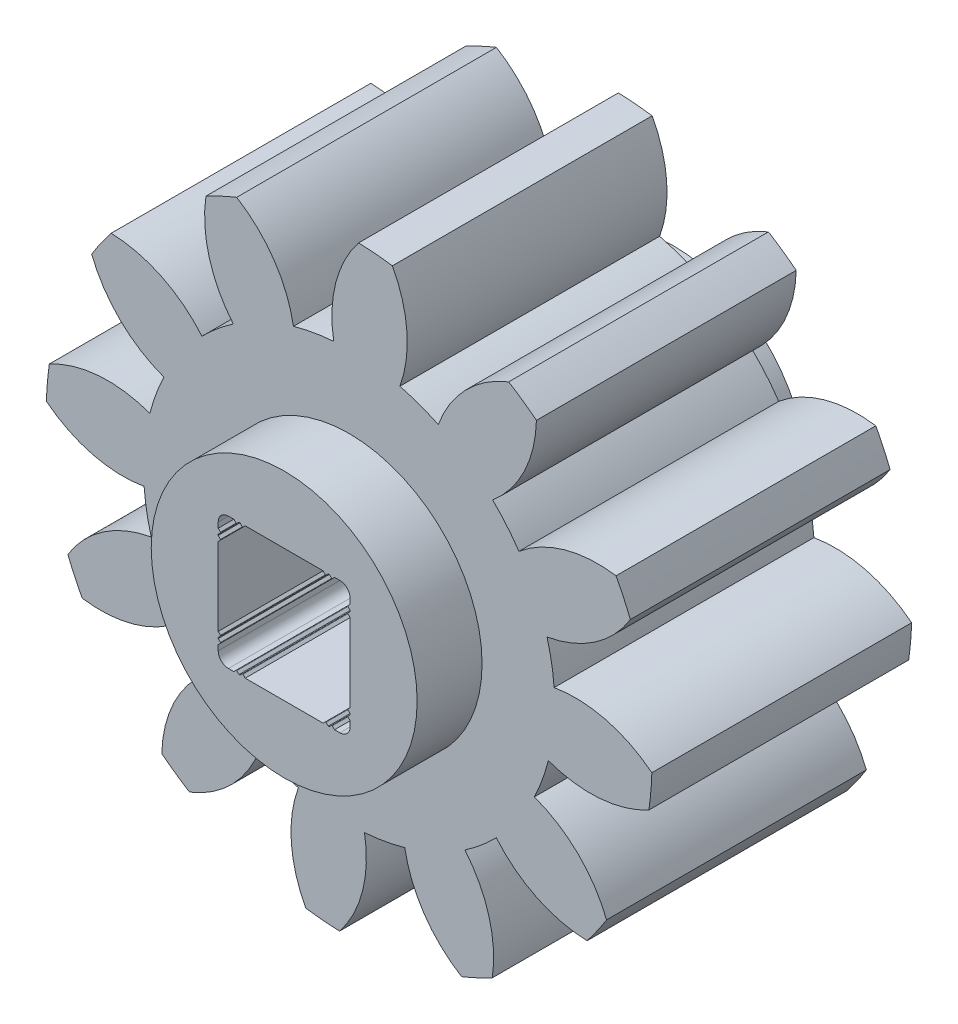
ISO-10303-21;
HEADER;
FILE_DESCRIPTION(('STEP AP214'),'2;1');
FILE_NAME('part.step','',(''),(''),'','','');
FILE_SCHEMA(('AUTOMOTIVE_DESIGN { 1 0 10303 214 1 1 1 1 }'));
ENDSEC;
DATA;
#1=APPLICATION_CONTEXT('core data for automotive mechanical design processes');
#2=APPLICATION_PROTOCOL_DEFINITION('international standard','automotive_design',2000,#1);
#3=PRODUCT_CONTEXT('',#1,'mechanical');
#4=PRODUCT('Part','Part','',(#3));
#5=PRODUCT_RELATED_PRODUCT_CATEGORY('part','',(#4));
#6=PRODUCT_DEFINITION_FORMATION('','',#4);
#7=PRODUCT_DEFINITION_CONTEXT('part definition',#1,'design');
#8=PRODUCT_DEFINITION('design','',#6,#7);
#9=PRODUCT_DEFINITION_SHAPE('','',#8);
#10=(LENGTH_UNIT() NAMED_UNIT(*) SI_UNIT(.MILLI.,.METRE.));
#11=(NAMED_UNIT(*) PLANE_ANGLE_UNIT() SI_UNIT($,.RADIAN.));
#12=(NAMED_UNIT(*) SI_UNIT($,.STERADIAN.) SOLID_ANGLE_UNIT());
#13=UNCERTAINTY_MEASURE_WITH_UNIT(LENGTH_MEASURE(1.E-05),#10,'distance_accuracy_value','');
#14=(GEOMETRIC_REPRESENTATION_CONTEXT(3) GLOBAL_UNCERTAINTY_ASSIGNED_CONTEXT((#13)) GLOBAL_UNIT_ASSIGNED_CONTEXT((#10,
#11,#12)) REPRESENTATION_CONTEXT('',''));
#15=CARTESIAN_POINT('',(0.,0.,0.));
#16=DIRECTION('',(0.,0.,1.));
#17=DIRECTION('',(1.,0.,0.));
#18=AXIS2_PLACEMENT_3D('',#15,#16,#17);
#19=CARTESIAN_POINT('',(-1.6125,1.6125,5.715));
#20=DIRECTION('',(-1.,0.,0.));
#21=DIRECTION('',(0.,0.,1.));
#22=AXIS2_PLACEMENT_3D('',#19,#20,#21);
#23=PLANE('',#22);
#24=DIRECTION('',(0.,1.,0.));
#25=VECTOR('',#24,1.);
#26=CARTESIAN_POINT('',(-1.6125,1.6125,-4.7625));
#27=LINE('',#26,#25);
#28=CARTESIAN_POINT('',(-1.6125,1.3625,-4.7625));
#29=VERTEX_POINT('',#28);
#30=CARTESIAN_POINT('',(-1.61250000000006,1.2314999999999,-4.7625));
#31=VERTEX_POINT('',#30);
#32=EDGE_CURVE('E479',#29,#31,#27,.F.);
#33=ORIENTED_EDGE('',*,*,#32,.F.);
#34=DIRECTION('',(0.,0.,-1.));
#35=VECTOR('',#34,1.);
#36=CARTESIAN_POINT('',(-1.6125,1.3625,4.991152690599));
#37=LINE('',#36,#35);
#38=CARTESIAN_POINT('',(-1.6125,1.3625,4.7625));
#39=VERTEX_POINT('',#38);
#40=EDGE_CURVE('E454',#29,#39,#37,.F.);
#41=ORIENTED_EDGE('',*,*,#40,.T.);
#42=DIRECTION('',(0.,1.,0.));
#43=VECTOR('',#42,1.);
#44=CARTESIAN_POINT('',(-1.6125,1.6125,4.7625));
#45=LINE('',#44,#43);
#46=CARTESIAN_POINT('',(-1.61250000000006,1.2314999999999,4.7625));
#47=VERTEX_POINT('',#46);
#48=EDGE_CURVE('E493',#47,#39,#45,.T.);
#49=ORIENTED_EDGE('',*,*,#48,.F.);
#50=DIRECTION('',(0.,0.,1.));
#51=VECTOR('',#50,1.);
#52=CARTESIAN_POINT('',(-1.61250000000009,1.2314999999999,-4.7625));
#53=LINE('',#52,#51);
#54=EDGE_CURVE('E486',#31,#47,#53,.T.);
#55=ORIENTED_EDGE('',*,*,#54,.F.);
#56=EDGE_LOOP('',(#33,#41,#49,#55));
#57=FACE_BOUND('',#56,.T.);
#58=ADVANCED_FACE('F18',(#57),#23,.F.);
#59=CARTESIAN_POINT('',(-1.6125,1.6125,5.715));
#60=DIRECTION('',(-1.,0.,0.));
#61=DIRECTION('',(0.,0.,1.));
#62=AXIS2_PLACEMENT_3D('',#59,#60,#61);
#63=PLANE('',#62);
#64=DIRECTION('',(0.,1.,0.));
#65=VECTOR('',#64,1.);
#66=CARTESIAN_POINT('',(-1.6125,1.6125,4.7625));
#67=LINE('',#66,#65);
#68=CARTESIAN_POINT('',(-1.6125,-1.3625,4.7625));
#69=VERTEX_POINT('',#68);
#70=CARTESIAN_POINT('',(-1.6125,-1.2315,4.7625));
#71=VERTEX_POINT('',#70);
#72=EDGE_CURVE('E455',#69,#71,#67,.T.);
#73=ORIENTED_EDGE('',*,*,#72,.F.);
#74=DIRECTION('',(0.,0.,-1.));
#75=VECTOR('',#74,1.);
#76=CARTESIAN_POINT('',(-1.6125,-1.3625,4.991152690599));
#77=LINE('',#76,#75);
#78=CARTESIAN_POINT('',(-1.6125,-1.3625,-4.7625));
#79=VERTEX_POINT('',#78);
#80=EDGE_CURVE('E500',#69,#79,#77,.T.);
#81=ORIENTED_EDGE('',*,*,#80,.T.);
#82=DIRECTION('',(0.,1.,0.));
#83=VECTOR('',#82,1.);
#84=CARTESIAN_POINT('',(-1.6125,1.6125,-4.7625));
#85=LINE('',#84,#83);
#86=CARTESIAN_POINT('',(-1.6125,-1.2315,-4.7625));
#87=VERTEX_POINT('',#86);
#88=EDGE_CURVE('E477',#87,#79,#85,.F.);
#89=ORIENTED_EDGE('',*,*,#88,.F.);
#90=DIRECTION('',(0.,0.,1.));
#91=VECTOR('',#90,1.);
#92=CARTESIAN_POINT('',(-1.6125,-1.2315,-4.7625));
#93=LINE('',#92,#91);
#94=EDGE_CURVE('E470',#71,#87,#93,.F.);
#95=ORIENTED_EDGE('',*,*,#94,.F.);
#96=EDGE_LOOP('',(#73,#81,#89,#95));
#97=FACE_BOUND('',#96,.T.);
#98=ADVANCED_FACE('F1840',(#97),#63,.F.);
#99=CARTESIAN_POINT('',(-1.3625,1.3625,4.991152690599));
#100=DIRECTION('',(0.,0.,-1.));
#101=DIRECTION('',(-1.,0.,0.));
#102=AXIS2_PLACEMENT_3D('',#99,#100,#101);
#103=CYLINDRICAL_SURFACE('',#102,0.25);
#104=CARTESIAN_POINT('',(-1.3625,1.3625,4.7625));
#105=DIRECTION('',(0.,0.,-1.));
#106=DIRECTION('',(-1.,0.,0.));
#107=AXIS2_PLACEMENT_3D('',#104,#105,#106);
#108=CIRCLE('',#107,0.25);
#109=CARTESIAN_POINT('',(-1.3625,1.6125,4.7625));
#110=VERTEX_POINT('',#109);
#111=EDGE_CURVE('E505',#39,#110,#108,.T.);
#112=ORIENTED_EDGE('',*,*,#111,.F.);
#113=ORIENTED_EDGE('',*,*,#40,.F.);
#114=CARTESIAN_POINT('',(-1.3625,1.3625,-4.7625));
#115=DIRECTION('',(0.,0.,-1.));
#116=DIRECTION('',(-1.,0.,0.));
#117=AXIS2_PLACEMENT_3D('',#114,#115,#116);
#118=CIRCLE('',#117,0.25);
#119=CARTESIAN_POINT('',(-1.3625,1.6125,-4.7625));
#120=VERTEX_POINT('',#119);
#121=EDGE_CURVE('E21',#120,#29,#118,.F.);
#122=ORIENTED_EDGE('',*,*,#121,.F.);
#123=DIRECTION('',(0.,0.,1.));
#124=VECTOR('',#123,1.);
#125=CARTESIAN_POINT('',(-1.3625,1.6125,5.715));
#126=LINE('',#125,#124);
#127=EDGE_CURVE('E444',#120,#110,#126,.T.);
#128=ORIENTED_EDGE('',*,*,#127,.T.);
#129=EDGE_LOOP('',(#112,#113,#122,#128));
#130=FACE_BOUND('',#129,.T.);
#131=ADVANCED_FACE('F451',(#130),#103,.F.);
#132=CARTESIAN_POINT('',(1.3625,1.3625,4.991152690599));
#133=DIRECTION('',(0.,0.,-1.));
#134=DIRECTION('',(-1.,0.,0.));
#135=AXIS2_PLACEMENT_3D('',#132,#133,#134);
#136=CYLINDRICAL_SURFACE('',#135,0.25);
#137=CARTESIAN_POINT('',(1.3625,1.3625,4.7625));
#138=DIRECTION('',(0.,0.,-1.));
#139=DIRECTION('',(-1.,0.,0.));
#140=AXIS2_PLACEMENT_3D('',#137,#138,#139);
#141=CIRCLE('',#140,0.25);
#142=CARTESIAN_POINT('',(1.3625,1.6125,4.7625));
#143=VERTEX_POINT('',#142);
#144=CARTESIAN_POINT('',(1.6125,1.3625,4.7625));
#145=VERTEX_POINT('',#144);
#146=EDGE_CURVE('E938',#143,#145,#141,.T.);
#147=ORIENTED_EDGE('',*,*,#146,.F.);
#148=DIRECTION('',(0.,0.,1.));
#149=VECTOR('',#148,1.);
#150=CARTESIAN_POINT('',(1.3625,1.6125,5.715));
#151=LINE('',#150,#149);
#152=CARTESIAN_POINT('',(1.3625,1.6125,-4.7625));
#153=VERTEX_POINT('',#152);
#154=EDGE_CURVE('E466',#143,#153,#151,.F.);
#155=ORIENTED_EDGE('',*,*,#154,.T.);
#156=CARTESIAN_POINT('',(1.3625,1.3625,-4.7625));
#157=DIRECTION('',(0.,0.,-1.));
#158=DIRECTION('',(-1.,0.,0.));
#159=AXIS2_PLACEMENT_3D('',#156,#157,#158);
#160=CIRCLE('',#159,0.25);
#161=CARTESIAN_POINT('',(1.6125,1.3625,-4.7625));
#162=VERTEX_POINT('',#161);
#163=EDGE_CURVE('E940',#162,#153,#160,.F.);
#164=ORIENTED_EDGE('',*,*,#163,.F.);
#165=DIRECTION('',(0.,0.,-1.));
#166=VECTOR('',#165,1.);
#167=CARTESIAN_POINT('',(1.6125,1.3625,5.715));
#168=LINE('',#167,#166);
#169=EDGE_CURVE('E1744',#162,#145,#168,.F.);
#170=ORIENTED_EDGE('',*,*,#169,.T.);
#171=EDGE_LOOP('',(#147,#155,#164,#170));
#172=FACE_BOUND('',#171,.T.);
#173=ADVANCED_FACE('F1808',(#172),#136,.F.);
#174=CARTESIAN_POINT('',(-1.3625,-1.3625,4.991152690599));
#175=DIRECTION('',(0.,0.,-1.));
#176=DIRECTION('',(-1.,0.,0.));
#177=AXIS2_PLACEMENT_3D('',#174,#175,#176);
#178=CYLINDRICAL_SURFACE('',#177,0.25);
#179=CARTESIAN_POINT('',(-1.3625,-1.3625,4.7625));
#180=DIRECTION('',(0.,0.,-1.));
#181=DIRECTION('',(-1.,0.,0.));
#182=AXIS2_PLACEMENT_3D('',#179,#180,#181);
#183=CIRCLE('',#182,0.25);
#184=CARTESIAN_POINT('',(-1.3625,-1.6125,4.7625));
#185=VERTEX_POINT('',#184);
#186=EDGE_CURVE('E504',#185,#69,#183,.T.);
#187=ORIENTED_EDGE('',*,*,#186,.F.);
#188=DIRECTION('',(0.,0.,-1.));
#189=VECTOR('',#188,1.);
#190=CARTESIAN_POINT('',(-1.3625,-1.6125,5.715));
#191=LINE('',#190,#189);
#192=CARTESIAN_POINT('',(-1.3625,-1.6125,-4.7625));
#193=VERTEX_POINT('',#192);
#194=EDGE_CURVE('E1730',#185,#193,#191,.T.);
#195=ORIENTED_EDGE('',*,*,#194,.T.);
#196=CARTESIAN_POINT('',(-1.3625,-1.3625,-4.7625));
#197=DIRECTION('',(0.,0.,-1.));
#198=DIRECTION('',(-1.,0.,0.));
#199=AXIS2_PLACEMENT_3D('',#196,#197,#198);
#200=CIRCLE('',#199,0.25);
#201=EDGE_CURVE('E936',#79,#193,#200,.F.);
#202=ORIENTED_EDGE('',*,*,#201,.F.);
#203=ORIENTED_EDGE('',*,*,#80,.F.);
#204=EDGE_LOOP('',(#187,#195,#202,#203));
#205=FACE_BOUND('',#204,.T.);
#206=ADVANCED_FACE('F2424',(#205),#178,.F.);
#207=CARTESIAN_POINT('',(1.3625,-1.3625,4.991152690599));
#208=DIRECTION('',(0.,0.,-1.));
#209=DIRECTION('',(-1.,0.,0.));
#210=AXIS2_PLACEMENT_3D('',#207,#208,#209);
#211=CYLINDRICAL_SURFACE('',#210,0.25);
#212=CARTESIAN_POINT('',(1.3625,-1.3625,4.7625));
#213=DIRECTION('',(0.,0.,-1.));
#214=DIRECTION('',(-1.,0.,0.));
#215=AXIS2_PLACEMENT_3D('',#212,#213,#214);
#216=CIRCLE('',#215,0.25);
#217=CARTESIAN_POINT('',(1.6125,-1.3625,4.7625));
#218=VERTEX_POINT('',#217);
#219=CARTESIAN_POINT('',(1.3625,-1.6125,4.7625));
#220=VERTEX_POINT('',#219);
#221=EDGE_CURVE('E932',#218,#220,#216,.T.);
#222=ORIENTED_EDGE('',*,*,#221,.F.);
#223=DIRECTION('',(0.,0.,-1.));
#224=VECTOR('',#223,1.);
#225=CARTESIAN_POINT('',(1.6125,-1.3625,5.715));
#226=LINE('',#225,#224);
#227=CARTESIAN_POINT('',(1.6125,-1.3625,-4.7625));
#228=VERTEX_POINT('',#227);
#229=EDGE_CURVE('E464',#218,#228,#226,.T.);
#230=ORIENTED_EDGE('',*,*,#229,.T.);
#231=CARTESIAN_POINT('',(1.3625,-1.3625,-4.7625));
#232=DIRECTION('',(0.,0.,-1.));
#233=DIRECTION('',(-1.,0.,0.));
#234=AXIS2_PLACEMENT_3D('',#231,#232,#233);
#235=CIRCLE('',#234,0.25);
#236=CARTESIAN_POINT('',(1.3625,-1.6125,-4.7625));
#237=VERTEX_POINT('',#236);
#238=EDGE_CURVE('E503',#237,#228,#235,.F.);
#239=ORIENTED_EDGE('',*,*,#238,.F.);
#240=DIRECTION('',(0.,0.,-1.));
#241=VECTOR('',#240,1.);
#242=CARTESIAN_POINT('',(1.3625,-1.6125,5.715));
#243=LINE('',#242,#241);
#244=EDGE_CURVE('E1714',#237,#220,#243,.F.);
#245=ORIENTED_EDGE('',*,*,#244,.T.);
#246=EDGE_LOOP('',(#222,#230,#239,#245));
#247=FACE_BOUND('',#246,.T.);
#248=ADVANCED_FACE('F2420',(#247),#211,.F.);
#249=CARTESIAN_POINT('',(-1.557829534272,1.177190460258,-4.7625));
#250=DIRECTION('',(0.704761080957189,0.709444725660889,0.));
#251=DIRECTION('',(-0.709444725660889,0.704761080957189,0.));
#252=AXIS2_PLACEMENT_3D('',#249,#250,#251);
#253=PLANE('',#252);
#254=DIRECTION('',(-0.709444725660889,0.704761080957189,0.));
#255=VECTOR('',#254,1.);
#256=CARTESIAN_POINT('',(-1.557829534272,1.177190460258,4.7625));
#257=LINE('',#256,#255);
#258=CARTESIAN_POINT('',(-1.55782953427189,1.17719046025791,4.7625));
#259=VERTEX_POINT('',#258);
#260=EDGE_CURVE('E489',#47,#259,#257,.F.);
#261=ORIENTED_EDGE('',*,*,#260,.T.);
#262=DIRECTION('',(0.,0.,1.));
#263=VECTOR('',#262,1.);
#264=CARTESIAN_POINT('',(-1.55782953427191,1.17719046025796,-4.7625));
#265=LINE('',#264,#263);
#266=CARTESIAN_POINT('',(-1.55782953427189,1.17719046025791,-4.7625));
#267=VERTEX_POINT('',#266);
#268=EDGE_CURVE('E1721',#267,#259,#265,.T.);
#269=ORIENTED_EDGE('',*,*,#268,.F.);
#270=DIRECTION('',(-0.709444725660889,0.704761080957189,0.));
#271=VECTOR('',#270,1.);
#272=CARTESIAN_POINT('',(-1.557829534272,1.177190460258,-4.7625));
#273=LINE('',#272,#271);
#274=EDGE_CURVE('E490',#267,#31,#273,.T.);
#275=ORIENTED_EDGE('',*,*,#274,.T.);
#276=ORIENTED_EDGE('',*,*,#54,.T.);
#277=EDGE_LOOP('',(#261,#269,#275,#276));
#278=FACE_BOUND('',#277,.T.);
#279=ADVANCED_FACE('F2417',(#278),#253,.T.);
#280=CARTESIAN_POINT('',(-1.6125,-1.2315,-4.7625));
#281=DIRECTION('',(0.705936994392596,-0.708274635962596,0.));
#282=DIRECTION('',(0.708274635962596,0.705936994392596,0.));
#283=AXIS2_PLACEMENT_3D('',#280,#281,#282);
#284=PLANE('',#283);
#285=DIRECTION('',(0.708274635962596,0.705936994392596,0.));
#286=VECTOR('',#285,1.);
#287=CARTESIAN_POINT('',(-1.6125,-1.2315,-4.7625));
#288=LINE('',#287,#286);
#289=CARTESIAN_POINT('',(-1.55781460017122,-1.17699508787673,-4.7625));
#290=VERTEX_POINT('',#289);
#291=EDGE_CURVE('E473',#87,#290,#288,.T.);
#292=ORIENTED_EDGE('',*,*,#291,.T.);
#293=DIRECTION('',(0.,0.,1.));
#294=VECTOR('',#293,1.);
#295=CARTESIAN_POINT('',(-1.55781460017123,-1.17699508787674,-4.7625));
#296=LINE('',#295,#294);
#297=CARTESIAN_POINT('',(-1.55781460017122,-1.17699508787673,4.7625));
#298=VERTEX_POINT('',#297);
#299=EDGE_CURVE('E1705',#298,#290,#296,.F.);
#300=ORIENTED_EDGE('',*,*,#299,.F.);
#301=DIRECTION('',(0.708274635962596,0.705936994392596,0.));
#302=VECTOR('',#301,1.);
#303=CARTESIAN_POINT('',(-1.6125,-1.2315,4.7625));
#304=LINE('',#303,#302);
#305=EDGE_CURVE('E474',#298,#71,#304,.F.);
#306=ORIENTED_EDGE('',*,*,#305,.T.);
#307=ORIENTED_EDGE('',*,*,#94,.T.);
#308=EDGE_LOOP('',(#292,#300,#306,#307));
#309=FACE_BOUND('',#308,.T.);
#310=ADVANCED_FACE('F1845',(#309),#284,.T.);
#311=CARTESIAN_POINT('',(1.6125,1.6125,5.715));
#312=DIRECTION('',(0.,1.,0.));
#313=DIRECTION('',(0.,0.,1.));
#314=AXIS2_PLACEMENT_3D('',#311,#312,#313);
#315=PLANE('',#314);
#316=DIRECTION('',(1.,0.,0.));
#317=VECTOR('',#316,1.);
#318=CARTESIAN_POINT('',(1.6125,1.6125,-4.7625));
#319=LINE('',#318,#317);
#320=CARTESIAN_POINT('',(1.23150000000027,1.61249999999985,-4.7625));
#321=VERTEX_POINT('',#320);
#322=EDGE_CURVE('E445',#153,#321,#319,.F.);
#323=ORIENTED_EDGE('',*,*,#322,.F.);
#324=ORIENTED_EDGE('',*,*,#154,.F.);
#325=DIRECTION('',(1.,0.,0.));
#326=VECTOR('',#325,1.);
#327=CARTESIAN_POINT('',(1.6125,1.6125,4.7625));
#328=LINE('',#327,#326);
#329=CARTESIAN_POINT('',(1.23150000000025,1.61249999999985,4.7625));
#330=VERTEX_POINT('',#329);
#331=EDGE_CURVE('E469',#330,#143,#328,.T.);
#332=ORIENTED_EDGE('',*,*,#331,.F.);
#333=DIRECTION('',(0.,0.,1.));
#334=VECTOR('',#333,1.);
#335=CARTESIAN_POINT('',(1.23150000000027,1.61249999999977,-4.7625));
#336=LINE('',#335,#334);
#337=EDGE_CURVE('E1699',#321,#330,#336,.T.);
#338=ORIENTED_EDGE('',*,*,#337,.F.);
#339=EDGE_LOOP('',(#323,#324,#332,#338));
#340=FACE_BOUND('',#339,.T.);
#341=ADVANCED_FACE('F1986',(#340),#315,.F.);
#342=CARTESIAN_POINT('',(1.6125,1.6125,5.715));
#343=DIRECTION('',(0.,1.,0.));
#344=DIRECTION('',(0.,0.,1.));
#345=AXIS2_PLACEMENT_3D('',#342,#343,#344);
#346=PLANE('',#345);
#347=DIRECTION('',(1.,0.,0.));
#348=VECTOR('',#347,1.);
#349=CARTESIAN_POINT('',(1.6125,1.6125,4.7625));
#350=LINE('',#349,#348);
#351=CARTESIAN_POINT('',(-1.2315,1.6125,4.7625));
#352=VERTEX_POINT('',#351);
#353=EDGE_CURVE('E458',#110,#352,#350,.T.);
#354=ORIENTED_EDGE('',*,*,#353,.F.);
#355=ORIENTED_EDGE('',*,*,#127,.F.);
#356=DIRECTION('',(1.,0.,0.));
#357=VECTOR('',#356,1.);
#358=CARTESIAN_POINT('',(1.6125,1.6125,-4.7625));
#359=LINE('',#358,#357);
#360=CARTESIAN_POINT('',(-1.2315,1.6125,-4.7625));
#361=VERTEX_POINT('',#360);
#362=EDGE_CURVE('E431',#361,#120,#359,.F.);
#363=ORIENTED_EDGE('',*,*,#362,.F.);
#364=DIRECTION('',(0.,0.,1.));
#365=VECTOR('',#364,1.);
#366=CARTESIAN_POINT('',(-1.2315,1.6125,-4.7625));
#367=LINE('',#366,#365);
#368=EDGE_CURVE('E1689',#352,#361,#367,.F.);
#369=ORIENTED_EDGE('',*,*,#368,.F.);
#370=EDGE_LOOP('',(#354,#355,#363,#369));
#371=FACE_BOUND('',#370,.T.);
#372=ADVANCED_FACE('F456',(#371),#346,.F.);
#373=CARTESIAN_POINT('',(1.6125,-1.6125,5.715));
#374=DIRECTION('',(1.,0.,0.));
#375=DIRECTION('',(0.,0.,-1.));
#376=AXIS2_PLACEMENT_3D('',#373,#374,#375);
#377=PLANE('',#376);
#378=DIRECTION('',(0.,1.,0.));
#379=VECTOR('',#378,1.);
#380=CARTESIAN_POINT('',(1.6125,-1.6125,-4.7625));
#381=LINE('',#380,#379);
#382=CARTESIAN_POINT('',(1.61250000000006,-1.2314999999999,-4.7625));
#383=VERTEX_POINT('',#382);
#384=EDGE_CURVE('E1745',#228,#383,#381,.T.);
#385=ORIENTED_EDGE('',*,*,#384,.F.);
#386=ORIENTED_EDGE('',*,*,#229,.F.);
#387=DIRECTION('',(0.,1.,0.));
#388=VECTOR('',#387,1.);
#389=CARTESIAN_POINT('',(1.6125,-1.6125,4.7625));
#390=LINE('',#389,#388);
#391=CARTESIAN_POINT('',(1.61250000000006,-1.2314999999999,4.7625));
#392=VERTEX_POINT('',#391);
#393=EDGE_CURVE('E460',#392,#218,#390,.F.);
#394=ORIENTED_EDGE('',*,*,#393,.F.);
#395=DIRECTION('',(0.,0.,1.));
#396=VECTOR('',#395,1.);
#397=CARTESIAN_POINT('',(1.61250000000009,-1.2314999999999,-4.7625));
#398=LINE('',#397,#396);
#399=EDGE_CURVE('E1676',#383,#392,#398,.T.);
#400=ORIENTED_EDGE('',*,*,#399,.F.);
#401=EDGE_LOOP('',(#385,#386,#394,#400));
#402=FACE_BOUND('',#401,.T.);
#403=ADVANCED_FACE('F2407',(#402),#377,.F.);
#404=CARTESIAN_POINT('',(1.6125,-1.6125,5.715));
#405=DIRECTION('',(1.,0.,0.));
#406=DIRECTION('',(0.,0.,-1.));
#407=AXIS2_PLACEMENT_3D('',#404,#405,#406);
#408=PLANE('',#407);
#409=DIRECTION('',(0.,1.,0.));
#410=VECTOR('',#409,1.);
#411=CARTESIAN_POINT('',(1.6125,-1.6125,4.7625));
#412=LINE('',#411,#410);
#413=CARTESIAN_POINT('',(1.6125,1.2315,4.7625));
#414=VERTEX_POINT('',#413);
#415=EDGE_CURVE('E1731',#145,#414,#412,.F.);
#416=ORIENTED_EDGE('',*,*,#415,.F.);
#417=ORIENTED_EDGE('',*,*,#169,.F.);
#418=DIRECTION('',(0.,1.,0.));
#419=VECTOR('',#418,1.);
#420=CARTESIAN_POINT('',(1.6125,-1.6125,-4.7625));
#421=LINE('',#420,#419);
#422=CARTESIAN_POINT('',(1.6125,1.2315,-4.7625));
#423=VERTEX_POINT('',#422);
#424=EDGE_CURVE('E1742',#423,#162,#421,.T.);
#425=ORIENTED_EDGE('',*,*,#424,.F.);
#426=DIRECTION('',(0.,0.,1.));
#427=VECTOR('',#426,1.);
#428=CARTESIAN_POINT('',(1.6125,1.2315,-4.7625));
#429=LINE('',#428,#427);
#430=EDGE_CURVE('E1666',#414,#423,#429,.F.);
#431=ORIENTED_EDGE('',*,*,#430,.F.);
#432=EDGE_LOOP('',(#416,#417,#425,#431));
#433=FACE_BOUND('',#432,.T.);
#434=ADVANCED_FACE('F1813',(#433),#408,.F.);
#435=CARTESIAN_POINT('',(-1.6125,-1.6125,5.715));
#436=DIRECTION('',(0.,-1.,0.));
#437=DIRECTION('',(0.,0.,-1.));
#438=AXIS2_PLACEMENT_3D('',#435,#436,#437);
#439=PLANE('',#438);
#440=DIRECTION('',(1.,0.,0.));
#441=VECTOR('',#440,1.);
#442=CARTESIAN_POINT('',(-1.6125,-1.6125,-4.7625));
#443=LINE('',#442,#441);
#444=CARTESIAN_POINT('',(-1.23150000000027,-1.61249999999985,-4.7625));
#445=VERTEX_POINT('',#444);
#446=EDGE_CURVE('E1715',#193,#445,#443,.T.);
#447=ORIENTED_EDGE('',*,*,#446,.F.);
#448=ORIENTED_EDGE('',*,*,#194,.F.);
#449=DIRECTION('',(1.,0.,0.));
#450=VECTOR('',#449,1.);
#451=CARTESIAN_POINT('',(-1.6125,-1.6125,4.7625));
#452=LINE('',#451,#450);
#453=CARTESIAN_POINT('',(-1.23150000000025,-1.61249999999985,4.7625));
#454=VERTEX_POINT('',#453);
#455=EDGE_CURVE('E1728',#454,#185,#452,.F.);
#456=ORIENTED_EDGE('',*,*,#455,.F.);
#457=DIRECTION('',(0.,0.,1.));
#458=VECTOR('',#457,1.);
#459=CARTESIAN_POINT('',(-1.23150000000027,-1.61249999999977,-4.7625));
#460=LINE('',#459,#458);
#461=EDGE_CURVE('E1652',#445,#454,#460,.T.);
#462=ORIENTED_EDGE('',*,*,#461,.F.);
#463=EDGE_LOOP('',(#447,#448,#456,#462));
#464=FACE_BOUND('',#463,.T.);
#465=ADVANCED_FACE('F1918',(#464),#439,.F.);
#466=CARTESIAN_POINT('',(-1.6125,-1.6125,5.715));
#467=DIRECTION('',(0.,-1.,0.));
#468=DIRECTION('',(0.,0.,-1.));
#469=AXIS2_PLACEMENT_3D('',#466,#467,#468);
#470=PLANE('',#469);
#471=DIRECTION('',(1.,0.,0.));
#472=VECTOR('',#471,1.);
#473=CARTESIAN_POINT('',(-1.6125,-1.6125,4.7625));
#474=LINE('',#473,#472);
#475=CARTESIAN_POINT('',(1.2315,-1.6125,4.7625));
#476=VERTEX_POINT('',#475);
#477=EDGE_CURVE('E1718',#220,#476,#474,.F.);
#478=ORIENTED_EDGE('',*,*,#477,.F.);
#479=ORIENTED_EDGE('',*,*,#244,.F.);
#480=DIRECTION('',(1.,0.,0.));
#481=VECTOR('',#480,1.);
#482=CARTESIAN_POINT('',(-1.6125,-1.6125,-4.7625));
#483=LINE('',#482,#481);
#484=CARTESIAN_POINT('',(1.2315,-1.6125,-4.7625));
#485=VERTEX_POINT('',#484);
#486=EDGE_CURVE('E1712',#485,#237,#483,.T.);
#487=ORIENTED_EDGE('',*,*,#486,.F.);
#488=DIRECTION('',(0.,0.,1.));
#489=VECTOR('',#488,1.);
#490=CARTESIAN_POINT('',(1.2315,-1.6125,-4.7625));
#491=LINE('',#490,#489);
#492=EDGE_CURVE('E1642',#476,#485,#491,.F.);
#493=ORIENTED_EDGE('',*,*,#492,.F.);
#494=EDGE_LOOP('',(#478,#479,#487,#493));
#495=FACE_BOUND('',#494,.T.);
#496=ADVANCED_FACE('F2396',(#495),#470,.F.);
#497=CARTESIAN_POINT('',(1.176995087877,1.557814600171,-4.7625));
#498=DIRECTION('',(0.708274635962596,-0.705936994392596,0.));
#499=DIRECTION('',(0.705936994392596,0.708274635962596,0.));
#500=AXIS2_PLACEMENT_3D('',#497,#498,#499);
#501=PLANE('',#500);
#502=DIRECTION('',(0.705936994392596,0.708274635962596,0.));
#503=VECTOR('',#502,1.);
#504=CARTESIAN_POINT('',(1.176995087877,1.557814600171,4.7625));
#505=LINE('',#504,#503);
#506=CARTESIAN_POINT('',(1.17699508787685,1.5578146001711,4.7625));
#507=VERTEX_POINT('',#506);
#508=EDGE_CURVE('E1690',#330,#507,#505,.F.);
#509=ORIENTED_EDGE('',*,*,#508,.T.);
#510=DIRECTION('',(0.,0.,1.));
#511=VECTOR('',#510,1.);
#512=CARTESIAN_POINT('',(1.17699508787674,1.55781460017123,-4.7625));
#513=LINE('',#512,#511);
#514=CARTESIAN_POINT('',(1.17699508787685,1.5578146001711,-4.7625));
#515=VERTEX_POINT('',#514);
#516=EDGE_CURVE('E917',#515,#507,#513,.T.);
#517=ORIENTED_EDGE('',*,*,#516,.F.);
#518=DIRECTION('',(0.705936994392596,0.708274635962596,0.));
#519=VECTOR('',#518,1.);
#520=CARTESIAN_POINT('',(1.176995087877,1.557814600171,-4.7625));
#521=LINE('',#520,#519);
#522=EDGE_CURVE('E1702',#515,#321,#521,.T.);
#523=ORIENTED_EDGE('',*,*,#522,.T.);
#524=ORIENTED_EDGE('',*,*,#337,.T.);
#525=EDGE_LOOP('',(#509,#517,#523,#524));
#526=FACE_BOUND('',#525,.T.);
#527=ADVANCED_FACE('F1982',(#526),#501,.T.);
#528=CARTESIAN_POINT('',(-1.2315,1.6125,-4.7625));
#529=DIRECTION('',(-0.707106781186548,-0.707106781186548,0.));
#530=DIRECTION('',(0.707106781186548,-0.707106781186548,0.));
#531=AXIS2_PLACEMENT_3D('',#528,#529,#530);
#532=PLANE('',#531);
#533=DIRECTION('',(0.707106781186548,-0.707106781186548,0.));
#534=VECTOR('',#533,1.);
#535=CARTESIAN_POINT('',(-1.2315,1.6125,-4.7625));
#536=LINE('',#535,#534);
#537=CARTESIAN_POINT('',(-1.17667210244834,1.55767210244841,-4.7625));
#538=VERTEX_POINT('',#537);
#539=EDGE_CURVE('E439',#361,#538,#536,.T.);
#540=ORIENTED_EDGE('',*,*,#539,.T.);
#541=DIRECTION('',(0.,0.,1.));
#542=VECTOR('',#541,1.);
#543=CARTESIAN_POINT('',(-1.17667210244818,1.55767210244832,-4.7625));
#544=LINE('',#543,#542);
#545=CARTESIAN_POINT('',(-1.17667210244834,1.55767210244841,4.7625));
#546=VERTEX_POINT('',#545);
#547=EDGE_CURVE('E913',#546,#538,#544,.F.);
#548=ORIENTED_EDGE('',*,*,#547,.F.);
#549=DIRECTION('',(0.707106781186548,-0.707106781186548,0.));
#550=VECTOR('',#549,1.);
#551=CARTESIAN_POINT('',(-1.2315,1.6125,4.7625));
#552=LINE('',#551,#550);
#553=EDGE_CURVE('E1686',#546,#352,#552,.F.);
#554=ORIENTED_EDGE('',*,*,#553,.T.);
#555=ORIENTED_EDGE('',*,*,#368,.T.);
#556=EDGE_LOOP('',(#540,#548,#554,#555));
#557=FACE_BOUND('',#556,.T.);
#558=ADVANCED_FACE('F2386',(#557),#532,.T.);
#559=CARTESIAN_POINT('',(1.557829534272,-1.177190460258,-4.7625));
#560=DIRECTION('',(-0.704761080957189,-0.709444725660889,0.));
#561=DIRECTION('',(0.709444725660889,-0.704761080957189,0.));
#562=AXIS2_PLACEMENT_3D('',#559,#560,#561);
#563=PLANE('',#562);
#564=DIRECTION('',(0.709444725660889,-0.704761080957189,0.));
#565=VECTOR('',#564,1.);
#566=CARTESIAN_POINT('',(1.557829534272,-1.177190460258,4.7625));
#567=LINE('',#566,#565);
#568=CARTESIAN_POINT('',(1.55782953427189,-1.17719046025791,4.7625));
#569=VERTEX_POINT('',#568);
#570=EDGE_CURVE('E1667',#392,#569,#567,.F.);
#571=ORIENTED_EDGE('',*,*,#570,.T.);
#572=DIRECTION('',(0.,0.,1.));
#573=VECTOR('',#572,1.);
#574=CARTESIAN_POINT('',(1.55782953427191,-1.17719046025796,-4.7625));
#575=LINE('',#574,#573);
#576=CARTESIAN_POINT('',(1.55782953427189,-1.17719046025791,-4.7625));
#577=VERTEX_POINT('',#576);
#578=EDGE_CURVE('E903',#577,#569,#575,.T.);
#579=ORIENTED_EDGE('',*,*,#578,.F.);
#580=DIRECTION('',(0.709444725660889,-0.704761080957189,0.));
#581=VECTOR('',#580,1.);
#582=CARTESIAN_POINT('',(1.557829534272,-1.177190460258,-4.7625));
#583=LINE('',#582,#581);
#584=EDGE_CURVE('E1679',#577,#383,#583,.T.);
#585=ORIENTED_EDGE('',*,*,#584,.T.);
#586=ORIENTED_EDGE('',*,*,#399,.T.);
#587=EDGE_LOOP('',(#571,#579,#585,#586));
#588=FACE_BOUND('',#587,.T.);
#589=ADVANCED_FACE('F2388',(#588),#563,.T.);
#590=CARTESIAN_POINT('',(1.6125,1.2315,-4.7625));
#591=DIRECTION('',(-0.705936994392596,0.708274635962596,0.));
#592=DIRECTION('',(-0.708274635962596,-0.705936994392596,0.));
#593=AXIS2_PLACEMENT_3D('',#590,#591,#592);
#594=PLANE('',#593);
#595=DIRECTION('',(-0.708274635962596,-0.705936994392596,0.));
#596=VECTOR('',#595,1.);
#597=CARTESIAN_POINT('',(1.6125,1.2315,-4.7625));
#598=LINE('',#597,#596);
#599=CARTESIAN_POINT('',(1.55781460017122,1.17699508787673,-4.7625));
#600=VERTEX_POINT('',#599);
#601=EDGE_CURVE('E1658',#423,#600,#598,.T.);
#602=ORIENTED_EDGE('',*,*,#601,.T.);
#603=DIRECTION('',(0.,0.,1.));
#604=VECTOR('',#603,1.);
#605=CARTESIAN_POINT('',(1.55781460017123,1.17699508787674,-4.7625));
#606=LINE('',#605,#604);
#607=CARTESIAN_POINT('',(1.55781460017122,1.17699508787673,4.7625));
#608=VERTEX_POINT('',#607);
#609=EDGE_CURVE('E899',#608,#600,#606,.F.);
#610=ORIENTED_EDGE('',*,*,#609,.F.);
#611=DIRECTION('',(-0.708274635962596,-0.705936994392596,0.));
#612=VECTOR('',#611,1.);
#613=CARTESIAN_POINT('',(1.6125,1.2315,4.7625));
#614=LINE('',#613,#612);
#615=EDGE_CURVE('E1663',#608,#414,#614,.F.);
#616=ORIENTED_EDGE('',*,*,#615,.T.);
#617=ORIENTED_EDGE('',*,*,#430,.T.);
#618=EDGE_LOOP('',(#602,#610,#616,#617));
#619=FACE_BOUND('',#618,.T.);
#620=ADVANCED_FACE('F1990',(#619),#594,.T.);
#621=CARTESIAN_POINT('',(-1.176995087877,-1.557814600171,-4.7625));
#622=DIRECTION('',(-0.708274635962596,0.705936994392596,0.));
#623=DIRECTION('',(-0.705936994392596,-0.708274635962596,0.));
#624=AXIS2_PLACEMENT_3D('',#621,#622,#623);
#625=PLANE('',#624);
#626=DIRECTION('',(-0.705936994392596,-0.708274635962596,0.));
#627=VECTOR('',#626,1.);
#628=CARTESIAN_POINT('',(-1.176995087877,-1.557814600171,4.7625));
#629=LINE('',#628,#627);
#630=CARTESIAN_POINT('',(-1.17699508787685,-1.5578146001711,4.7625));
#631=VERTEX_POINT('',#630);
#632=EDGE_CURVE('E1643',#454,#631,#629,.F.);
#633=ORIENTED_EDGE('',*,*,#632,.T.);
#634=DIRECTION('',(0.,0.,1.));
#635=VECTOR('',#634,1.);
#636=CARTESIAN_POINT('',(-1.17699508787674,-1.55781460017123,-4.7625));
#637=LINE('',#636,#635);
#638=CARTESIAN_POINT('',(-1.17699508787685,-1.5578146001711,-4.7625));
#639=VERTEX_POINT('',#638);
#640=EDGE_CURVE('E889',#639,#631,#637,.T.);
#641=ORIENTED_EDGE('',*,*,#640,.F.);
#642=DIRECTION('',(-0.705936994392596,-0.708274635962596,0.));
#643=VECTOR('',#642,1.);
#644=CARTESIAN_POINT('',(-1.176995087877,-1.557814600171,-4.7625));
#645=LINE('',#644,#643);
#646=EDGE_CURVE('E1655',#639,#445,#645,.T.);
#647=ORIENTED_EDGE('',*,*,#646,.T.);
#648=ORIENTED_EDGE('',*,*,#461,.T.);
#649=EDGE_LOOP('',(#633,#641,#647,#648));
#650=FACE_BOUND('',#649,.T.);
#651=ADVANCED_FACE('F1923',(#650),#625,.T.);
#652=CARTESIAN_POINT('',(1.2315,-1.6125,-4.7625));
#653=DIRECTION('',(0.707106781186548,0.707106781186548,0.));
#654=DIRECTION('',(-0.707106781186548,0.707106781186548,0.));
#655=AXIS2_PLACEMENT_3D('',#652,#653,#654);
#656=PLANE('',#655);
#657=DIRECTION('',(-0.707106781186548,0.707106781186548,0.));
#658=VECTOR('',#657,1.);
#659=CARTESIAN_POINT('',(1.2315,-1.6125,-4.7625));
#660=LINE('',#659,#658);
#661=CARTESIAN_POINT('',(1.17667210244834,-1.55767210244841,-4.7625));
#662=VERTEX_POINT('',#661);
#663=EDGE_CURVE('E931',#485,#662,#660,.T.);
#664=ORIENTED_EDGE('',*,*,#663,.T.);
#665=DIRECTION('',(0.,0.,1.));
#666=VECTOR('',#665,1.);
#667=CARTESIAN_POINT('',(1.17667210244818,-1.55767210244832,-4.7625));
#668=LINE('',#667,#666);
#669=CARTESIAN_POINT('',(1.17667210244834,-1.55767210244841,4.7625));
#670=VERTEX_POINT('',#669);
#671=EDGE_CURVE('E885',#670,#662,#668,.F.);
#672=ORIENTED_EDGE('',*,*,#671,.F.);
#673=DIRECTION('',(-0.707106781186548,0.707106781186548,0.));
#674=VECTOR('',#673,1.);
#675=CARTESIAN_POINT('',(1.2315,-1.6125,4.7625));
#676=LINE('',#675,#674);
#677=EDGE_CURVE('E1639',#670,#476,#676,.F.);
#678=ORIENTED_EDGE('',*,*,#677,.T.);
#679=ORIENTED_EDGE('',*,*,#492,.T.);
#680=EDGE_LOOP('',(#664,#672,#678,#679));
#681=FACE_BOUND('',#680,.T.);
#682=ADVANCED_FACE('F2554',(#681),#656,.T.);
#683=CARTESIAN_POINT('',(-1.56678,1.168180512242,-4.7625));
#684=DIRECTION('',(0.,0.,1.));
#685=DIRECTION('',(1.,0.,0.));
#686=AXIS2_PLACEMENT_3D('',#683,#684,#685);
#687=CYLINDRICAL_SURFACE('',#686,0.0127);
#688=CARTESIAN_POINT('',(-1.56678,1.168180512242,4.7625));
#689=DIRECTION('',(0.,0.,1.));
#690=DIRECTION('',(1.,0.,0.));
#691=AXIS2_PLACEMENT_3D('',#688,#689,#690);
#692=CIRCLE('',#691,0.0127);
#693=CARTESIAN_POINT('',(-1.557799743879,1.159200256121,4.7625));
#694=VERTEX_POINT('',#693);
#695=EDGE_CURVE('E926',#259,#694,#692,.F.);
#696=ORIENTED_EDGE('',*,*,#695,.T.);
#697=DIRECTION('',(0.,0.,1.));
#698=VECTOR('',#697,1.);
#699=CARTESIAN_POINT('',(-1.557799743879,1.159200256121,-4.7625));
#700=LINE('',#699,#698);
#701=CARTESIAN_POINT('',(-1.557799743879,1.159200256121,-4.7625));
#702=VERTEX_POINT('',#701);
#703=EDGE_CURVE('E1597',#702,#694,#700,.T.);
#704=ORIENTED_EDGE('',*,*,#703,.F.);
#705=CARTESIAN_POINT('',(-1.56678,1.168180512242,-4.7625));
#706=DIRECTION('',(0.,0.,1.));
#707=DIRECTION('',(1.,0.,0.));
#708=AXIS2_PLACEMENT_3D('',#705,#706,#707);
#709=CIRCLE('',#708,0.0127);
#710=EDGE_CURVE('E929',#702,#267,#709,.T.);
#711=ORIENTED_EDGE('',*,*,#710,.T.);
#712=ORIENTED_EDGE('',*,*,#268,.T.);
#713=EDGE_LOOP('',(#696,#704,#711,#712));
#714=FACE_BOUND('',#713,.T.);
#715=ADVANCED_FACE('F2563',(#714),#687,.T.);
#716=CARTESIAN_POINT('',(-1.56678,-1.168,-4.7625));
#717=DIRECTION('',(0.,0.,1.));
#718=DIRECTION('',(1.,0.,0.));
#719=AXIS2_PLACEMENT_3D('',#716,#717,#718);
#720=CYLINDRICAL_SURFACE('',#719,0.0127);
#721=DIRECTION('',(0.,0.,1.));
#722=VECTOR('',#721,1.);
#723=CARTESIAN_POINT('',(-1.55781460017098,-1.15900491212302,-4.7625));
#724=LINE('',#723,#722);
#725=CARTESIAN_POINT('',(-1.55781460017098,-1.15900491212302,4.7625));
#726=VERTEX_POINT('',#725);
#727=CARTESIAN_POINT('',(-1.55781460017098,-1.15900491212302,-4.7625));
#728=VERTEX_POINT('',#727);
#729=EDGE_CURVE('E1590',#726,#728,#724,.F.);
#730=ORIENTED_EDGE('',*,*,#729,.F.);
#731=CARTESIAN_POINT('',(-1.56678,-1.168,4.7625));
#732=DIRECTION('',(0.,0.,1.));
#733=DIRECTION('',(1.,0.,0.));
#734=AXIS2_PLACEMENT_3D('',#731,#732,#733);
#735=CIRCLE('',#734,0.0127);
#736=EDGE_CURVE('E921',#726,#298,#735,.F.);
#737=ORIENTED_EDGE('',*,*,#736,.T.);
#738=ORIENTED_EDGE('',*,*,#299,.T.);
#739=CARTESIAN_POINT('',(-1.56678,-1.168,-4.7625));
#740=DIRECTION('',(0.,0.,1.));
#741=DIRECTION('',(1.,0.,0.));
#742=AXIS2_PLACEMENT_3D('',#739,#740,#741);
#743=CIRCLE('',#742,0.0127);
#744=EDGE_CURVE('E923',#290,#728,#743,.T.);
#745=ORIENTED_EDGE('',*,*,#744,.T.);
#746=EDGE_LOOP('',(#730,#737,#738,#745));
#747=FACE_BOUND('',#746,.T.);
#748=ADVANCED_FACE('F1850',(#747),#720,.T.);
#749=CARTESIAN_POINT('',(1.168,1.56678,-4.7625));
#750=DIRECTION('',(0.,0.,1.));
#751=DIRECTION('',(1.,0.,0.));
#752=AXIS2_PLACEMENT_3D('',#749,#750,#751);
#753=CYLINDRICAL_SURFACE('',#752,0.0127);
#754=ORIENTED_EDGE('',*,*,#516,.T.);
#755=CARTESIAN_POINT('',(1.168,1.56678,4.7625));
#756=DIRECTION('',(0.,0.,1.));
#757=DIRECTION('',(1.,0.,0.));
#758=AXIS2_PLACEMENT_3D('',#755,#756,#757);
#759=CIRCLE('',#758,0.0127);
#760=CARTESIAN_POINT('',(1.15900491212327,1.55781460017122,4.7625));
#761=VERTEX_POINT('',#760);
#762=EDGE_CURVE('E914',#507,#761,#759,.F.);
#763=ORIENTED_EDGE('',*,*,#762,.T.);
#764=DIRECTION('',(0.,0.,1.));
#765=VECTOR('',#764,1.);
#766=CARTESIAN_POINT('',(1.15900491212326,1.55781460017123,-4.7625));
#767=LINE('',#766,#765);
#768=CARTESIAN_POINT('',(1.15900491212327,1.55781460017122,-4.7625));
#769=VERTEX_POINT('',#768);
#770=EDGE_CURVE('E1567',#769,#761,#767,.T.);
#771=ORIENTED_EDGE('',*,*,#770,.F.);
#772=CARTESIAN_POINT('',(1.168,1.56678,-4.7625));
#773=DIRECTION('',(0.,0.,1.));
#774=DIRECTION('',(1.,0.,0.));
#775=AXIS2_PLACEMENT_3D('',#772,#773,#774);
#776=CIRCLE('',#775,0.0127);
#777=EDGE_CURVE('E918',#769,#515,#776,.T.);
#778=ORIENTED_EDGE('',*,*,#777,.T.);
#779=EDGE_LOOP('',(#754,#763,#771,#778));
#780=FACE_BOUND('',#779,.T.);
#781=ADVANCED_FACE('F1979',(#780),#753,.T.);
#782=CARTESIAN_POINT('',(-1.168,1.566344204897,-4.7625));
#783=DIRECTION('',(0.,0.,1.));
#784=DIRECTION('',(1.,0.,0.));
#785=AXIS2_PLACEMENT_3D('',#782,#783,#784);
#786=CYLINDRICAL_SURFACE('',#785,0.01226420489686);
#787=DIRECTION('',(0.,0.,1.));
#788=VECTOR('',#787,1.);
#789=CARTESIAN_POINT('',(-1.15932789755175,1.55767210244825,-4.7625));
#790=LINE('',#789,#788);
#791=CARTESIAN_POINT('',(-1.15932789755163,1.55767210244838,4.7625));
#792=VERTEX_POINT('',#791);
#793=CARTESIAN_POINT('',(-1.15932789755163,1.55767210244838,-4.7625));
#794=VERTEX_POINT('',#793);
#795=EDGE_CURVE('E1560',#792,#794,#790,.F.);
#796=ORIENTED_EDGE('',*,*,#795,.F.);
#797=CARTESIAN_POINT('',(-1.168,1.566344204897,4.7625));
#798=DIRECTION('',(0.,0.,1.));
#799=DIRECTION('',(1.,0.,0.));
#800=AXIS2_PLACEMENT_3D('',#797,#798,#799);
#801=CIRCLE('',#800,0.01226420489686);
#802=EDGE_CURVE('E907',#792,#546,#801,.F.);
#803=ORIENTED_EDGE('',*,*,#802,.T.);
#804=ORIENTED_EDGE('',*,*,#547,.T.);
#805=CARTESIAN_POINT('',(-1.168,1.566344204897,-4.7625));
#806=DIRECTION('',(0.,0.,1.));
#807=DIRECTION('',(1.,0.,0.));
#808=AXIS2_PLACEMENT_3D('',#805,#806,#807);
#809=CIRCLE('',#808,0.01226420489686);
#810=EDGE_CURVE('E910',#538,#794,#809,.T.);
#811=ORIENTED_EDGE('',*,*,#810,.T.);
#812=EDGE_LOOP('',(#796,#803,#804,#811));
#813=FACE_BOUND('',#812,.T.);
#814=ADVANCED_FACE('F2383',(#813),#786,.T.);
#815=CARTESIAN_POINT('',(1.56678,-1.168180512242,-4.7625));
#816=DIRECTION('',(0.,0.,1.));
#817=DIRECTION('',(1.,0.,0.));
#818=AXIS2_PLACEMENT_3D('',#815,#816,#817);
#819=CYLINDRICAL_SURFACE('',#818,0.0127);
#820=ORIENTED_EDGE('',*,*,#578,.T.);
#821=CARTESIAN_POINT('',(1.56678,-1.168180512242,4.7625));
#822=DIRECTION('',(0.,0.,1.));
#823=DIRECTION('',(1.,0.,0.));
#824=AXIS2_PLACEMENT_3D('',#821,#822,#823);
#825=CIRCLE('',#824,0.0127);
#826=CARTESIAN_POINT('',(1.557799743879,-1.159200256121,4.7625));
#827=VERTEX_POINT('',#826);
#828=EDGE_CURVE('E900',#569,#827,#825,.F.);
#829=ORIENTED_EDGE('',*,*,#828,.T.);
#830=DIRECTION('',(0.,0.,1.));
#831=VECTOR('',#830,1.);
#832=CARTESIAN_POINT('',(1.557799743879,-1.159200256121,-4.7625));
#833=LINE('',#832,#831);
#834=CARTESIAN_POINT('',(1.557799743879,-1.159200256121,-4.7625));
#835=VERTEX_POINT('',#834);
#836=EDGE_CURVE('E1537',#835,#827,#833,.T.);
#837=ORIENTED_EDGE('',*,*,#836,.F.);
#838=CARTESIAN_POINT('',(1.56678,-1.168180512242,-4.7625));
#839=DIRECTION('',(0.,0.,1.));
#840=DIRECTION('',(1.,0.,0.));
#841=AXIS2_PLACEMENT_3D('',#838,#839,#840);
#842=CIRCLE('',#841,0.0127);
#843=EDGE_CURVE('E904',#835,#577,#842,.T.);
#844=ORIENTED_EDGE('',*,*,#843,.T.);
#845=EDGE_LOOP('',(#820,#829,#837,#844));
#846=FACE_BOUND('',#845,.T.);
#847=ADVANCED_FACE('F2598',(#846),#819,.T.);
#848=CARTESIAN_POINT('',(1.56678,1.168,-4.7625));
#849=DIRECTION('',(0.,0.,1.));
#850=DIRECTION('',(1.,0.,0.));
#851=AXIS2_PLACEMENT_3D('',#848,#849,#850);
#852=CYLINDRICAL_SURFACE('',#851,0.0127);
#853=DIRECTION('',(0.,0.,1.));
#854=VECTOR('',#853,1.);
#855=CARTESIAN_POINT('',(1.55781460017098,1.15900491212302,-4.7625));
#856=LINE('',#855,#854);
#857=CARTESIAN_POINT('',(1.55781460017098,1.15900491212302,4.7625));
#858=VERTEX_POINT('',#857);
#859=CARTESIAN_POINT('',(1.55781460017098,1.15900491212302,-4.7625));
#860=VERTEX_POINT('',#859);
#861=EDGE_CURVE('E1530',#858,#860,#856,.F.);
#862=ORIENTED_EDGE('',*,*,#861,.F.);
#863=CARTESIAN_POINT('',(1.56678,1.168,4.7625));
#864=DIRECTION('',(0.,0.,1.));
#865=DIRECTION('',(1.,0.,0.));
#866=AXIS2_PLACEMENT_3D('',#863,#864,#865);
#867=CIRCLE('',#866,0.0127);
#868=EDGE_CURVE('E893',#858,#608,#867,.F.);
#869=ORIENTED_EDGE('',*,*,#868,.T.);
#870=ORIENTED_EDGE('',*,*,#609,.T.);
#871=CARTESIAN_POINT('',(1.56678,1.168,-4.7625));
#872=DIRECTION('',(0.,0.,1.));
#873=DIRECTION('',(1.,0.,0.));
#874=AXIS2_PLACEMENT_3D('',#871,#872,#873);
#875=CIRCLE('',#874,0.0127);
#876=EDGE_CURVE('E896',#600,#860,#875,.T.);
#877=ORIENTED_EDGE('',*,*,#876,.T.);
#878=EDGE_LOOP('',(#862,#869,#870,#877));
#879=FACE_BOUND('',#878,.T.);
#880=ADVANCED_FACE('F1993',(#879),#852,.T.);
#881=CARTESIAN_POINT('',(-1.168,-1.56678,-4.7625));
#882=DIRECTION('',(0.,0.,1.));
#883=DIRECTION('',(1.,0.,0.));
#884=AXIS2_PLACEMENT_3D('',#881,#882,#883);
#885=CYLINDRICAL_SURFACE('',#884,0.0127);
#886=ORIENTED_EDGE('',*,*,#640,.T.);
#887=CARTESIAN_POINT('',(-1.168,-1.56678,4.7625));
#888=DIRECTION('',(0.,0.,1.));
#889=DIRECTION('',(1.,0.,0.));
#890=AXIS2_PLACEMENT_3D('',#887,#888,#889);
#891=CIRCLE('',#890,0.0127);
#892=CARTESIAN_POINT('',(-1.15900491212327,-1.55781460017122,4.7625));
#893=VERTEX_POINT('',#892);
#894=EDGE_CURVE('E886',#631,#893,#891,.F.);
#895=ORIENTED_EDGE('',*,*,#894,.T.);
#896=DIRECTION('',(0.,0.,1.));
#897=VECTOR('',#896,1.);
#898=CARTESIAN_POINT('',(-1.15900491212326,-1.55781460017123,-4.7625));
#899=LINE('',#898,#897);
#900=CARTESIAN_POINT('',(-1.15900491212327,-1.55781460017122,-4.7625));
#901=VERTEX_POINT('',#900);
#902=EDGE_CURVE('E1507',#901,#893,#899,.T.);
#903=ORIENTED_EDGE('',*,*,#902,.F.);
#904=CARTESIAN_POINT('',(-1.168,-1.56678,-4.7625));
#905=DIRECTION('',(0.,0.,1.));
#906=DIRECTION('',(1.,0.,0.));
#907=AXIS2_PLACEMENT_3D('',#904,#905,#906);
#908=CIRCLE('',#907,0.0127);
#909=EDGE_CURVE('E890',#901,#639,#908,.T.);
#910=ORIENTED_EDGE('',*,*,#909,.T.);
#911=EDGE_LOOP('',(#886,#895,#903,#910));
#912=FACE_BOUND('',#911,.T.);
#913=ADVANCED_FACE('F1926',(#912),#885,.T.);
#914=CARTESIAN_POINT('',(1.168,-1.566344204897,-4.7625));
#915=DIRECTION('',(0.,0.,1.));
#916=DIRECTION('',(1.,0.,0.));
#917=AXIS2_PLACEMENT_3D('',#914,#915,#916);
#918=CYLINDRICAL_SURFACE('',#917,0.01226420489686);
#919=DIRECTION('',(0.,0.,1.));
#920=VECTOR('',#919,1.);
#921=CARTESIAN_POINT('',(1.15932789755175,-1.55767210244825,-4.7625));
#922=LINE('',#921,#920);
#923=CARTESIAN_POINT('',(1.15932789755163,-1.55767210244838,4.7625));
#924=VERTEX_POINT('',#923);
#925=CARTESIAN_POINT('',(1.15932789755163,-1.55767210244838,-4.7625));
#926=VERTEX_POINT('',#925);
#927=EDGE_CURVE('E1496',#924,#926,#922,.F.);
#928=ORIENTED_EDGE('',*,*,#927,.F.);
#929=CARTESIAN_POINT('',(1.168,-1.566344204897,4.7625));
#930=DIRECTION('',(0.,0.,1.));
#931=DIRECTION('',(1.,0.,0.));
#932=AXIS2_PLACEMENT_3D('',#929,#930,#931);
#933=CIRCLE('',#932,0.01226420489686);
#934=EDGE_CURVE('E878',#924,#670,#933,.F.);
#935=ORIENTED_EDGE('',*,*,#934,.T.);
#936=ORIENTED_EDGE('',*,*,#671,.T.);
#937=CARTESIAN_POINT('',(1.168,-1.566344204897,-4.7625));
#938=DIRECTION('',(0.,0.,1.));
#939=DIRECTION('',(1.,0.,0.));
#940=AXIS2_PLACEMENT_3D('',#937,#938,#939);
#941=CIRCLE('',#940,0.01226420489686);
#942=EDGE_CURVE('E882',#662,#926,#941,.T.);
#943=ORIENTED_EDGE('',*,*,#942,.T.);
#944=EDGE_LOOP('',(#928,#935,#936,#943));
#945=FACE_BOUND('',#944,.T.);
#946=ADVANCED_FACE('F2624',(#945),#918,.T.);
#947=CARTESIAN_POINT('',(-1.6125,1.1045,-4.7625));
#948=DIRECTION('',(0.707106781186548,-0.707106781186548,0.));
#949=DIRECTION('',(0.707106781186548,0.707106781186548,0.));
#950=AXIS2_PLACEMENT_3D('',#947,#948,#949);
#951=PLANE('',#950);
#952=DIRECTION('',(0.707106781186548,0.707106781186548,0.));
#953=VECTOR('',#952,1.);
#954=CARTESIAN_POINT('',(-1.6125,1.1045,-4.7625));
#955=LINE('',#954,#953);
#956=CARTESIAN_POINT('',(-1.6125,1.1045,-4.7625));
#957=VERTEX_POINT('',#956);
#958=EDGE_CURVE('E1612',#957,#702,#955,.T.);
#959=ORIENTED_EDGE('',*,*,#958,.T.);
#960=ORIENTED_EDGE('',*,*,#703,.T.);
#961=DIRECTION('',(0.707106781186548,0.707106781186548,0.));
#962=VECTOR('',#961,1.);
#963=CARTESIAN_POINT('',(-1.6125,1.1045,4.76250000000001));
#964=LINE('',#963,#962);
#965=CARTESIAN_POINT('',(-1.6125,1.1045,4.7625));
#966=VERTEX_POINT('',#965);
#967=EDGE_CURVE('E881',#694,#966,#964,.F.);
#968=ORIENTED_EDGE('',*,*,#967,.T.);
#969=DIRECTION('',(0.,0.,1.));
#970=VECTOR('',#969,1.);
#971=CARTESIAN_POINT('',(-1.6125,1.1045,5.715));
#972=LINE('',#971,#970);
#973=EDGE_CURVE('E1495',#966,#957,#972,.F.);
#974=ORIENTED_EDGE('',*,*,#973,.T.);
#975=EDGE_LOOP('',(#959,#960,#968,#974));
#976=FACE_BOUND('',#975,.T.);
#977=ADVANCED_FACE('F2633',(#976),#951,.T.);
#978=CARTESIAN_POINT('',(-1.557814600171,-1.159004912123,-4.7625));
#979=DIRECTION('',(0.705936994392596,0.708274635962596,0.));
#980=DIRECTION('',(-0.708274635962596,0.705936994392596,0.));
#981=AXIS2_PLACEMENT_3D('',#978,#979,#980);
#982=PLANE('',#981);
#983=DIRECTION('',(-0.708274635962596,0.705936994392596,0.));
#984=VECTOR('',#983,1.);
#985=CARTESIAN_POINT('',(-1.557814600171,-1.159004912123,4.7625));
#986=LINE('',#985,#984);
#987=CARTESIAN_POINT('',(-1.61249999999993,-1.10449999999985,4.7625));
#988=VERTEX_POINT('',#987);
#989=EDGE_CURVE('E1596',#988,#726,#986,.F.);
#990=ORIENTED_EDGE('',*,*,#989,.T.);
#991=ORIENTED_EDGE('',*,*,#729,.T.);
#992=DIRECTION('',(-0.708274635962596,0.705936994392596,0.));
#993=VECTOR('',#992,1.);
#994=CARTESIAN_POINT('',(-1.557814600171,-1.159004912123,-4.7625));
#995=LINE('',#994,#993);
#996=CARTESIAN_POINT('',(-1.61249999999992,-1.10449999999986,-4.7625));
#997=VERTEX_POINT('',#996);
#998=EDGE_CURVE('E1593',#728,#997,#995,.T.);
#999=ORIENTED_EDGE('',*,*,#998,.T.);
#1000=DIRECTION('',(0.,0.,1.));
#1001=VECTOR('',#1000,1.);
#1002=CARTESIAN_POINT('',(-1.6125,-1.10449999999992,5.715));
#1003=LINE('',#1002,#1001);
#1004=EDGE_CURVE('E1466',#997,#988,#1003,.T.);
#1005=ORIENTED_EDGE('',*,*,#1004,.T.);
#1006=EDGE_LOOP('',(#990,#991,#999,#1005));
#1007=FACE_BOUND('',#1006,.T.);
#1008=ADVANCED_FACE('F1852',(#1007),#982,.T.);
#1009=CARTESIAN_POINT('',(1.1045,1.6125,-4.7625));
#1010=DIRECTION('',(-0.708274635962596,-0.705936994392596,0.));
#1011=DIRECTION('',(0.705936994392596,-0.708274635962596,0.));
#1012=AXIS2_PLACEMENT_3D('',#1009,#1010,#1011);
#1013=PLANE('',#1012);
#1014=DIRECTION('',(0.705936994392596,-0.708274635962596,0.));
#1015=VECTOR('',#1014,1.);
#1016=CARTESIAN_POINT('',(1.1045,1.6125,-4.7625));
#1017=LINE('',#1016,#1015);
#1018=CARTESIAN_POINT('',(1.1045,1.6125,-4.7625));
#1019=VERTEX_POINT('',#1018);
#1020=EDGE_CURVE('E1582',#1019,#769,#1017,.T.);
#1021=ORIENTED_EDGE('',*,*,#1020,.T.);
#1022=ORIENTED_EDGE('',*,*,#770,.T.);
#1023=DIRECTION('',(0.705936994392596,-0.708274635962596,0.));
#1024=VECTOR('',#1023,1.);
#1025=CARTESIAN_POINT('',(1.1045,1.6125,4.7625));
#1026=LINE('',#1025,#1024);
#1027=CARTESIAN_POINT('',(1.1045,1.6125,4.7625));
#1028=VERTEX_POINT('',#1027);
#1029=EDGE_CURVE('E1585',#761,#1028,#1026,.F.);
#1030=ORIENTED_EDGE('',*,*,#1029,.T.);
#1031=DIRECTION('',(0.,0.,1.));
#1032=VECTOR('',#1031,1.);
#1033=CARTESIAN_POINT('',(1.1045,1.6125,5.715));
#1034=LINE('',#1033,#1032);
#1035=EDGE_CURVE('E1465',#1028,#1019,#1034,.F.);
#1036=ORIENTED_EDGE('',*,*,#1035,.T.);
#1037=EDGE_LOOP('',(#1021,#1022,#1030,#1036));
#1038=FACE_BOUND('',#1037,.T.);
#1039=ADVANCED_FACE('F1975',(#1038),#1013,.T.);
#1040=CARTESIAN_POINT('',(-1.159327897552,1.557672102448,-4.7625));
#1041=DIRECTION('',(0.707106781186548,-0.707106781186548,0.));
#1042=DIRECTION('',(0.707106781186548,0.707106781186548,0.));
#1043=AXIS2_PLACEMENT_3D('',#1040,#1041,#1042);
#1044=PLANE('',#1043);
#1045=DIRECTION('',(0.707106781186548,0.707106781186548,0.));
#1046=VECTOR('',#1045,1.);
#1047=CARTESIAN_POINT('',(-1.159327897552,1.557672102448,4.76250000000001));
#1048=LINE('',#1047,#1046);
#1049=CARTESIAN_POINT('',(-1.1045,1.6125,4.7625));
#1050=VERTEX_POINT('',#1049);
#1051=EDGE_CURVE('E1566',#1050,#792,#1048,.F.);
#1052=ORIENTED_EDGE('',*,*,#1051,.T.);
#1053=ORIENTED_EDGE('',*,*,#795,.T.);
#1054=DIRECTION('',(0.707106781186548,0.707106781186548,0.));
#1055=VECTOR('',#1054,1.);
#1056=CARTESIAN_POINT('',(-1.159327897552,1.557672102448,-4.7625));
#1057=LINE('',#1056,#1055);
#1058=CARTESIAN_POINT('',(-1.1045,1.6125,-4.7625));
#1059=VERTEX_POINT('',#1058);
#1060=EDGE_CURVE('E1563',#794,#1059,#1057,.T.);
#1061=ORIENTED_EDGE('',*,*,#1060,.T.);
#1062=DIRECTION('',(0.,0.,1.));
#1063=VECTOR('',#1062,1.);
#1064=CARTESIAN_POINT('',(-1.1045,1.6125,5.715));
#1065=LINE('',#1064,#1063);
#1066=EDGE_CURVE('E1436',#1059,#1050,#1065,.T.);
#1067=ORIENTED_EDGE('',*,*,#1066,.T.);
#1068=EDGE_LOOP('',(#1052,#1053,#1061,#1067));
#1069=FACE_BOUND('',#1068,.T.);
#1070=ADVANCED_FACE('F2380',(#1069),#1044,.T.);
#1071=CARTESIAN_POINT('',(1.6125,-1.1045,-4.7625));
#1072=DIRECTION('',(-0.707106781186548,0.707106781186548,0.));
#1073=DIRECTION('',(-0.707106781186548,-0.707106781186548,0.));
#1074=AXIS2_PLACEMENT_3D('',#1071,#1072,#1073);
#1075=PLANE('',#1074);
#1076=DIRECTION('',(-0.707106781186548,-0.707106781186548,0.));
#1077=VECTOR('',#1076,1.);
#1078=CARTESIAN_POINT('',(1.6125,-1.1045,-4.7625));
#1079=LINE('',#1078,#1077);
#1080=CARTESIAN_POINT('',(1.6125,-1.1045,-4.7625));
#1081=VERTEX_POINT('',#1080);
#1082=EDGE_CURVE('E1552',#1081,#835,#1079,.T.);
#1083=ORIENTED_EDGE('',*,*,#1082,.T.);
#1084=ORIENTED_EDGE('',*,*,#836,.T.);
#1085=DIRECTION('',(-0.707106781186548,-0.707106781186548,0.));
#1086=VECTOR('',#1085,1.);
#1087=CARTESIAN_POINT('',(1.6125,-1.1045,4.76250000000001));
#1088=LINE('',#1087,#1086);
#1089=CARTESIAN_POINT('',(1.6125,-1.1045,4.7625));
#1090=VERTEX_POINT('',#1089);
#1091=EDGE_CURVE('E1555',#827,#1090,#1088,.F.);
#1092=ORIENTED_EDGE('',*,*,#1091,.T.);
#1093=DIRECTION('',(0.,0.,-1.));
#1094=VECTOR('',#1093,1.);
#1095=CARTESIAN_POINT('',(1.6125,-1.1045,5.715));
#1096=LINE('',#1095,#1094);
#1097=EDGE_CURVE('E1435',#1090,#1081,#1096,.T.);
#1098=ORIENTED_EDGE('',*,*,#1097,.T.);
#1099=EDGE_LOOP('',(#1083,#1084,#1092,#1098));
#1100=FACE_BOUND('',#1099,.T.);
#1101=ADVANCED_FACE('F2668',(#1100),#1075,.T.);
#1102=CARTESIAN_POINT('',(1.557814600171,1.159004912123,-4.7625));
#1103=DIRECTION('',(-0.705936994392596,-0.708274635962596,0.));
#1104=DIRECTION('',(0.708274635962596,-0.705936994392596,0.));
#1105=AXIS2_PLACEMENT_3D('',#1102,#1103,#1104);
#1106=PLANE('',#1105);
#1107=DIRECTION('',(0.708274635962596,-0.705936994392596,0.));
#1108=VECTOR('',#1107,1.);
#1109=CARTESIAN_POINT('',(1.557814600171,1.159004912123,4.7625));
#1110=LINE('',#1109,#1108);
#1111=CARTESIAN_POINT('',(1.61249999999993,1.10449999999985,4.7625));
#1112=VERTEX_POINT('',#1111);
#1113=EDGE_CURVE('E1536',#1112,#858,#1110,.F.);
#1114=ORIENTED_EDGE('',*,*,#1113,.T.);
#1115=ORIENTED_EDGE('',*,*,#861,.T.);
#1116=DIRECTION('',(0.708274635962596,-0.705936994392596,0.));
#1117=VECTOR('',#1116,1.);
#1118=CARTESIAN_POINT('',(1.557814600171,1.159004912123,-4.7625));
#1119=LINE('',#1118,#1117);
#1120=CARTESIAN_POINT('',(1.61249999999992,1.10449999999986,-4.7625));
#1121=VERTEX_POINT('',#1120);
#1122=EDGE_CURVE('E1533',#860,#1121,#1119,.T.);
#1123=ORIENTED_EDGE('',*,*,#1122,.T.);
#1124=DIRECTION('',(0.,0.,-1.));
#1125=VECTOR('',#1124,1.);
#1126=CARTESIAN_POINT('',(1.6125,1.10449999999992,5.715));
#1127=LINE('',#1126,#1125);
#1128=EDGE_CURVE('E1406',#1121,#1112,#1127,.F.);
#1129=ORIENTED_EDGE('',*,*,#1128,.T.);
#1130=EDGE_LOOP('',(#1114,#1115,#1123,#1129));
#1131=FACE_BOUND('',#1130,.T.);
#1132=ADVANCED_FACE('F1998',(#1131),#1106,.T.);
#1133=CARTESIAN_POINT('',(-1.1045,-1.6125,-4.7625));
#1134=DIRECTION('',(0.708274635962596,0.705936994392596,0.));
#1135=DIRECTION('',(-0.705936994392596,0.708274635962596,0.));
#1136=AXIS2_PLACEMENT_3D('',#1133,#1134,#1135);
#1137=PLANE('',#1136);
#1138=DIRECTION('',(-0.705936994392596,0.708274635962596,0.));
#1139=VECTOR('',#1138,1.);
#1140=CARTESIAN_POINT('',(-1.1045,-1.6125,-4.7625));
#1141=LINE('',#1140,#1139);
#1142=CARTESIAN_POINT('',(-1.1045,-1.6125,-4.7625));
#1143=VERTEX_POINT('',#1142);
#1144=EDGE_CURVE('E1522',#1143,#901,#1141,.T.);
#1145=ORIENTED_EDGE('',*,*,#1144,.T.);
#1146=ORIENTED_EDGE('',*,*,#902,.T.);
#1147=DIRECTION('',(-0.705936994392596,0.708274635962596,0.));
#1148=VECTOR('',#1147,1.);
#1149=CARTESIAN_POINT('',(-1.1045,-1.6125,4.7625));
#1150=LINE('',#1149,#1148);
#1151=CARTESIAN_POINT('',(-1.1045,-1.6125,4.7625));
#1152=VERTEX_POINT('',#1151);
#1153=EDGE_CURVE('E1525',#893,#1152,#1150,.F.);
#1154=ORIENTED_EDGE('',*,*,#1153,.T.);
#1155=DIRECTION('',(0.,0.,-1.));
#1156=VECTOR('',#1155,1.);
#1157=CARTESIAN_POINT('',(-1.1045,-1.6125,5.715));
#1158=LINE('',#1157,#1156);
#1159=EDGE_CURVE('E1405',#1152,#1143,#1158,.T.);
#1160=ORIENTED_EDGE('',*,*,#1159,.T.);
#1161=EDGE_LOOP('',(#1145,#1146,#1154,#1160));
#1162=FACE_BOUND('',#1161,.T.);
#1163=ADVANCED_FACE('F1928',(#1162),#1137,.T.);
#1164=CARTESIAN_POINT('',(1.159327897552,-1.557672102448,-4.7625));
#1165=DIRECTION('',(-0.707106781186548,0.707106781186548,0.));
#1166=DIRECTION('',(-0.707106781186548,-0.707106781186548,0.));
#1167=AXIS2_PLACEMENT_3D('',#1164,#1165,#1166);
#1168=PLANE('',#1167);
#1169=DIRECTION('',(-0.707106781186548,-0.707106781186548,0.));
#1170=VECTOR('',#1169,1.);
#1171=CARTESIAN_POINT('',(1.159327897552,-1.557672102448,4.76250000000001));
#1172=LINE('',#1171,#1170);
#1173=CARTESIAN_POINT('',(1.1045,-1.6125,4.7625));
#1174=VERTEX_POINT('',#1173);
#1175=EDGE_CURVE('E1506',#1174,#924,#1172,.F.);
#1176=ORIENTED_EDGE('',*,*,#1175,.T.);
#1177=ORIENTED_EDGE('',*,*,#927,.T.);
#1178=DIRECTION('',(-0.707106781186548,-0.707106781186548,0.));
#1179=VECTOR('',#1178,1.);
#1180=CARTESIAN_POINT('',(1.159327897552,-1.557672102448,-4.7625));
#1181=LINE('',#1180,#1179);
#1182=CARTESIAN_POINT('',(1.1045,-1.6125,-4.7625));
#1183=VERTEX_POINT('',#1182);
#1184=EDGE_CURVE('E1503',#926,#1183,#1181,.T.);
#1185=ORIENTED_EDGE('',*,*,#1184,.T.);
#1186=DIRECTION('',(0.,0.,-1.));
#1187=VECTOR('',#1186,1.);
#1188=CARTESIAN_POINT('',(1.1045,-1.6125,5.715));
#1189=LINE('',#1188,#1187);
#1190=EDGE_CURVE('E1380',#1183,#1174,#1189,.F.);
#1191=ORIENTED_EDGE('',*,*,#1190,.T.);
#1192=EDGE_LOOP('',(#1176,#1177,#1185,#1191));
#1193=FACE_BOUND('',#1192,.T.);
#1194=ADVANCED_FACE('F2694',(#1193),#1168,.T.);
#1195=CARTESIAN_POINT('',(-1.6125,1.6125,5.715));
#1196=DIRECTION('',(-1.,0.,0.));
#1197=DIRECTION('',(0.,0.,1.));
#1198=AXIS2_PLACEMENT_3D('',#1195,#1196,#1197);
#1199=PLANE('',#1198);
#1200=DIRECTION('',(0.,1.,0.));
#1201=VECTOR('',#1200,1.);
#1202=CARTESIAN_POINT('',(-1.6125,1.6125,-4.7625));
#1203=LINE('',#1202,#1201);
#1204=CARTESIAN_POINT('',(-1.6125,1.0791,-4.7625));
#1205=VERTEX_POINT('',#1204);
#1206=EDGE_CURVE('E1485',#957,#1205,#1203,.F.);
#1207=ORIENTED_EDGE('',*,*,#1206,.F.);
#1208=ORIENTED_EDGE('',*,*,#973,.F.);
#1209=DIRECTION('',(0.,1.,0.));
#1210=VECTOR('',#1209,1.);
#1211=CARTESIAN_POINT('',(-1.6125,1.6125,4.7625));
#1212=LINE('',#1211,#1210);
#1213=CARTESIAN_POINT('',(-1.6125,1.0791,4.7625));
#1214=VERTEX_POINT('',#1213);
#1215=EDGE_CURVE('E1492',#1214,#966,#1212,.T.);
#1216=ORIENTED_EDGE('',*,*,#1215,.F.);
#1217=DIRECTION('',(0.,0.,1.));
#1218=VECTOR('',#1217,1.);
#1219=CARTESIAN_POINT('',(-1.6125,1.0791,-4.7625));
#1220=LINE('',#1219,#1218);
#1221=EDGE_CURVE('E1374',#1205,#1214,#1220,.T.);
#1222=ORIENTED_EDGE('',*,*,#1221,.F.);
#1223=EDGE_LOOP('',(#1207,#1208,#1216,#1222));
#1224=FACE_BOUND('',#1223,.T.);
#1225=ADVANCED_FACE('F2703',(#1224),#1199,.F.);
#1226=CARTESIAN_POINT('',(-1.6125,1.6125,5.715));
#1227=DIRECTION('',(-1.,0.,0.));
#1228=DIRECTION('',(0.,0.,1.));
#1229=AXIS2_PLACEMENT_3D('',#1226,#1227,#1228);
#1230=PLANE('',#1229);
#1231=DIRECTION('',(0.,1.,0.));
#1232=VECTOR('',#1231,1.);
#1233=CARTESIAN_POINT('',(-1.6125,1.6125,-4.7625));
#1234=LINE('',#1233,#1232);
#1235=CARTESIAN_POINT('',(-1.6125,-1.0791,-4.7625));
#1236=VERTEX_POINT('',#1235);
#1237=EDGE_CURVE('E1477',#1236,#997,#1234,.F.);
#1238=ORIENTED_EDGE('',*,*,#1237,.F.);
#1239=DIRECTION('',(0.,0.,1.));
#1240=VECTOR('',#1239,1.);
#1241=CARTESIAN_POINT('',(-1.6125,-1.0791,-4.7625));
#1242=LINE('',#1241,#1240);
#1243=CARTESIAN_POINT('',(-1.6125,-1.0791,4.7625));
#1244=VERTEX_POINT('',#1243);
#1245=EDGE_CURVE('E1362',#1244,#1236,#1242,.F.);
#1246=ORIENTED_EDGE('',*,*,#1245,.F.);
#1247=DIRECTION('',(0.,1.,0.));
#1248=VECTOR('',#1247,1.);
#1249=CARTESIAN_POINT('',(-1.6125,1.6125,4.7625));
#1250=LINE('',#1249,#1248);
#1251=EDGE_CURVE('E1480',#988,#1244,#1250,.T.);
#1252=ORIENTED_EDGE('',*,*,#1251,.F.);
#1253=ORIENTED_EDGE('',*,*,#1004,.F.);
#1254=EDGE_LOOP('',(#1238,#1246,#1252,#1253));
#1255=FACE_BOUND('',#1254,.T.);
#1256=ADVANCED_FACE('F1861',(#1255),#1230,.F.);
#1257=CARTESIAN_POINT('',(1.6125,1.6125,5.715));
#1258=DIRECTION('',(0.,1.,0.));
#1259=DIRECTION('',(0.,0.,1.));
#1260=AXIS2_PLACEMENT_3D('',#1257,#1258,#1259);
#1261=PLANE('',#1260);
#1262=DIRECTION('',(1.,0.,0.));
#1263=VECTOR('',#1262,1.);
#1264=CARTESIAN_POINT('',(1.6125,1.6125,-4.7625));
#1265=LINE('',#1264,#1263);
#1266=CARTESIAN_POINT('',(1.07910000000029,1.61249999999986,-4.7625));
#1267=VERTEX_POINT('',#1266);
#1268=EDGE_CURVE('E1455',#1019,#1267,#1265,.F.);
#1269=ORIENTED_EDGE('',*,*,#1268,.F.);
#1270=ORIENTED_EDGE('',*,*,#1035,.F.);
#1271=DIRECTION('',(1.,0.,0.));
#1272=VECTOR('',#1271,1.);
#1273=CARTESIAN_POINT('',(1.6125,1.6125,4.7625));
#1274=LINE('',#1273,#1272);
#1275=CARTESIAN_POINT('',(1.07910000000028,1.61249999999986,4.7625));
#1276=VERTEX_POINT('',#1275);
#1277=EDGE_CURVE('E1462',#1276,#1028,#1274,.T.);
#1278=ORIENTED_EDGE('',*,*,#1277,.F.);
#1279=DIRECTION('',(0.,0.,1.));
#1280=VECTOR('',#1279,1.);
#1281=CARTESIAN_POINT('',(1.07910000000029,1.61249999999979,-4.7625));
#1282=LINE('',#1281,#1280);
#1283=EDGE_CURVE('E1348',#1267,#1276,#1282,.T.);
#1284=ORIENTED_EDGE('',*,*,#1283,.F.);
#1285=EDGE_LOOP('',(#1269,#1270,#1278,#1284));
#1286=FACE_BOUND('',#1285,.T.);
#1287=ADVANCED_FACE('F1966',(#1286),#1261,.F.);
#1288=CARTESIAN_POINT('',(1.6125,1.6125,5.715));
#1289=DIRECTION('',(0.,1.,0.));
#1290=DIRECTION('',(0.,0.,1.));
#1291=AXIS2_PLACEMENT_3D('',#1288,#1289,#1290);
#1292=PLANE('',#1291);
#1293=DIRECTION('',(1.,0.,0.));
#1294=VECTOR('',#1293,1.);
#1295=CARTESIAN_POINT('',(1.6125,1.6125,-4.7625));
#1296=LINE('',#1295,#1294);
#1297=CARTESIAN_POINT('',(-1.0791,1.6125,-4.7625));
#1298=VERTEX_POINT('',#1297);
#1299=EDGE_CURVE('E1447',#1298,#1059,#1296,.F.);
#1300=ORIENTED_EDGE('',*,*,#1299,.F.);
#1301=DIRECTION('',(0.,0.,1.));
#1302=VECTOR('',#1301,1.);
#1303=CARTESIAN_POINT('',(-1.0791,1.6125,-4.7625));
#1304=LINE('',#1303,#1302);
#1305=CARTESIAN_POINT('',(-1.0791,1.6125,4.7625));
#1306=VERTEX_POINT('',#1305);
#1307=EDGE_CURVE('E1338',#1306,#1298,#1304,.F.);
#1308=ORIENTED_EDGE('',*,*,#1307,.F.);
#1309=DIRECTION('',(1.,0.,0.));
#1310=VECTOR('',#1309,1.);
#1311=CARTESIAN_POINT('',(1.6125,1.6125,4.7625));
#1312=LINE('',#1311,#1310);
#1313=EDGE_CURVE('E1450',#1050,#1306,#1312,.T.);
#1314=ORIENTED_EDGE('',*,*,#1313,.F.);
#1315=ORIENTED_EDGE('',*,*,#1066,.F.);
#1316=EDGE_LOOP('',(#1300,#1308,#1314,#1315));
#1317=FACE_BOUND('',#1316,.T.);
#1318=ADVANCED_FACE('F2377',(#1317),#1292,.F.);
#1319=CARTESIAN_POINT('',(1.6125,-1.6125,5.715));
#1320=DIRECTION('',(1.,0.,0.));
#1321=DIRECTION('',(0.,0.,-1.));
#1322=AXIS2_PLACEMENT_3D('',#1319,#1320,#1321);
#1323=PLANE('',#1322);
#1324=DIRECTION('',(0.,1.,0.));
#1325=VECTOR('',#1324,1.);
#1326=CARTESIAN_POINT('',(1.6125,-1.6125,-4.7625));
#1327=LINE('',#1326,#1325);
#1328=CARTESIAN_POINT('',(1.6125,-1.0791,-4.7625));
#1329=VERTEX_POINT('',#1328);
#1330=EDGE_CURVE('E1425',#1081,#1329,#1327,.T.);
#1331=ORIENTED_EDGE('',*,*,#1330,.F.);
#1332=ORIENTED_EDGE('',*,*,#1097,.F.);
#1333=DIRECTION('',(0.,1.,0.));
#1334=VECTOR('',#1333,1.);
#1335=CARTESIAN_POINT('',(1.6125,-1.6125,4.7625));
#1336=LINE('',#1335,#1334);
#1337=CARTESIAN_POINT('',(1.6125,-1.0791,4.76250000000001));
#1338=VERTEX_POINT('',#1337);
#1339=EDGE_CURVE('E1432',#1338,#1090,#1336,.F.);
#1340=ORIENTED_EDGE('',*,*,#1339,.F.);
#1341=DIRECTION('',(0.,0.,1.));
#1342=VECTOR('',#1341,1.);
#1343=CARTESIAN_POINT('',(1.6125,-1.0791,-4.7625));
#1344=LINE('',#1343,#1342);
#1345=EDGE_CURVE('E1324',#1329,#1338,#1344,.T.);
#1346=ORIENTED_EDGE('',*,*,#1345,.F.);
#1347=EDGE_LOOP('',(#1331,#1332,#1340,#1346));
#1348=FACE_BOUND('',#1347,.T.);
#1349=ADVANCED_FACE('F2738',(#1348),#1323,.F.);
#1350=CARTESIAN_POINT('',(1.6125,-1.6125,5.715));
#1351=DIRECTION('',(1.,0.,0.));
#1352=DIRECTION('',(0.,0.,-1.));
#1353=AXIS2_PLACEMENT_3D('',#1350,#1351,#1352);
#1354=PLANE('',#1353);
#1355=DIRECTION('',(0.,1.,0.));
#1356=VECTOR('',#1355,1.);
#1357=CARTESIAN_POINT('',(1.6125,-1.6125,-4.7625));
#1358=LINE('',#1357,#1356);
#1359=CARTESIAN_POINT('',(1.6125,1.0791,-4.7625));
#1360=VERTEX_POINT('',#1359);
#1361=EDGE_CURVE('E1417',#1360,#1121,#1358,.T.);
#1362=ORIENTED_EDGE('',*,*,#1361,.F.);
#1363=DIRECTION('',(0.,0.,1.));
#1364=VECTOR('',#1363,1.);
#1365=CARTESIAN_POINT('',(1.6125,1.0791,-4.7625));
#1366=LINE('',#1365,#1364);
#1367=CARTESIAN_POINT('',(1.6125,1.0791,4.7625));
#1368=VERTEX_POINT('',#1367);
#1369=EDGE_CURVE('E1314',#1368,#1360,#1366,.F.);
#1370=ORIENTED_EDGE('',*,*,#1369,.F.);
#1371=DIRECTION('',(0.,1.,0.));
#1372=VECTOR('',#1371,1.);
#1373=CARTESIAN_POINT('',(1.6125,-1.6125,4.7625));
#1374=LINE('',#1373,#1372);
#1375=EDGE_CURVE('E1420',#1112,#1368,#1374,.F.);
#1376=ORIENTED_EDGE('',*,*,#1375,.F.);
#1377=ORIENTED_EDGE('',*,*,#1128,.F.);
#1378=EDGE_LOOP('',(#1362,#1370,#1376,#1377));
#1379=FACE_BOUND('',#1378,.T.);
#1380=ADVANCED_FACE('F2000',(#1379),#1354,.F.);
#1381=CARTESIAN_POINT('',(-1.6125,-1.6125,5.715));
#1382=DIRECTION('',(0.,-1.,0.));
#1383=DIRECTION('',(0.,0.,-1.));
#1384=AXIS2_PLACEMENT_3D('',#1381,#1382,#1383);
#1385=PLANE('',#1384);
#1386=DIRECTION('',(1.,0.,0.));
#1387=VECTOR('',#1386,1.);
#1388=CARTESIAN_POINT('',(-1.6125,-1.6125,-4.7625));
#1389=LINE('',#1388,#1387);
#1390=CARTESIAN_POINT('',(-1.07910000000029,-1.61249999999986,-4.7625));
#1391=VERTEX_POINT('',#1390);
#1392=EDGE_CURVE('E1395',#1143,#1391,#1389,.T.);
#1393=ORIENTED_EDGE('',*,*,#1392,.F.);
#1394=ORIENTED_EDGE('',*,*,#1159,.F.);
#1395=DIRECTION('',(1.,0.,0.));
#1396=VECTOR('',#1395,1.);
#1397=CARTESIAN_POINT('',(-1.6125,-1.6125,4.7625));
#1398=LINE('',#1397,#1396);
#1399=CARTESIAN_POINT('',(-1.07910000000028,-1.61249999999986,4.7625));
#1400=VERTEX_POINT('',#1399);
#1401=EDGE_CURVE('E1402',#1400,#1152,#1398,.F.);
#1402=ORIENTED_EDGE('',*,*,#1401,.F.);
#1403=DIRECTION('',(0.,0.,1.));
#1404=VECTOR('',#1403,1.);
#1405=CARTESIAN_POINT('',(-1.07910000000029,-1.61249999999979,-4.7625));
#1406=LINE('',#1405,#1404);
#1407=EDGE_CURVE('E1300',#1391,#1400,#1406,.T.);
#1408=ORIENTED_EDGE('',*,*,#1407,.F.);
#1409=EDGE_LOOP('',(#1393,#1394,#1402,#1408));
#1410=FACE_BOUND('',#1409,.T.);
#1411=ADVANCED_FACE('F1934',(#1410),#1385,.F.);
#1412=CARTESIAN_POINT('',(-1.6125,-1.6125,5.715));
#1413=DIRECTION('',(0.,-1.,0.));
#1414=DIRECTION('',(0.,0.,-1.));
#1415=AXIS2_PLACEMENT_3D('',#1412,#1413,#1414);
#1416=PLANE('',#1415);
#1417=DIRECTION('',(1.,0.,0.));
#1418=VECTOR('',#1417,1.);
#1419=CARTESIAN_POINT('',(-1.6125,-1.6125,-4.7625));
#1420=LINE('',#1419,#1418);
#1421=CARTESIAN_POINT('',(1.0791,-1.6125,-4.7625));
#1422=VERTEX_POINT('',#1421);
#1423=EDGE_CURVE('E1387',#1422,#1183,#1420,.T.);
#1424=ORIENTED_EDGE('',*,*,#1423,.F.);
#1425=DIRECTION('',(0.,0.,1.));
#1426=VECTOR('',#1425,1.);
#1427=CARTESIAN_POINT('',(1.0791,-1.6125,-4.7625));
#1428=LINE('',#1427,#1426);
#1429=CARTESIAN_POINT('',(1.0791,-1.6125,4.7625));
#1430=VERTEX_POINT('',#1429);
#1431=EDGE_CURVE('E1288',#1430,#1422,#1428,.F.);
#1432=ORIENTED_EDGE('',*,*,#1431,.F.);
#1433=DIRECTION('',(1.,0.,0.));
#1434=VECTOR('',#1433,1.);
#1435=CARTESIAN_POINT('',(-1.6125,-1.6125,4.7625));
#1436=LINE('',#1435,#1434);
#1437=EDGE_CURVE('E1390',#1174,#1430,#1436,.F.);
#1438=ORIENTED_EDGE('',*,*,#1437,.F.);
#1439=ORIENTED_EDGE('',*,*,#1190,.F.);
#1440=EDGE_LOOP('',(#1424,#1432,#1438,#1439));
#1441=FACE_BOUND('',#1440,.T.);
#1442=ADVANCED_FACE('F2044',(#1441),#1416,.F.);
#1443=CARTESIAN_POINT('',(-1.557672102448,1.024272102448,-4.7625));
#1444=DIRECTION('',(0.707106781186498,0.707106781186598,0.));
#1445=DIRECTION('',(-0.707106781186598,0.707106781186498,0.));
#1446=AXIS2_PLACEMENT_3D('',#1443,#1444,#1445);
#1447=PLANE('',#1446);
#1448=DIRECTION('',(-0.707106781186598,0.707106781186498,0.));
#1449=VECTOR('',#1448,1.);
#1450=CARTESIAN_POINT('',(-1.557672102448,1.024272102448,4.7625));
#1451=LINE('',#1450,#1449);
#1452=CARTESIAN_POINT('',(-1.55767210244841,1.02427210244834,4.7625));
#1453=VERTEX_POINT('',#1452);
#1454=EDGE_CURVE('E1363',#1214,#1453,#1451,.F.);
#1455=ORIENTED_EDGE('',*,*,#1454,.T.);
#1456=DIRECTION('',(0.,0.,1.));
#1457=VECTOR('',#1456,1.);
#1458=CARTESIAN_POINT('',(-1.55767210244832,1.02427210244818,-4.7625));
#1459=LINE('',#1458,#1457);
#1460=CARTESIAN_POINT('',(-1.55767210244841,1.02427210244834,-4.7625));
#1461=VERTEX_POINT('',#1460);
#1462=EDGE_CURVE('E1294',#1461,#1453,#1459,.T.);
#1463=ORIENTED_EDGE('',*,*,#1462,.F.);
#1464=DIRECTION('',(-0.707106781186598,0.707106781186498,0.));
#1465=VECTOR('',#1464,1.);
#1466=CARTESIAN_POINT('',(-1.557672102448,1.024272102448,-4.7625));
#1467=LINE('',#1466,#1465);
#1468=EDGE_CURVE('E1377',#1461,#1205,#1467,.T.);
#1469=ORIENTED_EDGE('',*,*,#1468,.T.);
#1470=ORIENTED_EDGE('',*,*,#1221,.T.);
#1471=EDGE_LOOP('',(#1455,#1463,#1469,#1470));
#1472=FACE_BOUND('',#1471,.T.);
#1473=ADVANCED_FACE('F2772',(#1472),#1447,.T.);
#1474=CARTESIAN_POINT('',(-1.6125,-1.0791,-4.7625));
#1475=DIRECTION('',(0.705936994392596,-0.708274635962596,0.));
#1476=DIRECTION('',(0.708274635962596,0.705936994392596,0.));
#1477=AXIS2_PLACEMENT_3D('',#1474,#1475,#1476);
#1478=PLANE('',#1477);
#1479=DIRECTION('',(0.708274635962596,0.705936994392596,0.));
#1480=VECTOR('',#1479,1.);
#1481=CARTESIAN_POINT('',(-1.6125,-1.0791,-4.7625));
#1482=LINE('',#1481,#1480);
#1483=CARTESIAN_POINT('',(-1.55781460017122,-1.02459508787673,-4.7625));
#1484=VERTEX_POINT('',#1483);
#1485=EDGE_CURVE('E1354',#1236,#1484,#1482,.T.);
#1486=ORIENTED_EDGE('',*,*,#1485,.T.);
#1487=DIRECTION('',(0.,0.,1.));
#1488=VECTOR('',#1487,1.);
#1489=CARTESIAN_POINT('',(-1.55781460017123,-1.02459508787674,-4.7625));
#1490=LINE('',#1489,#1488);
#1491=CARTESIAN_POINT('',(-1.55781460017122,-1.02459508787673,4.7625));
#1492=VERTEX_POINT('',#1491);
#1493=EDGE_CURVE('E877',#1492,#1484,#1490,.F.);
#1494=ORIENTED_EDGE('',*,*,#1493,.F.);
#1495=DIRECTION('',(0.708274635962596,0.705936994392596,0.));
#1496=VECTOR('',#1495,1.);
#1497=CARTESIAN_POINT('',(-1.6125,-1.0791,4.7625));
#1498=LINE('',#1497,#1496);
#1499=EDGE_CURVE('E1359',#1492,#1244,#1498,.F.);
#1500=ORIENTED_EDGE('',*,*,#1499,.T.);
#1501=ORIENTED_EDGE('',*,*,#1245,.T.);
#1502=EDGE_LOOP('',(#1486,#1494,#1500,#1501));
#1503=FACE_BOUND('',#1502,.T.);
#1504=ADVANCED_FACE('F2781',(#1503),#1478,.T.);
#1505=CARTESIAN_POINT('',(1.024595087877,1.557814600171,-4.7625));
#1506=DIRECTION('',(0.708274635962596,-0.705936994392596,0.));
#1507=DIRECTION('',(0.705936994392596,0.708274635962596,0.));
#1508=AXIS2_PLACEMENT_3D('',#1505,#1506,#1507);
#1509=PLANE('',#1508);
#1510=DIRECTION('',(0.705936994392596,0.708274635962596,0.));
#1511=VECTOR('',#1510,1.);
#1512=CARTESIAN_POINT('',(1.024595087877,1.557814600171,4.7625));
#1513=LINE('',#1512,#1511);
#1514=CARTESIAN_POINT('',(1.02459508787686,1.5578146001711,4.7625));
#1515=VERTEX_POINT('',#1514);
#1516=EDGE_CURVE('E1339',#1276,#1515,#1513,.F.);
#1517=ORIENTED_EDGE('',*,*,#1516,.T.);
#1518=DIRECTION('',(0.,0.,1.));
#1519=VECTOR('',#1518,1.);
#1520=CARTESIAN_POINT('',(1.02459508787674,1.55781460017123,-4.7625));
#1521=LINE('',#1520,#1519);
#1522=CARTESIAN_POINT('',(1.02459508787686,1.5578146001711,-4.7625));
#1523=VERTEX_POINT('',#1522);
#1524=EDGE_CURVE('E873',#1523,#1515,#1521,.T.);
#1525=ORIENTED_EDGE('',*,*,#1524,.F.);
#1526=DIRECTION('',(0.705936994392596,0.708274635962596,0.));
#1527=VECTOR('',#1526,1.);
#1528=CARTESIAN_POINT('',(1.024595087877,1.557814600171,-4.7625));
#1529=LINE('',#1528,#1527);
#1530=EDGE_CURVE('E1351',#1523,#1267,#1529,.T.);
#1531=ORIENTED_EDGE('',*,*,#1530,.T.);
#1532=ORIENTED_EDGE('',*,*,#1283,.T.);
#1533=EDGE_LOOP('',(#1517,#1525,#1531,#1532));
#1534=FACE_BOUND('',#1533,.T.);
#1535=ADVANCED_FACE('F1970',(#1534),#1509,.T.);
#1536=CARTESIAN_POINT('',(-1.0791,1.6125,-4.7625));
#1537=DIRECTION('',(-0.707106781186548,-0.707106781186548,0.));
#1538=DIRECTION('',(0.707106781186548,-0.707106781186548,0.));
#1539=AXIS2_PLACEMENT_3D('',#1536,#1537,#1538);
#1540=PLANE('',#1539);
#1541=DIRECTION('',(0.707106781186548,-0.707106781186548,0.));
#1542=VECTOR('',#1541,1.);
#1543=CARTESIAN_POINT('',(-1.0791,1.6125,-4.7625));
#1544=LINE('',#1543,#1542);
#1545=CARTESIAN_POINT('',(-1.02427210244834,1.55767210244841,-4.7625));
#1546=VERTEX_POINT('',#1545);
#1547=EDGE_CURVE('E1330',#1298,#1546,#1544,.T.);
#1548=ORIENTED_EDGE('',*,*,#1547,.T.);
#1549=DIRECTION('',(0.,0.,1.));
#1550=VECTOR('',#1549,1.);
#1551=CARTESIAN_POINT('',(-1.02427210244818,1.55767210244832,-4.7625));
#1552=LINE('',#1551,#1550);
#1553=CARTESIAN_POINT('',(-1.02427210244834,1.55767210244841,4.7625));
#1554=VERTEX_POINT('',#1553);
#1555=EDGE_CURVE('E869',#1554,#1546,#1552,.F.);
#1556=ORIENTED_EDGE('',*,*,#1555,.F.);
#1557=DIRECTION('',(0.707106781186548,-0.707106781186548,0.));
#1558=VECTOR('',#1557,1.);
#1559=CARTESIAN_POINT('',(-1.0791,1.6125,4.7625));
#1560=LINE('',#1559,#1558);
#1561=EDGE_CURVE('E1335',#1554,#1306,#1560,.F.);
#1562=ORIENTED_EDGE('',*,*,#1561,.T.);
#1563=ORIENTED_EDGE('',*,*,#1307,.T.);
#1564=EDGE_LOOP('',(#1548,#1556,#1562,#1563));
#1565=FACE_BOUND('',#1564,.T.);
#1566=ADVANCED_FACE('F2373',(#1565),#1540,.T.);
#1567=CARTESIAN_POINT('',(1.557672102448,-1.024272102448,-4.7625));
#1568=DIRECTION('',(-0.707106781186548,-0.707106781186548,0.));
#1569=DIRECTION('',(0.707106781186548,-0.707106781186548,0.));
#1570=AXIS2_PLACEMENT_3D('',#1567,#1568,#1569);
#1571=PLANE('',#1570);
#1572=DIRECTION('',(0.707106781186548,-0.707106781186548,0.));
#1573=VECTOR('',#1572,1.);
#1574=CARTESIAN_POINT('',(1.557672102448,-1.024272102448,4.76250000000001));
#1575=LINE('',#1574,#1573);
#1576=CARTESIAN_POINT('',(1.55767210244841,-1.02427210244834,4.7625));
#1577=VERTEX_POINT('',#1576);
#1578=EDGE_CURVE('E1315',#1338,#1577,#1575,.F.);
#1579=ORIENTED_EDGE('',*,*,#1578,.T.);
#1580=DIRECTION('',(0.,0.,1.));
#1581=VECTOR('',#1580,1.);
#1582=CARTESIAN_POINT('',(1.55767210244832,-1.02427210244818,-4.7625));
#1583=LINE('',#1582,#1581);
#1584=CARTESIAN_POINT('',(1.55767210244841,-1.02427210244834,-4.7625));
#1585=VERTEX_POINT('',#1584);
#1586=EDGE_CURVE('E860',#1585,#1577,#1583,.T.);
#1587=ORIENTED_EDGE('',*,*,#1586,.F.);
#1588=DIRECTION('',(0.707106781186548,-0.707106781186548,0.));
#1589=VECTOR('',#1588,1.);
#1590=CARTESIAN_POINT('',(1.557672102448,-1.024272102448,-4.7625));
#1591=LINE('',#1590,#1589);
#1592=EDGE_CURVE('E1327',#1585,#1329,#1591,.T.);
#1593=ORIENTED_EDGE('',*,*,#1592,.T.);
#1594=ORIENTED_EDGE('',*,*,#1345,.T.);
#1595=EDGE_LOOP('',(#1579,#1587,#1593,#1594));
#1596=FACE_BOUND('',#1595,.T.);
#1597=ADVANCED_FACE('F2083',(#1596),#1571,.T.);
#1598=CARTESIAN_POINT('',(1.6125,1.0791,-4.7625));
#1599=DIRECTION('',(-0.705936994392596,0.708274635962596,0.));
#1600=DIRECTION('',(-0.708274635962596,-0.705936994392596,0.));
#1601=AXIS2_PLACEMENT_3D('',#1598,#1599,#1600);
#1602=PLANE('',#1601);
#1603=DIRECTION('',(-0.708274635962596,-0.705936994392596,0.));
#1604=VECTOR('',#1603,1.);
#1605=CARTESIAN_POINT('',(1.6125,1.0791,-4.7625));
#1606=LINE('',#1605,#1604);
#1607=CARTESIAN_POINT('',(1.55781460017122,1.02459508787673,-4.7625));
#1608=VERTEX_POINT('',#1607);
#1609=EDGE_CURVE('E1306',#1360,#1608,#1606,.T.);
#1610=ORIENTED_EDGE('',*,*,#1609,.T.);
#1611=DIRECTION('',(0.,0.,1.));
#1612=VECTOR('',#1611,1.);
#1613=CARTESIAN_POINT('',(1.55781460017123,1.02459508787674,-4.7625));
#1614=LINE('',#1613,#1612);
#1615=CARTESIAN_POINT('',(1.55781460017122,1.02459508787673,4.7625));
#1616=VERTEX_POINT('',#1615);
#1617=EDGE_CURVE('E856',#1616,#1608,#1614,.F.);
#1618=ORIENTED_EDGE('',*,*,#1617,.F.);
#1619=DIRECTION('',(-0.708274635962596,-0.705936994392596,0.));
#1620=VECTOR('',#1619,1.);
#1621=CARTESIAN_POINT('',(1.6125,1.0791,4.7625));
#1622=LINE('',#1621,#1620);
#1623=EDGE_CURVE('E1311',#1616,#1368,#1622,.F.);
#1624=ORIENTED_EDGE('',*,*,#1623,.T.);
#1625=ORIENTED_EDGE('',*,*,#1369,.T.);
#1626=EDGE_LOOP('',(#1610,#1618,#1624,#1625));
#1627=FACE_BOUND('',#1626,.T.);
#1628=ADVANCED_FACE('F2004',(#1627),#1602,.T.);
#1629=CARTESIAN_POINT('',(-1.024595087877,-1.557814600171,-4.7625));
#1630=DIRECTION('',(-0.708274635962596,0.705936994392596,0.));
#1631=DIRECTION('',(-0.705936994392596,-0.708274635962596,0.));
#1632=AXIS2_PLACEMENT_3D('',#1629,#1630,#1631);
#1633=PLANE('',#1632);
#1634=DIRECTION('',(-0.705936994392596,-0.708274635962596,0.));
#1635=VECTOR('',#1634,1.);
#1636=CARTESIAN_POINT('',(-1.024595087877,-1.557814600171,4.7625));
#1637=LINE('',#1636,#1635);
#1638=CARTESIAN_POINT('',(-1.02459508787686,-1.5578146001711,4.7625));
#1639=VERTEX_POINT('',#1638);
#1640=EDGE_CURVE('E1289',#1400,#1639,#1637,.F.);
#1641=ORIENTED_EDGE('',*,*,#1640,.T.);
#1642=DIRECTION('',(0.,0.,1.));
#1643=VECTOR('',#1642,1.);
#1644=CARTESIAN_POINT('',(-1.02459508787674,-1.55781460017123,-4.7625));
#1645=LINE('',#1644,#1643);
#1646=CARTESIAN_POINT('',(-1.02459508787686,-1.5578146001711,-4.7625));
#1647=VERTEX_POINT('',#1646);
#1648=EDGE_CURVE('E847',#1647,#1639,#1645,.T.);
#1649=ORIENTED_EDGE('',*,*,#1648,.F.);
#1650=DIRECTION('',(-0.705936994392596,-0.708274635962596,0.));
#1651=VECTOR('',#1650,1.);
#1652=CARTESIAN_POINT('',(-1.024595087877,-1.557814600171,-4.7625));
#1653=LINE('',#1652,#1651);
#1654=EDGE_CURVE('E1303',#1647,#1391,#1653,.T.);
#1655=ORIENTED_EDGE('',*,*,#1654,.T.);
#1656=ORIENTED_EDGE('',*,*,#1407,.T.);
#1657=EDGE_LOOP('',(#1641,#1649,#1655,#1656));
#1658=FACE_BOUND('',#1657,.T.);
#1659=ADVANCED_FACE('F2073',(#1658),#1633,.T.);
#1660=CARTESIAN_POINT('',(1.0791,-1.6125,-4.7625));
#1661=DIRECTION('',(0.707106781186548,0.707106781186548,0.));
#1662=DIRECTION('',(-0.707106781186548,0.707106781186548,0.));
#1663=AXIS2_PLACEMENT_3D('',#1660,#1661,#1662);
#1664=PLANE('',#1663);
#1665=DIRECTION('',(-0.707106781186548,0.707106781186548,0.));
#1666=VECTOR('',#1665,1.);
#1667=CARTESIAN_POINT('',(1.0791,-1.6125,-4.7625));
#1668=LINE('',#1667,#1666);
#1669=CARTESIAN_POINT('',(1.02427210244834,-1.55767210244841,-4.7625));
#1670=VERTEX_POINT('',#1669);
#1671=EDGE_CURVE('E1292',#1422,#1670,#1668,.T.);
#1672=ORIENTED_EDGE('',*,*,#1671,.T.);
#1673=DIRECTION('',(0.,0.,1.));
#1674=VECTOR('',#1673,1.);
#1675=CARTESIAN_POINT('',(1.02427210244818,-1.55767210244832,-4.7625));
#1676=LINE('',#1675,#1674);
#1677=CARTESIAN_POINT('',(1.02427210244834,-1.55767210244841,4.7625));
#1678=VERTEX_POINT('',#1677);
#1679=EDGE_CURVE('E843',#1678,#1670,#1676,.F.);
#1680=ORIENTED_EDGE('',*,*,#1679,.F.);
#1681=DIRECTION('',(-0.707106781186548,0.707106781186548,0.));
#1682=VECTOR('',#1681,1.);
#1683=CARTESIAN_POINT('',(1.0791,-1.6125,4.7625));
#1684=LINE('',#1683,#1682);
#1685=EDGE_CURVE('E1285',#1678,#1430,#1684,.F.);
#1686=ORIENTED_EDGE('',*,*,#1685,.T.);
#1687=ORIENTED_EDGE('',*,*,#1431,.T.);
#1688=EDGE_LOOP('',(#1672,#1680,#1686,#1687));
#1689=FACE_BOUND('',#1688,.T.);
#1690=ADVANCED_FACE('F2046',(#1689),#1664,.T.);
#1691=CARTESIAN_POINT('',(1.0156,1.56678,-4.7625));
#1692=DIRECTION('',(0.,0.,1.));
#1693=DIRECTION('',(1.,0.,0.));
#1694=AXIS2_PLACEMENT_3D('',#1691,#1692,#1693);
#1695=CYLINDRICAL_SURFACE('',#1694,0.0127);
#1696=ORIENTED_EDGE('',*,*,#1524,.T.);
#1697=CARTESIAN_POINT('',(1.0156,1.56678,4.7625));
#1698=DIRECTION('',(0.,0.,1.));
#1699=DIRECTION('',(1.,0.,0.));
#1700=AXIS2_PLACEMENT_3D('',#1697,#1698,#1699);
#1701=CIRCLE('',#1700,0.0127);
#1702=CARTESIAN_POINT('',(1.00660491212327,1.55781460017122,4.7625));
#1703=VERTEX_POINT('',#1702);
#1704=EDGE_CURVE('E870',#1515,#1703,#1701,.F.);
#1705=ORIENTED_EDGE('',*,*,#1704,.T.);
#1706=DIRECTION('',(0.,0.,1.));
#1707=VECTOR('',#1706,1.);
#1708=CARTESIAN_POINT('',(1.00660491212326,1.55781460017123,-4.7625));
#1709=LINE('',#1708,#1707);
#1710=CARTESIAN_POINT('',(1.00660491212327,1.55781460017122,-4.7625));
#1711=VERTEX_POINT('',#1710);
#1712=EDGE_CURVE('E1213',#1711,#1703,#1709,.T.);
#1713=ORIENTED_EDGE('',*,*,#1712,.F.);
#1714=CARTESIAN_POINT('',(1.0156,1.56678,-4.7625));
#1715=DIRECTION('',(0.,0.,1.));
#1716=DIRECTION('',(1.,0.,0.));
#1717=AXIS2_PLACEMENT_3D('',#1714,#1715,#1716);
#1718=CIRCLE('',#1717,0.0127);
#1719=EDGE_CURVE('E874',#1711,#1523,#1718,.T.);
#1720=ORIENTED_EDGE('',*,*,#1719,.T.);
#1721=EDGE_LOOP('',(#1696,#1705,#1713,#1720));
#1722=FACE_BOUND('',#1721,.T.);
#1723=ADVANCED_FACE('F2081',(#1722),#1695,.T.);
#1724=CARTESIAN_POINT('',(-1.0156,1.566344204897,-4.7625));
#1725=DIRECTION('',(0.,0.,1.));
#1726=DIRECTION('',(1.,0.,0.));
#1727=AXIS2_PLACEMENT_3D('',#1724,#1725,#1726);
#1728=CYLINDRICAL_SURFACE('',#1727,0.01226420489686);
#1729=DIRECTION('',(0.,0.,1.));
#1730=VECTOR('',#1729,1.);
#1731=CARTESIAN_POINT('',(-1.00692789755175,1.55767210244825,-4.7625));
#1732=LINE('',#1731,#1730);
#1733=CARTESIAN_POINT('',(-1.00692789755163,1.55767210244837,4.7625));
#1734=VERTEX_POINT('',#1733);
#1735=CARTESIAN_POINT('',(-1.00692789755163,1.55767210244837,-4.7625));
#1736=VERTEX_POINT('',#1735);
#1737=EDGE_CURVE('E1226',#1734,#1736,#1732,.F.);
#1738=ORIENTED_EDGE('',*,*,#1737,.F.);
#1739=CARTESIAN_POINT('',(-1.0156,1.566344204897,4.7625));
#1740=DIRECTION('',(0.,0.,1.));
#1741=DIRECTION('',(1.,0.,0.));
#1742=AXIS2_PLACEMENT_3D('',#1739,#1740,#1741);
#1743=CIRCLE('',#1742,0.01226420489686);
#1744=EDGE_CURVE('E864',#1734,#1554,#1743,.F.);
#1745=ORIENTED_EDGE('',*,*,#1744,.T.);
#1746=ORIENTED_EDGE('',*,*,#1555,.T.);
#1747=CARTESIAN_POINT('',(-1.0156,1.566344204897,-4.7625));
#1748=DIRECTION('',(0.,0.,1.));
#1749=DIRECTION('',(1.,0.,0.));
#1750=AXIS2_PLACEMENT_3D('',#1747,#1748,#1749);
#1751=CIRCLE('',#1750,0.01226420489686);
#1752=EDGE_CURVE('E867',#1546,#1736,#1751,.T.);
#1753=ORIENTED_EDGE('',*,*,#1752,.T.);
#1754=EDGE_LOOP('',(#1738,#1745,#1746,#1753));
#1755=FACE_BOUND('',#1754,.T.);
#1756=ADVANCED_FACE('F2350',(#1755),#1728,.T.);
#1757=CARTESIAN_POINT('',(1.566344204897,-1.0156,-4.7625));
#1758=DIRECTION('',(0.,0.,1.));
#1759=DIRECTION('',(1.,0.,0.));
#1760=AXIS2_PLACEMENT_3D('',#1757,#1758,#1759);
#1761=CYLINDRICAL_SURFACE('',#1760,0.01226420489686);
#1762=ORIENTED_EDGE('',*,*,#1586,.T.);
#1763=CARTESIAN_POINT('',(1.566344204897,-1.0156,4.7625));
#1764=DIRECTION('',(0.,0.,1.));
#1765=DIRECTION('',(1.,0.,0.));
#1766=AXIS2_PLACEMENT_3D('',#1763,#1764,#1765);
#1767=CIRCLE('',#1766,0.01226420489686);
#1768=CARTESIAN_POINT('',(1.55767210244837,-1.00692789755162,4.7625));
#1769=VERTEX_POINT('',#1768);
#1770=EDGE_CURVE('E857',#1577,#1769,#1767,.F.);
#1771=ORIENTED_EDGE('',*,*,#1770,.T.);
#1772=DIRECTION('',(0.,0.,1.));
#1773=VECTOR('',#1772,1.);
#1774=CARTESIAN_POINT('',(1.55767210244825,-1.00692789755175,-4.7625));
#1775=LINE('',#1774,#1773);
#1776=CARTESIAN_POINT('',(1.55767210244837,-1.00692789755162,-4.7625));
#1777=VERTEX_POINT('',#1776);
#1778=EDGE_CURVE('E1190',#1777,#1769,#1775,.T.);
#1779=ORIENTED_EDGE('',*,*,#1778,.F.);
#1780=CARTESIAN_POINT('',(1.566344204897,-1.0156,-4.7625));
#1781=DIRECTION('',(0.,0.,1.));
#1782=DIRECTION('',(1.,0.,0.));
#1783=AXIS2_PLACEMENT_3D('',#1780,#1781,#1782);
#1784=CIRCLE('',#1783,0.01226420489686);
#1785=EDGE_CURVE('E861',#1777,#1585,#1784,.T.);
#1786=ORIENTED_EDGE('',*,*,#1785,.T.);
#1787=EDGE_LOOP('',(#1762,#1771,#1779,#1786));
#1788=FACE_BOUND('',#1787,.T.);
#1789=ADVANCED_FACE('F2347',(#1788),#1761,.T.);
#1790=CARTESIAN_POINT('',(1.56678,1.0156,-4.7625));
#1791=DIRECTION('',(0.,0.,1.));
#1792=DIRECTION('',(1.,0.,0.));
#1793=AXIS2_PLACEMENT_3D('',#1790,#1791,#1792);
#1794=CYLINDRICAL_SURFACE('',#1793,0.0127);
#1795=DIRECTION('',(0.,0.,1.));
#1796=VECTOR('',#1795,1.);
#1797=CARTESIAN_POINT('',(1.55781460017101,1.00660491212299,-4.7625));
#1798=LINE('',#1797,#1796);
#1799=CARTESIAN_POINT('',(1.55781460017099,1.00660491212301,4.7625));
#1800=VERTEX_POINT('',#1799);
#1801=CARTESIAN_POINT('',(1.557814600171,1.006604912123,-4.7625));
#1802=VERTEX_POINT('',#1801);
#1803=EDGE_CURVE('E1206',#1800,#1802,#1798,.F.);
#1804=ORIENTED_EDGE('',*,*,#1803,.F.);
#1805=CARTESIAN_POINT('',(1.56678,1.0156,4.7625));
#1806=DIRECTION('',(0.,0.,1.));
#1807=DIRECTION('',(1.,0.,0.));
#1808=AXIS2_PLACEMENT_3D('',#1805,#1806,#1807);
#1809=CIRCLE('',#1808,0.0127);
#1810=EDGE_CURVE('E851',#1800,#1616,#1809,.F.);
#1811=ORIENTED_EDGE('',*,*,#1810,.T.);
#1812=ORIENTED_EDGE('',*,*,#1617,.T.);
#1813=CARTESIAN_POINT('',(1.56678,1.0156,-4.7625));
#1814=DIRECTION('',(0.,0.,1.));
#1815=DIRECTION('',(1.,0.,0.));
#1816=AXIS2_PLACEMENT_3D('',#1813,#1814,#1815);
#1817=CIRCLE('',#1816,0.0127);
#1818=EDGE_CURVE('E854',#1608,#1802,#1817,.T.);
#1819=ORIENTED_EDGE('',*,*,#1818,.T.);
#1820=EDGE_LOOP('',(#1804,#1811,#1812,#1819));
#1821=FACE_BOUND('',#1820,.T.);
#1822=ADVANCED_FACE('F2009',(#1821),#1794,.T.);
#1823=CARTESIAN_POINT('',(-1.0156,-1.56678,-4.7625));
#1824=DIRECTION('',(0.,0.,1.));
#1825=DIRECTION('',(1.,0.,0.));
#1826=AXIS2_PLACEMENT_3D('',#1823,#1824,#1825);
#1827=CYLINDRICAL_SURFACE('',#1826,0.0127);
#1828=ORIENTED_EDGE('',*,*,#1648,.T.);
#1829=CARTESIAN_POINT('',(-1.0156,-1.56678,4.7625));
#1830=DIRECTION('',(0.,0.,1.));
#1831=DIRECTION('',(1.,0.,0.));
#1832=AXIS2_PLACEMENT_3D('',#1829,#1830,#1831);
#1833=CIRCLE('',#1832,0.0127);
#1834=CARTESIAN_POINT('',(-1.00660491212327,-1.55781460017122,4.7625));
#1835=VERTEX_POINT('',#1834);
#1836=EDGE_CURVE('E844',#1639,#1835,#1833,.F.);
#1837=ORIENTED_EDGE('',*,*,#1836,.T.);
#1838=DIRECTION('',(0.,0.,1.));
#1839=VECTOR('',#1838,1.);
#1840=CARTESIAN_POINT('',(-1.00660491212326,-1.55781460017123,-4.7625));
#1841=LINE('',#1840,#1839);
#1842=CARTESIAN_POINT('',(-1.00660491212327,-1.55781460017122,-4.7625));
#1843=VERTEX_POINT('',#1842);
#1844=EDGE_CURVE('E1167',#1843,#1835,#1841,.T.);
#1845=ORIENTED_EDGE('',*,*,#1844,.F.);
#1846=CARTESIAN_POINT('',(-1.0156,-1.56678,-4.7625));
#1847=DIRECTION('',(0.,0.,1.));
#1848=DIRECTION('',(1.,0.,0.));
#1849=AXIS2_PLACEMENT_3D('',#1846,#1847,#1848);
#1850=CIRCLE('',#1849,0.0127);
#1851=EDGE_CURVE('E848',#1843,#1647,#1850,.T.);
#1852=ORIENTED_EDGE('',*,*,#1851,.T.);
#1853=EDGE_LOOP('',(#1828,#1837,#1845,#1852));
#1854=FACE_BOUND('',#1853,.T.);
#1855=ADVANCED_FACE('F2069',(#1854),#1827,.T.);
#1856=CARTESIAN_POINT('',(1.0156,-1.566344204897,-4.7625));
#1857=DIRECTION('',(0.,0.,1.));
#1858=DIRECTION('',(1.,0.,0.));
#1859=AXIS2_PLACEMENT_3D('',#1856,#1857,#1858);
#1860=CYLINDRICAL_SURFACE('',#1859,0.01226420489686);
#1861=DIRECTION('',(0.,0.,1.));
#1862=VECTOR('',#1861,1.);
#1863=CARTESIAN_POINT('',(1.00692789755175,-1.55767210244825,-4.7625));
#1864=LINE('',#1863,#1862);
#1865=CARTESIAN_POINT('',(1.00692789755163,-1.55767210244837,4.7625));
#1866=VERTEX_POINT('',#1865);
#1867=CARTESIAN_POINT('',(1.00692789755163,-1.55767210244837,-4.7625));
#1868=VERTEX_POINT('',#1867);
#1869=EDGE_CURVE('E1183',#1866,#1868,#1864,.F.);
#1870=ORIENTED_EDGE('',*,*,#1869,.F.);
#1871=CARTESIAN_POINT('',(1.0156,-1.566344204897,4.7625));
#1872=DIRECTION('',(0.,0.,1.));
#1873=DIRECTION('',(1.,0.,0.));
#1874=AXIS2_PLACEMENT_3D('',#1871,#1872,#1873);
#1875=CIRCLE('',#1874,0.01226420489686);
#1876=EDGE_CURVE('E838',#1866,#1678,#1875,.F.);
#1877=ORIENTED_EDGE('',*,*,#1876,.T.);
#1878=ORIENTED_EDGE('',*,*,#1679,.T.);
#1879=CARTESIAN_POINT('',(1.0156,-1.566344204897,-4.7625));
#1880=DIRECTION('',(0.,0.,1.));
#1881=DIRECTION('',(1.,0.,0.));
#1882=AXIS2_PLACEMENT_3D('',#1879,#1880,#1881);
#1883=CIRCLE('',#1882,0.01226420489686);
#1884=EDGE_CURVE('E841',#1670,#1868,#1883,.T.);
#1885=ORIENTED_EDGE('',*,*,#1884,.T.);
#1886=EDGE_LOOP('',(#1870,#1877,#1878,#1885));
#1887=FACE_BOUND('',#1886,.T.);
#1888=ADVANCED_FACE('F2050',(#1887),#1860,.T.);
#1889=CARTESIAN_POINT('',(-1.566344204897,1.0156,-4.7625));
#1890=DIRECTION('',(0.,0.,1.));
#1891=DIRECTION('',(1.,0.,0.));
#1892=AXIS2_PLACEMENT_3D('',#1889,#1890,#1891);
#1893=CYLINDRICAL_SURFACE('',#1892,0.01226420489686);
#1894=CARTESIAN_POINT('',(-1.566344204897,1.0156,4.7625));
#1895=DIRECTION('',(0.,0.,1.));
#1896=DIRECTION('',(1.,0.,0.));
#1897=AXIS2_PLACEMENT_3D('',#1894,#1895,#1896);
#1898=CIRCLE('',#1897,0.01226420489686);
#1899=CARTESIAN_POINT('',(-1.55767210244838,1.00692789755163,4.7625));
#1900=VERTEX_POINT('',#1899);
#1901=EDGE_CURVE('E833',#1453,#1900,#1898,.F.);
#1902=ORIENTED_EDGE('',*,*,#1901,.T.);
#1903=DIRECTION('',(0.,0.,1.));
#1904=VECTOR('',#1903,1.);
#1905=CARTESIAN_POINT('',(-1.55767210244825,1.00692789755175,-4.7625));
#1906=LINE('',#1905,#1904);
#1907=CARTESIAN_POINT('',(-1.55767210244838,1.00692789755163,-4.7625));
#1908=VERTEX_POINT('',#1907);
#1909=EDGE_CURVE('E1145',#1908,#1900,#1906,.T.);
#1910=ORIENTED_EDGE('',*,*,#1909,.F.);
#1911=CARTESIAN_POINT('',(-1.566344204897,1.0156,-4.7625));
#1912=DIRECTION('',(0.,0.,1.));
#1913=DIRECTION('',(1.,0.,0.));
#1914=AXIS2_PLACEMENT_3D('',#1911,#1912,#1913);
#1915=CIRCLE('',#1914,0.01226420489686);
#1916=EDGE_CURVE('E836',#1908,#1461,#1915,.T.);
#1917=ORIENTED_EDGE('',*,*,#1916,.T.);
#1918=ORIENTED_EDGE('',*,*,#1462,.T.);
#1919=EDGE_LOOP('',(#1902,#1910,#1917,#1918));
#1920=FACE_BOUND('',#1919,.T.);
#1921=ADVANCED_FACE('F2336',(#1920),#1893,.T.);
#1922=CARTESIAN_POINT('',(-1.56678,-1.0156,-4.7625));
#1923=DIRECTION('',(0.,0.,1.));
#1924=DIRECTION('',(1.,0.,0.));
#1925=AXIS2_PLACEMENT_3D('',#1922,#1923,#1924);
#1926=CYLINDRICAL_SURFACE('',#1925,0.0127);
#1927=DIRECTION('',(0.,0.,1.));
#1928=VECTOR('',#1927,1.);
#1929=CARTESIAN_POINT('',(-1.55781460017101,-1.00660491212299,-4.7625));
#1930=LINE('',#1929,#1928);
#1931=CARTESIAN_POINT('',(-1.55781460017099,-1.00660491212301,4.7625));
#1932=VERTEX_POINT('',#1931);
#1933=CARTESIAN_POINT('',(-1.557814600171,-1.006604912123,-4.7625));
#1934=VERTEX_POINT('',#1933);
#1935=EDGE_CURVE('E1142',#1932,#1934,#1930,.F.);
#1936=ORIENTED_EDGE('',*,*,#1935,.F.);
#1937=CARTESIAN_POINT('',(-1.56678,-1.0156,4.7625));
#1938=DIRECTION('',(0.,0.,1.));
#1939=DIRECTION('',(1.,0.,0.));
#1940=AXIS2_PLACEMENT_3D('',#1937,#1938,#1939);
#1941=CIRCLE('',#1940,0.0127);
#1942=EDGE_CURVE('E828',#1932,#1492,#1941,.F.);
#1943=ORIENTED_EDGE('',*,*,#1942,.T.);
#1944=ORIENTED_EDGE('',*,*,#1493,.T.);
#1945=CARTESIAN_POINT('',(-1.56678,-1.0156,-4.7625));
#1946=DIRECTION('',(0.,0.,1.));
#1947=DIRECTION('',(1.,0.,0.));
#1948=AXIS2_PLACEMENT_3D('',#1945,#1946,#1947);
#1949=CIRCLE('',#1948,0.0127);
#1950=EDGE_CURVE('E831',#1484,#1934,#1949,.T.);
#1951=ORIENTED_EDGE('',*,*,#1950,.T.);
#1952=EDGE_LOOP('',(#1936,#1943,#1944,#1951));
#1953=FACE_BOUND('',#1952,.T.);
#1954=ADVANCED_FACE('F2332',(#1953),#1926,.T.);
#1955=CARTESIAN_POINT('',(0.9521,1.6125,-4.7625));
#1956=DIRECTION('',(-0.708274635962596,-0.705936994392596,0.));
#1957=DIRECTION('',(0.705936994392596,-0.708274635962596,0.));
#1958=AXIS2_PLACEMENT_3D('',#1955,#1956,#1957);
#1959=PLANE('',#1958);
#1960=DIRECTION('',(0.705936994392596,-0.708274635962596,0.));
#1961=VECTOR('',#1960,1.);
#1962=CARTESIAN_POINT('',(0.9521,1.6125,-4.7625));
#1963=LINE('',#1962,#1961);
#1964=CARTESIAN_POINT('',(0.9521,1.6125,-4.7625));
#1965=VERTEX_POINT('',#1964);
#1966=EDGE_CURVE('E1132',#1965,#1711,#1963,.T.);
#1967=ORIENTED_EDGE('',*,*,#1966,.T.);
#1968=ORIENTED_EDGE('',*,*,#1712,.T.);
#1969=DIRECTION('',(0.705936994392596,-0.708274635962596,0.));
#1970=VECTOR('',#1969,1.);
#1971=CARTESIAN_POINT('',(0.9521,1.6125,4.7625));
#1972=LINE('',#1971,#1970);
#1973=CARTESIAN_POINT('',(0.9521,1.6125,4.7625));
#1974=VERTEX_POINT('',#1973);
#1975=EDGE_CURVE('E830',#1703,#1974,#1972,.F.);
#1976=ORIENTED_EDGE('',*,*,#1975,.T.);
#1977=DIRECTION('',(0.,0.,1.));
#1978=VECTOR('',#1977,1.);
#1979=CARTESIAN_POINT('',(0.9521,1.6125,5.715));
#1980=LINE('',#1979,#1978);
#1981=EDGE_CURVE('E1106',#1974,#1965,#1980,.F.);
#1982=ORIENTED_EDGE('',*,*,#1981,.T.);
#1983=EDGE_LOOP('',(#1967,#1968,#1976,#1982));
#1984=FACE_BOUND('',#1983,.T.);
#1985=ADVANCED_FACE('F2328',(#1984),#1959,.T.);
#1986=CARTESIAN_POINT('',(-1.006927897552,1.557672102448,-4.7625));
#1987=DIRECTION('',(0.707106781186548,-0.707106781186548,0.));
#1988=DIRECTION('',(0.707106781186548,0.707106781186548,0.));
#1989=AXIS2_PLACEMENT_3D('',#1986,#1987,#1988);
#1990=PLANE('',#1989);
#1991=DIRECTION('',(0.707106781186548,0.707106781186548,0.));
#1992=VECTOR('',#1991,1.);
#1993=CARTESIAN_POINT('',(-1.006927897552,1.557672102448,4.7625));
#1994=LINE('',#1993,#1992);
#1995=CARTESIAN_POINT('',(-0.9521,1.6125,4.7625));
#1996=VERTEX_POINT('',#1995);
#1997=EDGE_CURVE('E1216',#1996,#1734,#1994,.F.);
#1998=ORIENTED_EDGE('',*,*,#1997,.T.);
#1999=ORIENTED_EDGE('',*,*,#1737,.T.);
#2000=DIRECTION('',(0.707106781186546,0.707106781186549,0.));
#2001=VECTOR('',#2000,1.);
#2002=CARTESIAN_POINT('',(-1.00692789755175,1.55767210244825,-4.7625));
#2003=LINE('',#2002,#2001);
#2004=CARTESIAN_POINT('',(-0.9521,1.6125,-4.7625));
#2005=VERTEX_POINT('',#2004);
#2006=EDGE_CURVE('E1137',#1736,#2005,#2003,.T.);
#2007=ORIENTED_EDGE('',*,*,#2006,.T.);
#2008=DIRECTION('',(0.,0.,1.));
#2009=VECTOR('',#2008,1.);
#2010=CARTESIAN_POINT('',(-0.9521,1.6125,5.715));
#2011=LINE('',#2010,#2009);
#2012=EDGE_CURVE('E1199',#2005,#1996,#2011,.T.);
#2013=ORIENTED_EDGE('',*,*,#2012,.T.);
#2014=EDGE_LOOP('',(#1998,#1999,#2007,#2013));
#2015=FACE_BOUND('',#2014,.T.);
#2016=ADVANCED_FACE('F2325',(#2015),#1990,.T.);
#2017=CARTESIAN_POINT('',(1.6125,-0.9521,-4.7625));
#2018=DIRECTION('',(-0.707106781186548,0.707106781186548,0.));
#2019=DIRECTION('',(-0.707106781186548,-0.707106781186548,0.));
#2020=AXIS2_PLACEMENT_3D('',#2017,#2018,#2019);
#2021=PLANE('',#2020);
#2022=DIRECTION('',(-0.707106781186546,-0.707106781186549,0.));
#2023=VECTOR('',#2022,1.);
#2024=CARTESIAN_POINT('',(1.6125,-0.9521,-4.7625));
#2025=LINE('',#2024,#2023);
#2026=CARTESIAN_POINT('',(1.61249999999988,-0.952100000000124,-4.7625));
#2027=VERTEX_POINT('',#2026);
#2028=EDGE_CURVE('E1122',#2027,#1777,#2025,.T.);
#2029=ORIENTED_EDGE('',*,*,#2028,.T.);
#2030=ORIENTED_EDGE('',*,*,#1778,.T.);
#2031=DIRECTION('',(-0.707106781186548,-0.707106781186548,0.));
#2032=VECTOR('',#2031,1.);
#2033=CARTESIAN_POINT('',(1.6125,-0.9521,4.7625));
#2034=LINE('',#2033,#2032);
#2035=CARTESIAN_POINT('',(1.6125,-0.9521,4.7625));
#2036=VERTEX_POINT('',#2035);
#2037=EDGE_CURVE('E1194',#1769,#2036,#2034,.F.);
#2038=ORIENTED_EDGE('',*,*,#2037,.T.);
#2039=DIRECTION('',(0.,0.,-1.));
#2040=VECTOR('',#2039,1.);
#2041=CARTESIAN_POINT('',(1.6125,-0.9521,5.715));
#2042=LINE('',#2041,#2040);
#2043=EDGE_CURVE('E1195',#2036,#2027,#2042,.T.);
#2044=ORIENTED_EDGE('',*,*,#2043,.T.);
#2045=EDGE_LOOP('',(#2029,#2030,#2038,#2044));
#2046=FACE_BOUND('',#2045,.T.);
#2047=ADVANCED_FACE('F2322',(#2046),#2021,.T.);
#2048=CARTESIAN_POINT('',(1.557814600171,1.006604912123,-4.7625));
#2049=DIRECTION('',(-0.705936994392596,-0.708274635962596,0.));
#2050=DIRECTION('',(0.708274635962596,-0.705936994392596,0.));
#2051=AXIS2_PLACEMENT_3D('',#2048,#2049,#2050);
#2052=PLANE('',#2051);
#2053=DIRECTION('',(0.708274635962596,-0.705936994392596,0.));
#2054=VECTOR('',#2053,1.);
#2055=CARTESIAN_POINT('',(1.557814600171,1.006604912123,4.7625));
#2056=LINE('',#2055,#2054);
#2057=CARTESIAN_POINT('',(1.61249999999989,0.952099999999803,4.7625));
#2058=VERTEX_POINT('',#2057);
#2059=EDGE_CURVE('E1193',#2058,#1800,#2056,.F.);
#2060=ORIENTED_EDGE('',*,*,#2059,.T.);
#2061=ORIENTED_EDGE('',*,*,#1803,.T.);
#2062=DIRECTION('',(0.708274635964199,-0.705936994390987,0.));
#2063=VECTOR('',#2062,1.);
#2064=CARTESIAN_POINT('',(1.55781460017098,1.00660491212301,-4.7625));
#2065=LINE('',#2064,#2063);
#2066=CARTESIAN_POINT('',(1.61249999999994,0.952099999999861,-4.7625));
#2067=VERTEX_POINT('',#2066);
#2068=EDGE_CURVE('E1127',#1802,#2067,#2065,.T.);
#2069=ORIENTED_EDGE('',*,*,#2068,.T.);
#2070=DIRECTION('',(0.,0.,-1.));
#2071=VECTOR('',#2070,1.);
#2072=CARTESIAN_POINT('',(1.6125,0.952099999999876,5.715));
#2073=LINE('',#2072,#2071);
#2074=EDGE_CURVE('E1176',#2067,#2058,#2073,.F.);
#2075=ORIENTED_EDGE('',*,*,#2074,.T.);
#2076=EDGE_LOOP('',(#2060,#2061,#2069,#2075));
#2077=FACE_BOUND('',#2076,.T.);
#2078=ADVANCED_FACE('F2013',(#2077),#2052,.T.);
#2079=CARTESIAN_POINT('',(-0.9521,-1.6125,-4.7625));
#2080=DIRECTION('',(0.708274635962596,0.705936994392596,0.));
#2081=DIRECTION('',(-0.705936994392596,0.708274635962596,0.));
#2082=AXIS2_PLACEMENT_3D('',#2079,#2080,#2081);
#2083=PLANE('',#2082);
#2084=DIRECTION('',(-0.705936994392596,0.708274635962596,0.));
#2085=VECTOR('',#2084,1.);
#2086=CARTESIAN_POINT('',(-0.9521,-1.6125,-4.7625));
#2087=LINE('',#2086,#2085);
#2088=CARTESIAN_POINT('',(-0.9521,-1.6125,-4.7625));
#2089=VERTEX_POINT('',#2088);
#2090=EDGE_CURVE('E1112',#2089,#1843,#2087,.T.);
#2091=ORIENTED_EDGE('',*,*,#2090,.T.);
#2092=ORIENTED_EDGE('',*,*,#1844,.T.);
#2093=DIRECTION('',(-0.705936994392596,0.708274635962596,0.));
#2094=VECTOR('',#2093,1.);
#2095=CARTESIAN_POINT('',(-0.9521,-1.6125,4.7625));
#2096=LINE('',#2095,#2094);
#2097=CARTESIAN_POINT('',(-0.9521,-1.6125,4.7625));
#2098=VERTEX_POINT('',#2097);
#2099=EDGE_CURVE('E1171',#1835,#2098,#2096,.F.);
#2100=ORIENTED_EDGE('',*,*,#2099,.T.);
#2101=DIRECTION('',(0.,0.,-1.));
#2102=VECTOR('',#2101,1.);
#2103=CARTESIAN_POINT('',(-0.9521,-1.6125,5.715));
#2104=LINE('',#2103,#2102);
#2105=EDGE_CURVE('E1172',#2098,#2089,#2104,.T.);
#2106=ORIENTED_EDGE('',*,*,#2105,.T.);
#2107=EDGE_LOOP('',(#2091,#2092,#2100,#2106));
#2108=FACE_BOUND('',#2107,.T.);
#2109=ADVANCED_FACE('F2065',(#2108),#2083,.T.);
#2110=CARTESIAN_POINT('',(1.006927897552,-1.557672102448,-4.7625));
#2111=DIRECTION('',(-0.707106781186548,0.707106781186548,0.));
#2112=DIRECTION('',(-0.707106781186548,-0.707106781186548,0.));
#2113=AXIS2_PLACEMENT_3D('',#2110,#2111,#2112);
#2114=PLANE('',#2113);
#2115=DIRECTION('',(-0.707106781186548,-0.707106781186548,0.));
#2116=VECTOR('',#2115,1.);
#2117=CARTESIAN_POINT('',(1.006927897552,-1.557672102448,4.7625));
#2118=LINE('',#2117,#2116);
#2119=CARTESIAN_POINT('',(0.9521,-1.6125,4.7625));
#2120=VERTEX_POINT('',#2119);
#2121=EDGE_CURVE('E1170',#2120,#1866,#2118,.F.);
#2122=ORIENTED_EDGE('',*,*,#2121,.T.);
#2123=ORIENTED_EDGE('',*,*,#1869,.T.);
#2124=DIRECTION('',(-0.707106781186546,-0.707106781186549,0.));
#2125=VECTOR('',#2124,1.);
#2126=CARTESIAN_POINT('',(1.00692789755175,-1.55767210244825,-4.7625));
#2127=LINE('',#2126,#2125);
#2128=CARTESIAN_POINT('',(0.9521,-1.6125,-4.7625));
#2129=VERTEX_POINT('',#2128);
#2130=EDGE_CURVE('E1117',#1868,#2129,#2127,.T.);
#2131=ORIENTED_EDGE('',*,*,#2130,.T.);
#2132=DIRECTION('',(0.,0.,-1.));
#2133=VECTOR('',#2132,1.);
#2134=CARTESIAN_POINT('',(0.9521,-1.6125,5.715));
#2135=LINE('',#2134,#2133);
#2136=EDGE_CURVE('E1154',#2129,#2120,#2135,.F.);
#2137=ORIENTED_EDGE('',*,*,#2136,.T.);
#2138=EDGE_LOOP('',(#2122,#2123,#2131,#2137));
#2139=FACE_BOUND('',#2138,.T.);
#2140=ADVANCED_FACE('F2054',(#2139),#2114,.T.);
#2141=CARTESIAN_POINT('',(-1.6125,0.9521,-4.7625));
#2142=DIRECTION('',(0.707106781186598,-0.707106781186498,0.));
#2143=DIRECTION('',(0.707106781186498,0.707106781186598,0.));
#2144=AXIS2_PLACEMENT_3D('',#2141,#2142,#2143);
#2145=PLANE('',#2144);
#2146=DIRECTION('',(0.707106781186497,0.707106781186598,0.));
#2147=VECTOR('',#2146,1.);
#2148=CARTESIAN_POINT('',(-1.6125,0.9521,-4.7625));
#2149=LINE('',#2148,#2147);
#2150=CARTESIAN_POINT('',(-1.61249999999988,0.952100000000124,-4.7625));
#2151=VERTEX_POINT('',#2150);
#2152=EDGE_CURVE('E1103',#2151,#1908,#2149,.T.);
#2153=ORIENTED_EDGE('',*,*,#2152,.T.);
#2154=ORIENTED_EDGE('',*,*,#1909,.T.);
#2155=DIRECTION('',(0.707106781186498,0.707106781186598,0.));
#2156=VECTOR('',#2155,1.);
#2157=CARTESIAN_POINT('',(-1.6125,0.9521,4.7625));
#2158=LINE('',#2157,#2156);
#2159=CARTESIAN_POINT('',(-1.6125,0.9521,4.7625));
#2160=VERTEX_POINT('',#2159);
#2161=EDGE_CURVE('E1149',#1900,#2160,#2158,.F.);
#2162=ORIENTED_EDGE('',*,*,#2161,.T.);
#2163=DIRECTION('',(0.,0.,1.));
#2164=VECTOR('',#2163,1.);
#2165=CARTESIAN_POINT('',(-1.6125,0.9521,5.715));
#2166=LINE('',#2165,#2164);
#2167=EDGE_CURVE('E1150',#2160,#2151,#2166,.F.);
#2168=ORIENTED_EDGE('',*,*,#2167,.T.);
#2169=EDGE_LOOP('',(#2153,#2154,#2162,#2168));
#2170=FACE_BOUND('',#2169,.T.);
#2171=ADVANCED_FACE('F2311',(#2170),#2145,.T.);
#2172=CARTESIAN_POINT('',(-1.557814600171,-1.006604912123,-4.7625));
#2173=DIRECTION('',(0.705936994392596,0.708274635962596,0.));
#2174=DIRECTION('',(-0.708274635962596,0.705936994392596,0.));
#2175=AXIS2_PLACEMENT_3D('',#2172,#2173,#2174);
#2176=PLANE('',#2175);
#2177=DIRECTION('',(-0.708274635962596,0.705936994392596,0.));
#2178=VECTOR('',#2177,1.);
#2179=CARTESIAN_POINT('',(-1.557814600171,-1.006604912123,4.7625));
#2180=LINE('',#2179,#2178);
#2181=CARTESIAN_POINT('',(-1.61249999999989,-0.952099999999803,4.7625));
#2182=VERTEX_POINT('',#2181);
#2183=EDGE_CURVE('E1148',#2182,#1932,#2180,.F.);
#2184=ORIENTED_EDGE('',*,*,#2183,.T.);
#2185=ORIENTED_EDGE('',*,*,#1935,.T.);
#2186=DIRECTION('',(-0.708274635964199,0.705936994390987,0.));
#2187=VECTOR('',#2186,1.);
#2188=CARTESIAN_POINT('',(-1.55781460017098,-1.00660491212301,-4.7625));
#2189=LINE('',#2188,#2187);
#2190=CARTESIAN_POINT('',(-1.61249999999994,-0.952099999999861,-4.7625));
#2191=VERTEX_POINT('',#2190);
#2192=EDGE_CURVE('E1107',#1934,#2191,#2189,.T.);
#2193=ORIENTED_EDGE('',*,*,#2192,.T.);
#2194=DIRECTION('',(0.,0.,1.));
#2195=VECTOR('',#2194,1.);
#2196=CARTESIAN_POINT('',(-1.6125,-0.952099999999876,5.715));
#2197=LINE('',#2196,#2195);
#2198=EDGE_CURVE('E827',#2191,#2182,#2197,.T.);
#2199=ORIENTED_EDGE('',*,*,#2198,.T.);
#2200=EDGE_LOOP('',(#2184,#2185,#2193,#2199));
#2201=FACE_BOUND('',#2200,.T.);
#2202=ADVANCED_FACE('F2307',(#2201),#2176,.T.);
#2203=CARTESIAN_POINT('',(0.,0.,-4.7625));
#2204=DIRECTION('',(0.,0.,1.));
#2205=DIRECTION('',(1.,0.,0.));
#2206=AXIS2_PLACEMENT_3D('',#2203,#2204,#2205);
#2207=PLANE('',#2206);
#2208=CARTESIAN_POINT('',(0.,0.,-4.7625));
#2209=DIRECTION('',(0.,0.,1.));
#2210=DIRECTION('',(1.,0.,0.));
#2211=AXIS2_PLACEMENT_3D('',#2208,#2209,#2210);
#2212=CIRCLE('',#2211,3.25);
#2213=CARTESIAN_POINT('',(3.25,0.,-4.7625));
#2214=VERTEX_POINT('',#2213);
#2215=EDGE_CURVE('E819',#2214,#2214,#2212,.T.);
#2216=ORIENTED_EDGE('',*,*,#2215,.F.);
#2217=EDGE_LOOP('',(#2216));
#2218=FACE_BOUND('',#2217,.T.);
#2219=ORIENTED_EDGE('',*,*,#958,.F.);
#2220=ORIENTED_EDGE('',*,*,#1206,.T.);
#2221=ORIENTED_EDGE('',*,*,#1468,.F.);
#2222=ORIENTED_EDGE('',*,*,#1916,.F.);
#2223=ORIENTED_EDGE('',*,*,#2152,.F.);
#2224=DIRECTION('',(0.,1.,0.));
#2225=VECTOR('',#2224,1.);
#2226=CARTESIAN_POINT('',(-1.6125,1.6125,-4.7625));
#2227=LINE('',#2226,#2225);
#2228=EDGE_CURVE('E1153',#2151,#2191,#2227,.F.);
#2229=ORIENTED_EDGE('',*,*,#2228,.T.);
#2230=ORIENTED_EDGE('',*,*,#2192,.F.);
#2231=ORIENTED_EDGE('',*,*,#1950,.F.);
#2232=ORIENTED_EDGE('',*,*,#1485,.F.);
#2233=ORIENTED_EDGE('',*,*,#1237,.T.);
#2234=ORIENTED_EDGE('',*,*,#998,.F.);
#2235=ORIENTED_EDGE('',*,*,#744,.F.);
#2236=ORIENTED_EDGE('',*,*,#291,.F.);
#2237=ORIENTED_EDGE('',*,*,#88,.T.);
#2238=ORIENTED_EDGE('',*,*,#201,.T.);
#2239=ORIENTED_EDGE('',*,*,#446,.T.);
#2240=ORIENTED_EDGE('',*,*,#646,.F.);
#2241=ORIENTED_EDGE('',*,*,#909,.F.);
#2242=ORIENTED_EDGE('',*,*,#1144,.F.);
#2243=ORIENTED_EDGE('',*,*,#1392,.T.);
#2244=ORIENTED_EDGE('',*,*,#1654,.F.);
#2245=ORIENTED_EDGE('',*,*,#1851,.F.);
#2246=ORIENTED_EDGE('',*,*,#2090,.F.);
#2247=DIRECTION('',(1.,0.,0.));
#2248=VECTOR('',#2247,1.);
#2249=CARTESIAN_POINT('',(-1.6125,-1.6125,-4.7625));
#2250=LINE('',#2249,#2248);
#2251=EDGE_CURVE('E1175',#2089,#2129,#2250,.T.);
#2252=ORIENTED_EDGE('',*,*,#2251,.T.);
#2253=ORIENTED_EDGE('',*,*,#2130,.F.);
#2254=ORIENTED_EDGE('',*,*,#1884,.F.);
#2255=ORIENTED_EDGE('',*,*,#1671,.F.);
#2256=ORIENTED_EDGE('',*,*,#1423,.T.);
#2257=ORIENTED_EDGE('',*,*,#1184,.F.);
#2258=ORIENTED_EDGE('',*,*,#942,.F.);
#2259=ORIENTED_EDGE('',*,*,#663,.F.);
#2260=ORIENTED_EDGE('',*,*,#486,.T.);
#2261=ORIENTED_EDGE('',*,*,#238,.T.);
#2262=ORIENTED_EDGE('',*,*,#384,.T.);
#2263=ORIENTED_EDGE('',*,*,#584,.F.);
#2264=ORIENTED_EDGE('',*,*,#843,.F.);
#2265=ORIENTED_EDGE('',*,*,#1082,.F.);
#2266=ORIENTED_EDGE('',*,*,#1330,.T.);
#2267=ORIENTED_EDGE('',*,*,#1592,.F.);
#2268=ORIENTED_EDGE('',*,*,#1785,.F.);
#2269=ORIENTED_EDGE('',*,*,#2028,.F.);
#2270=DIRECTION('',(0.,1.,0.));
#2271=VECTOR('',#2270,1.);
#2272=CARTESIAN_POINT('',(1.6125,-1.6125,-4.7625));
#2273=LINE('',#2272,#2271);
#2274=EDGE_CURVE('E1198',#2027,#2067,#2273,.T.);
#2275=ORIENTED_EDGE('',*,*,#2274,.T.);
#2276=ORIENTED_EDGE('',*,*,#2068,.F.);
#2277=ORIENTED_EDGE('',*,*,#1818,.F.);
#2278=ORIENTED_EDGE('',*,*,#1609,.F.);
#2279=ORIENTED_EDGE('',*,*,#1361,.T.);
#2280=ORIENTED_EDGE('',*,*,#1122,.F.);
#2281=ORIENTED_EDGE('',*,*,#876,.F.);
#2282=ORIENTED_EDGE('',*,*,#601,.F.);
#2283=ORIENTED_EDGE('',*,*,#424,.T.);
#2284=ORIENTED_EDGE('',*,*,#163,.T.);
#2285=ORIENTED_EDGE('',*,*,#322,.T.);
#2286=ORIENTED_EDGE('',*,*,#522,.F.);
#2287=ORIENTED_EDGE('',*,*,#777,.F.);
#2288=ORIENTED_EDGE('',*,*,#1020,.F.);
#2289=ORIENTED_EDGE('',*,*,#1268,.T.);
#2290=ORIENTED_EDGE('',*,*,#1530,.F.);
#2291=ORIENTED_EDGE('',*,*,#1719,.F.);
#2292=ORIENTED_EDGE('',*,*,#1966,.F.);
#2293=DIRECTION('',(1.,0.,0.));
#2294=VECTOR('',#2293,1.);
#2295=CARTESIAN_POINT('',(1.6125,1.6125,-4.7625));
#2296=LINE('',#2295,#2294);
#2297=EDGE_CURVE('E1219',#1965,#2005,#2296,.F.);
#2298=ORIENTED_EDGE('',*,*,#2297,.T.);
#2299=ORIENTED_EDGE('',*,*,#2006,.F.);
#2300=ORIENTED_EDGE('',*,*,#1752,.F.);
#2301=ORIENTED_EDGE('',*,*,#1547,.F.);
#2302=ORIENTED_EDGE('',*,*,#1299,.T.);
#2303=ORIENTED_EDGE('',*,*,#1060,.F.);
#2304=ORIENTED_EDGE('',*,*,#810,.F.);
#2305=ORIENTED_EDGE('',*,*,#539,.F.);
#2306=ORIENTED_EDGE('',*,*,#362,.T.);
#2307=ORIENTED_EDGE('',*,*,#121,.T.);
#2308=ORIENTED_EDGE('',*,*,#32,.T.);
#2309=ORIENTED_EDGE('',*,*,#274,.F.);
#2310=ORIENTED_EDGE('',*,*,#710,.F.);
#2311=EDGE_LOOP('',(#2219,#2220,#2221,#2222,#2223,#2229,#2230,#2231,#2232,#2233,#2234,#2235,
#2236,#2237,#2238,#2239,#2240,#2241,#2242,#2243,#2244,#2245,#2246,#2252,#2253,#2254,#2255,#2256,
#2257,#2258,#2259,#2260,#2261,#2262,#2263,#2264,#2265,#2266,#2267,#2268,#2269,#2275,#2276,#2277,
#2278,#2279,#2280,#2281,#2282,#2283,#2284,#2285,#2286,#2287,#2288,#2289,#2290,#2291,#2292,#2298,
#2299,#2300,#2301,#2302,#2303,#2304,#2305,#2306,#2307,#2308,#2309,#2310));
#2312=FACE_BOUND('',#2311,.T.);
#2313=ADVANCED_FACE('F434',(#2218,#2312),#2207,.F.);
#2314=CARTESIAN_POINT('',(1.6125,1.6125,5.715));
#2315=DIRECTION('',(0.,1.,0.));
#2316=DIRECTION('',(0.,0.,1.));
#2317=AXIS2_PLACEMENT_3D('',#2314,#2315,#2316);
#2318=PLANE('',#2317);
#2319=ORIENTED_EDGE('',*,*,#2297,.F.);
#2320=ORIENTED_EDGE('',*,*,#1981,.F.);
#2321=DIRECTION('',(1.,0.,0.));
#2322=VECTOR('',#2321,1.);
#2323=CARTESIAN_POINT('',(0.,1.6125,4.7625));
#2324=LINE('',#2323,#2322);
#2325=EDGE_CURVE('E822',#1996,#1974,#2324,.T.);
#2326=ORIENTED_EDGE('',*,*,#2325,.F.);
#2327=ORIENTED_EDGE('',*,*,#2012,.F.);
#2328=EDGE_LOOP('',(#2319,#2320,#2326,#2327));
#2329=FACE_BOUND('',#2328,.T.);
#2330=ADVANCED_FACE('F2301',(#2329),#2318,.F.);
#2331=CARTESIAN_POINT('',(1.6125,-1.6125,5.715));
#2332=DIRECTION('',(1.,0.,0.));
#2333=DIRECTION('',(0.,0.,-1.));
#2334=AXIS2_PLACEMENT_3D('',#2331,#2332,#2333);
#2335=PLANE('',#2334);
#2336=ORIENTED_EDGE('',*,*,#2274,.F.);
#2337=ORIENTED_EDGE('',*,*,#2043,.F.);
#2338=DIRECTION('',(0.,1.,0.));
#2339=VECTOR('',#2338,1.);
#2340=CARTESIAN_POINT('',(1.6125,0.,4.7625));
#2341=LINE('',#2340,#2339);
#2342=EDGE_CURVE('E1252',#2058,#2036,#2341,.F.);
#2343=ORIENTED_EDGE('',*,*,#2342,.F.);
#2344=ORIENTED_EDGE('',*,*,#2074,.F.);
#2345=EDGE_LOOP('',(#2336,#2337,#2343,#2344));
#2346=FACE_BOUND('',#2345,.T.);
#2347=ADVANCED_FACE('F2023',(#2346),#2335,.F.);
#2348=CARTESIAN_POINT('',(-1.6125,-1.6125,5.715));
#2349=DIRECTION('',(0.,-1.,0.));
#2350=DIRECTION('',(0.,0.,-1.));
#2351=AXIS2_PLACEMENT_3D('',#2348,#2349,#2350);
#2352=PLANE('',#2351);
#2353=ORIENTED_EDGE('',*,*,#2251,.F.);
#2354=ORIENTED_EDGE('',*,*,#2105,.F.);
#2355=DIRECTION('',(1.,0.,0.));
#2356=VECTOR('',#2355,1.);
#2357=CARTESIAN_POINT('',(0.,-1.6125,4.7625));
#2358=LINE('',#2357,#2356);
#2359=EDGE_CURVE('E1239',#2120,#2098,#2358,.F.);
#2360=ORIENTED_EDGE('',*,*,#2359,.F.);
#2361=ORIENTED_EDGE('',*,*,#2136,.F.);
#2362=EDGE_LOOP('',(#2353,#2354,#2360,#2361));
#2363=FACE_BOUND('',#2362,.T.);
#2364=ADVANCED_FACE('F2060',(#2363),#2352,.F.);
#2365=CARTESIAN_POINT('',(-1.6125,1.6125,5.715));
#2366=DIRECTION('',(-1.,0.,0.));
#2367=DIRECTION('',(0.,0.,1.));
#2368=AXIS2_PLACEMENT_3D('',#2365,#2366,#2367);
#2369=PLANE('',#2368);
#2370=ORIENTED_EDGE('',*,*,#2228,.F.);
#2371=ORIENTED_EDGE('',*,*,#2167,.F.);
#2372=DIRECTION('',(0.,1.,0.));
#2373=VECTOR('',#2372,1.);
#2374=CARTESIAN_POINT('',(-1.6125,0.,4.7625));
#2375=LINE('',#2374,#2373);
#2376=EDGE_CURVE('E818',#2182,#2160,#2375,.T.);
#2377=ORIENTED_EDGE('',*,*,#2376,.F.);
#2378=ORIENTED_EDGE('',*,*,#2198,.F.);
#2379=EDGE_LOOP('',(#2370,#2371,#2377,#2378));
#2380=FACE_BOUND('',#2379,.T.);
#2381=ADVANCED_FACE('F2292',(#2380),#2369,.F.);
#2382=CARTESIAN_POINT('',(-1.578823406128,5.895533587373,5.715));
#2383=DIRECTION('',(0.,0.,1.));
#2384=DIRECTION('',(1.,0.,0.));
#2385=AXIS2_PLACEMENT_3D('',#2382,#2383,#2384);
#2386=CYLINDRICAL_SURFACE('',#2385,3.);
#2387=DIRECTION('',(0.,0.,1.));
#2388=VECTOR('',#2387,1.);
#2389=CARTESIAN_POINT('',(1.05700187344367,7.32816232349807,-3.175));
#2390=LINE('',#2389,#2388);
#2391=CARTESIAN_POINT('',(1.05700187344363,7.32816232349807,3.175));
#2392=VERTEX_POINT('',#2391);
#2393=CARTESIAN_POINT('',(1.05700187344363,7.32816232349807,-3.175));
#2394=VERTEX_POINT('',#2393);
#2395=EDGE_CURVE('E784',#2392,#2394,#2390,.F.);
#2396=ORIENTED_EDGE('',*,*,#2395,.F.);
#2397=CARTESIAN_POINT('',(-1.578823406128,5.895533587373,3.175));
#2398=DIRECTION('',(0.,0.,1.));
#2399=DIRECTION('',(1.,0.,0.));
#2400=AXIS2_PLACEMENT_3D('',#2397,#2398,#2399);
#2401=CIRCLE('',#2400,3.);
#2402=CARTESIAN_POINT('',(1.24044764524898,4.87000409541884,3.175));
#2403=VERTEX_POINT('',#2402);
#2404=EDGE_CURVE('E823',#2392,#2403,#2401,.F.);
#2405=ORIENTED_EDGE('',*,*,#2404,.T.);
#2406=DIRECTION('',(0.,0.,1.));
#2407=VECTOR('',#2406,1.);
#2408=CARTESIAN_POINT('',(1.24044764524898,4.87000409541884,5.715));
#2409=LINE('',#2408,#2407);
#2410=CARTESIAN_POINT('',(1.24044764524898,4.87000409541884,-3.175));
#2411=VERTEX_POINT('',#2410);
#2412=EDGE_CURVE('E790',#2411,#2403,#2409,.T.);
#2413=ORIENTED_EDGE('',*,*,#2412,.F.);
#2414=CARTESIAN_POINT('',(-1.578823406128,5.895533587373,-3.175));
#2415=DIRECTION('',(0.,0.,1.));
#2416=DIRECTION('',(1.,0.,0.));
#2417=AXIS2_PLACEMENT_3D('',#2414,#2415,#2416);
#2418=CIRCLE('',#2417,3.);
#2419=EDGE_CURVE('E825',#2411,#2394,#2418,.T.);
#2420=ORIENTED_EDGE('',*,*,#2419,.T.);
#2421=EDGE_LOOP('',(#2396,#2405,#2413,#2420));
#2422=FACE_BOUND('',#2421,.T.);
#2423=ADVANCED_FACE('F2288',(#2422),#2386,.T.);
#2424=CARTESIAN_POINT('',(0.,0.,-4.7625));
#2425=DIRECTION('',(0.,0.,1.));
#2426=DIRECTION('',(1.,0.,0.));
#2427=AXIS2_PLACEMENT_3D('',#2424,#2425,#2426);
#2428=CYLINDRICAL_SURFACE('',#2427,3.25);
#2429=ORIENTED_EDGE('',*,*,#2215,.T.);
#2430=EDGE_LOOP('',(#2429));
#2431=FACE_BOUND('',#2430,.T.);
#2432=CARTESIAN_POINT('',(0.,0.,-3.175));
#2433=DIRECTION('',(0.,0.,1.));
#2434=DIRECTION('',(1.,0.,0.));
#2435=AXIS2_PLACEMENT_3D('',#2432,#2433,#2434);
#2436=CIRCLE('',#2435,3.25);
#2437=CARTESIAN_POINT('',(3.25,0.,-3.175));
#2438=VERTEX_POINT('',#2437);
#2439=EDGE_CURVE('E764',#2438,#2438,#2436,.F.);
#2440=ORIENTED_EDGE('',*,*,#2439,.T.);
#2441=EDGE_LOOP('',(#2440));
#2442=FACE_BOUND('',#2441,.T.);
#2443=ADVANCED_FACE('F2284',(#2431,#2442),#2428,.T.);
#2444=CARTESIAN_POINT('',(0.,0.,4.7625));
#2445=DIRECTION('',(0.,0.,1.));
#2446=DIRECTION('',(1.,0.,0.));
#2447=AXIS2_PLACEMENT_3D('',#2444,#2445,#2446);
#2448=PLANE('',#2447);
#2449=CARTESIAN_POINT('',(0.,0.,4.7625));
#2450=DIRECTION('',(0.,0.,1.));
#2451=DIRECTION('',(1.,0.,0.));
#2452=AXIS2_PLACEMENT_3D('',#2449,#2450,#2451);
#2453=CIRCLE('',#2452,3.25);
#2454=CARTESIAN_POINT('',(3.25,0.,4.7625));
#2455=VERTEX_POINT('',#2454);
#2456=EDGE_CURVE('E686',#2455,#2455,#2453,.F.);
#2457=ORIENTED_EDGE('',*,*,#2456,.F.);
#2458=EDGE_LOOP('',(#2457));
#2459=FACE_BOUND('',#2458,.T.);
#2460=ORIENTED_EDGE('',*,*,#260,.F.);
#2461=ORIENTED_EDGE('',*,*,#48,.T.);
#2462=ORIENTED_EDGE('',*,*,#111,.T.);
#2463=ORIENTED_EDGE('',*,*,#353,.T.);
#2464=ORIENTED_EDGE('',*,*,#553,.F.);
#2465=ORIENTED_EDGE('',*,*,#802,.F.);
#2466=ORIENTED_EDGE('',*,*,#1051,.F.);
#2467=ORIENTED_EDGE('',*,*,#1313,.T.);
#2468=ORIENTED_EDGE('',*,*,#1561,.F.);
#2469=ORIENTED_EDGE('',*,*,#1744,.F.);
#2470=ORIENTED_EDGE('',*,*,#1997,.F.);
#2471=ORIENTED_EDGE('',*,*,#2325,.T.);
#2472=ORIENTED_EDGE('',*,*,#1975,.F.);
#2473=ORIENTED_EDGE('',*,*,#1704,.F.);
#2474=ORIENTED_EDGE('',*,*,#1516,.F.);
#2475=ORIENTED_EDGE('',*,*,#1277,.T.);
#2476=ORIENTED_EDGE('',*,*,#1029,.F.);
#2477=ORIENTED_EDGE('',*,*,#762,.F.);
#2478=ORIENTED_EDGE('',*,*,#508,.F.);
#2479=ORIENTED_EDGE('',*,*,#331,.T.);
#2480=ORIENTED_EDGE('',*,*,#146,.T.);
#2481=ORIENTED_EDGE('',*,*,#415,.T.);
#2482=ORIENTED_EDGE('',*,*,#615,.F.);
#2483=ORIENTED_EDGE('',*,*,#868,.F.);
#2484=ORIENTED_EDGE('',*,*,#1113,.F.);
#2485=ORIENTED_EDGE('',*,*,#1375,.T.);
#2486=ORIENTED_EDGE('',*,*,#1623,.F.);
#2487=ORIENTED_EDGE('',*,*,#1810,.F.);
#2488=ORIENTED_EDGE('',*,*,#2059,.F.);
#2489=ORIENTED_EDGE('',*,*,#2342,.T.);
#2490=ORIENTED_EDGE('',*,*,#2037,.F.);
#2491=ORIENTED_EDGE('',*,*,#1770,.F.);
#2492=ORIENTED_EDGE('',*,*,#1578,.F.);
#2493=ORIENTED_EDGE('',*,*,#1339,.T.);
#2494=ORIENTED_EDGE('',*,*,#1091,.F.);
#2495=ORIENTED_EDGE('',*,*,#828,.F.);
#2496=ORIENTED_EDGE('',*,*,#570,.F.);
#2497=ORIENTED_EDGE('',*,*,#393,.T.);
#2498=ORIENTED_EDGE('',*,*,#221,.T.);
#2499=ORIENTED_EDGE('',*,*,#477,.T.);
#2500=ORIENTED_EDGE('',*,*,#677,.F.);
#2501=ORIENTED_EDGE('',*,*,#934,.F.);
#2502=ORIENTED_EDGE('',*,*,#1175,.F.);
#2503=ORIENTED_EDGE('',*,*,#1437,.T.);
#2504=ORIENTED_EDGE('',*,*,#1685,.F.);
#2505=ORIENTED_EDGE('',*,*,#1876,.F.);
#2506=ORIENTED_EDGE('',*,*,#2121,.F.);
#2507=ORIENTED_EDGE('',*,*,#2359,.T.);
#2508=ORIENTED_EDGE('',*,*,#2099,.F.);
#2509=ORIENTED_EDGE('',*,*,#1836,.F.);
#2510=ORIENTED_EDGE('',*,*,#1640,.F.);
#2511=ORIENTED_EDGE('',*,*,#1401,.T.);
#2512=ORIENTED_EDGE('',*,*,#1153,.F.);
#2513=ORIENTED_EDGE('',*,*,#894,.F.);
#2514=ORIENTED_EDGE('',*,*,#632,.F.);
#2515=ORIENTED_EDGE('',*,*,#455,.T.);
#2516=ORIENTED_EDGE('',*,*,#186,.T.);
#2517=ORIENTED_EDGE('',*,*,#72,.T.);
#2518=ORIENTED_EDGE('',*,*,#305,.F.);
#2519=ORIENTED_EDGE('',*,*,#736,.F.);
#2520=ORIENTED_EDGE('',*,*,#989,.F.);
#2521=ORIENTED_EDGE('',*,*,#1251,.T.);
#2522=ORIENTED_EDGE('',*,*,#1499,.F.);
#2523=ORIENTED_EDGE('',*,*,#1942,.F.);
#2524=ORIENTED_EDGE('',*,*,#2183,.F.);
#2525=ORIENTED_EDGE('',*,*,#2376,.T.);
#2526=ORIENTED_EDGE('',*,*,#2161,.F.);
#2527=ORIENTED_EDGE('',*,*,#1901,.F.);
#2528=ORIENTED_EDGE('',*,*,#1454,.F.);
#2529=ORIENTED_EDGE('',*,*,#1215,.T.);
#2530=ORIENTED_EDGE('',*,*,#967,.F.);
#2531=ORIENTED_EDGE('',*,*,#695,.F.);
#2532=EDGE_LOOP('',(#2460,#2461,#2462,#2463,#2464,#2465,#2466,#2467,#2468,#2469,#2470,#2471,
#2472,#2473,#2474,#2475,#2476,#2477,#2478,#2479,#2480,#2481,#2482,#2483,#2484,#2485,#2486,#2487,
#2488,#2489,#2490,#2491,#2492,#2493,#2494,#2495,#2496,#2497,#2498,#2499,#2500,#2501,#2502,#2503,
#2504,#2505,#2506,#2507,#2508,#2509,#2510,#2511,#2512,#2513,#2514,#2515,#2516,#2517,#2518,#2519,
#2520,#2521,#2522,#2523,#2524,#2525,#2526,#2527,#2528,#2529,#2530,#2531));
#2533=FACE_BOUND('',#2532,.T.);
#2534=ADVANCED_FACE('F943',(#2459,#2533),#2448,.T.);
#2535=CARTESIAN_POINT('',(0.,0.,5.715));
#2536=DIRECTION('',(0.,0.,1.));
#2537=DIRECTION('',(1.,0.,0.));
#2538=AXIS2_PLACEMENT_3D('',#2535,#2536,#2537);
#2539=CYLINDRICAL_SURFACE('',#2538,5.0255);
#2540=DIRECTION('',(0.,0.,1.));
#2541=VECTOR('',#2540,1.);
#2542=CARTESIAN_POINT('',(-1.240447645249,-4.87000409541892,5.715));
#2543=LINE('',#2542,#2541);
#2544=CARTESIAN_POINT('',(-1.24044764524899,-4.87000409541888,3.175));
#2545=VERTEX_POINT('',#2544);
#2546=CARTESIAN_POINT('',(-1.24044764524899,-4.87000409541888,-3.175));
#2547=VERTEX_POINT('',#2546);
#2548=EDGE_CURVE('E680',#2545,#2547,#2543,.F.);
#2549=ORIENTED_EDGE('',*,*,#2548,.F.);
#2550=CARTESIAN_POINT('',(0.,0.,3.175));
#2551=DIRECTION('',(0.,0.,1.));
#2552=DIRECTION('',(1.,0.,0.));
#2553=AXIS2_PLACEMENT_3D('',#2550,#2551,#2552);
#2554=CIRCLE('',#2553,5.0255);
#2555=CARTESIAN_POINT('',(-2.18014026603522,-4.52798395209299,3.175));
#2556=VERTEX_POINT('',#2555);
#2557=EDGE_CURVE('E816',#2545,#2556,#2554,.F.);
#2558=ORIENTED_EDGE('',*,*,#2557,.T.);
#2559=DIRECTION('',(0.,0.,1.));
#2560=VECTOR('',#2559,1.);
#2561=CARTESIAN_POINT('',(-2.18014026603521,-4.52798395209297,5.715));
#2562=LINE('',#2561,#2560);
#2563=CARTESIAN_POINT('',(-2.18014026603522,-4.52798395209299,-3.175));
#2564=VERTEX_POINT('',#2563);
#2565=EDGE_CURVE('E684',#2564,#2556,#2562,.T.);
#2566=ORIENTED_EDGE('',*,*,#2565,.F.);
#2567=CARTESIAN_POINT('',(0.,0.,-3.175));
#2568=DIRECTION('',(0.,0.,1.));
#2569=DIRECTION('',(1.,0.,0.));
#2570=AXIS2_PLACEMENT_3D('',#2567,#2568,#2569);
#2571=CIRCLE('',#2570,5.0255);
#2572=EDGE_CURVE('E761',#2564,#2547,#2571,.T.);
#2573=ORIENTED_EDGE('',*,*,#2572,.T.);
#2574=EDGE_LOOP('',(#2549,#2558,#2566,#2573));
#2575=FACE_BOUND('',#2574,.T.);
#2576=ADVANCED_FACE('F1077',(#2575),#2539,.T.);
#2577=CARTESIAN_POINT('',(0.,0.,-3.175));
#2578=DIRECTION('',(0.,0.,1.));
#2579=DIRECTION('',(1.,0.,0.));
#2580=AXIS2_PLACEMENT_3D('',#2577,#2578,#2579);
#2581=CYLINDRICAL_SURFACE('',#2580,7.404);
#2582=CARTESIAN_POINT('',(0.,0.,-3.175));
#2583=DIRECTION('',(0.,0.,1.));
#2584=DIRECTION('',(1.,0.,0.));
#2585=AXIS2_PLACEMENT_3D('',#2582,#2583,#2584);
#2586=CIRCLE('',#2585,7.404);
#2587=CARTESIAN_POINT('',(-1.05700187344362,-7.32816232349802,-3.175));
#2588=VERTEX_POINT('',#2587);
#2589=CARTESIAN_POINT('',(-0.231578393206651,-7.400377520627,-3.175));
#2590=VERTEX_POINT('',#2589);
#2591=EDGE_CURVE('E758',#2588,#2590,#2586,.T.);
#2592=ORIENTED_EDGE('',*,*,#2591,.T.);
#2593=DIRECTION('',(0.,0.,1.));
#2594=VECTOR('',#2593,1.);
#2595=CARTESIAN_POINT('',(-0.231578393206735,-7.40037752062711,5.715));
#2596=LINE('',#2595,#2594);
#2597=CARTESIAN_POINT('',(-0.231578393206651,-7.400377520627,3.175));
#2598=VERTEX_POINT('',#2597);
#2599=EDGE_CURVE('E675',#2598,#2590,#2596,.F.);
#2600=ORIENTED_EDGE('',*,*,#2599,.F.);
#2601=CARTESIAN_POINT('',(0.,0.,3.175));
#2602=DIRECTION('',(0.,0.,1.));
#2603=DIRECTION('',(1.,0.,0.));
#2604=AXIS2_PLACEMENT_3D('',#2601,#2602,#2603);
#2605=CIRCLE('',#2604,7.404);
#2606=CARTESIAN_POINT('',(-1.05700187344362,-7.32816232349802,3.175));
#2607=VERTEX_POINT('',#2606);
#2608=EDGE_CURVE('E814',#2598,#2607,#2605,.F.);
#2609=ORIENTED_EDGE('',*,*,#2608,.T.);
#2610=DIRECTION('',(0.,0.,1.));
#2611=VECTOR('',#2610,1.);
#2612=CARTESIAN_POINT('',(-1.05700187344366,-7.32816232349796,5.715));
#2613=LINE('',#2612,#2611);
#2614=EDGE_CURVE('E676',#2588,#2607,#2613,.T.);
#2615=ORIENTED_EDGE('',*,*,#2614,.F.);
#2616=EDGE_LOOP('',(#2592,#2600,#2609,#2615));
#2617=FACE_BOUND('',#2616,.T.);
#2618=ADVANCED_FACE('F2275',(#2617),#2581,.T.);
#2619=CARTESIAN_POINT('',(0.,0.,5.715));
#2620=DIRECTION('',(0.,0.,1.));
#2621=DIRECTION('',(1.,0.,0.));
#2622=AXIS2_PLACEMENT_3D('',#2619,#2620,#2621);
#2623=CYLINDRICAL_SURFACE('',#2622,5.0255);
#2624=DIRECTION('',(0.,0.,1.));
#2625=VECTOR('',#2624,1.);
#2626=CARTESIAN_POINT('',(1.36074287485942,-4.83777108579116,5.715));
#2627=LINE('',#2626,#2625);
#2628=CARTESIAN_POINT('',(1.36074287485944,-4.83777108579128,3.175));
#2629=VERTEX_POINT('',#2628);
#2630=CARTESIAN_POINT('',(1.36074287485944,-4.83777108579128,-3.175));
#2631=VERTEX_POINT('',#2630);
#2632=EDGE_CURVE('E671',#2629,#2631,#2627,.F.);
#2633=ORIENTED_EDGE('',*,*,#2632,.F.);
#2634=CARTESIAN_POINT('',(0.,0.,3.175));
#2635=DIRECTION('',(0.,0.,1.));
#2636=DIRECTION('',(1.,0.,0.));
#2637=AXIS2_PLACEMENT_3D('',#2634,#2635,#2636);
#2638=CIRCLE('',#2637,5.0255);
#2639=CARTESIAN_POINT('',(0.375935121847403,-5.01141926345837,3.175));
#2640=VERTEX_POINT('',#2639);
#2641=EDGE_CURVE('E810',#2629,#2640,#2638,.F.);
#2642=ORIENTED_EDGE('',*,*,#2641,.T.);
#2643=DIRECTION('',(0.,0.,1.));
#2644=VECTOR('',#2643,1.);
#2645=CARTESIAN_POINT('',(0.375935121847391,-5.01141926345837,5.715));
#2646=LINE('',#2645,#2644);
#2647=CARTESIAN_POINT('',(0.375935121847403,-5.01141926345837,-3.175));
#2648=VERTEX_POINT('',#2647);
#2649=EDGE_CURVE('E813',#2640,#2648,#2646,.F.);
#2650=ORIENTED_EDGE('',*,*,#2649,.T.);
#2651=CARTESIAN_POINT('',(0.,0.,-3.175));
#2652=DIRECTION('',(0.,0.,1.));
#2653=DIRECTION('',(1.,0.,0.));
#2654=AXIS2_PLACEMENT_3D('',#2651,#2652,#2653);
#2655=CIRCLE('',#2654,5.0255);
#2656=EDGE_CURVE('E755',#2648,#2631,#2655,.T.);
#2657=ORIENTED_EDGE('',*,*,#2656,.T.);
#2658=EDGE_LOOP('',(#2633,#2642,#2650,#2657));
#2659=FACE_BOUND('',#2658,.T.);
#2660=ADVANCED_FACE('F2271',(#2659),#2623,.T.);
#2661=CARTESIAN_POINT('',(0.,0.,-3.175));
#2662=DIRECTION('',(0.,0.,1.));
#2663=DIRECTION('',(1.,0.,0.));
#2664=AXIS2_PLACEMENT_3D('',#2661,#2662,#2663);
#2665=CYLINDRICAL_SURFACE('',#2664,7.404);
#2666=CARTESIAN_POINT('',(0.,0.,3.175));
#2667=DIRECTION('',(0.,0.,1.));
#2668=DIRECTION('',(1.,0.,0.));
#2669=AXIS2_PLACEMENT_3D('',#2666,#2667,#2668);
#2670=CIRCLE('',#2669,7.404);
#2671=CARTESIAN_POINT('',(3.49963598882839,-6.52470412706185,3.175));
#2672=VERTEX_POINT('',#2671);
#2673=CARTESIAN_POINT('',(2.74869068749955,-6.87487567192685,3.175));
#2674=VERTEX_POINT('',#2673);
#2675=EDGE_CURVE('E808',#2672,#2674,#2670,.F.);
#2676=ORIENTED_EDGE('',*,*,#2675,.T.);
#2677=DIRECTION('',(0.,0.,1.));
#2678=VECTOR('',#2677,1.);
#2679=CARTESIAN_POINT('',(2.74869068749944,-6.87487567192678,5.715));
#2680=LINE('',#2679,#2678);
#2681=CARTESIAN_POINT('',(2.74869068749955,-6.87487567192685,-3.175));
#2682=VERTEX_POINT('',#2681);
#2683=EDGE_CURVE('E667',#2682,#2674,#2680,.T.);
#2684=ORIENTED_EDGE('',*,*,#2683,.F.);
#2685=CARTESIAN_POINT('',(0.,0.,-3.175));
#2686=DIRECTION('',(0.,0.,1.));
#2687=DIRECTION('',(1.,0.,0.));
#2688=AXIS2_PLACEMENT_3D('',#2685,#2686,#2687);
#2689=CIRCLE('',#2688,7.404);
#2690=CARTESIAN_POINT('',(3.49963598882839,-6.52470412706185,-3.175));
#2691=VERTEX_POINT('',#2690);
#2692=EDGE_CURVE('E752',#2682,#2691,#2689,.T.);
#2693=ORIENTED_EDGE('',*,*,#2692,.T.);
#2694=DIRECTION('',(0.,0.,1.));
#2695=VECTOR('',#2694,1.);
#2696=CARTESIAN_POINT('',(3.49963598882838,-6.52470412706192,5.715));
#2697=LINE('',#2696,#2695);
#2698=EDGE_CURVE('E807',#2672,#2691,#2697,.F.);
#2699=ORIENTED_EDGE('',*,*,#2698,.F.);
#2700=EDGE_LOOP('',(#2676,#2684,#2693,#2699));
#2701=FACE_BOUND('',#2700,.T.);
#2702=ADVANCED_FACE('F2267',(#2701),#2665,.T.);
#2703=CARTESIAN_POINT('',(0.,0.,5.715));
#2704=DIRECTION('',(0.,0.,1.));
#2705=DIRECTION('',(1.,0.,0.));
#2706=AXIS2_PLACEMENT_3D('',#2703,#2704,#2705);
#2707=CYLINDRICAL_SURFACE('',#2706,5.0255);
#2708=DIRECTION('',(0.,0.,1.));
#2709=VECTOR('',#2708,1.);
#2710=CARTESIAN_POINT('',(3.59732344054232,-3.50926122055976,5.715));
#2711=LINE('',#2710,#2709);
#2712=CARTESIAN_POINT('',(3.59732344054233,-3.50926122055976,3.175));
#2713=VERTEX_POINT('',#2712);
#2714=CARTESIAN_POINT('',(3.59732344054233,-3.50926122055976,-3.175));
#2715=VERTEX_POINT('',#2714);
#2716=EDGE_CURVE('E662',#2713,#2715,#2711,.F.);
#2717=ORIENTED_EDGE('',*,*,#2716,.F.);
#2718=CARTESIAN_POINT('',(0.,0.,3.175));
#2719=DIRECTION('',(0.,0.,1.));
#2720=DIRECTION('',(1.,0.,0.));
#2721=AXIS2_PLACEMENT_3D('',#2718,#2719,#2720);
#2722=CIRCLE('',#2721,5.0255);
#2723=CARTESIAN_POINT('',(2.83127899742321,-4.15204883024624,3.175));
#2724=VERTEX_POINT('',#2723);
#2725=EDGE_CURVE('E805',#2713,#2724,#2722,.F.);
#2726=ORIENTED_EDGE('',*,*,#2725,.T.);
#2727=DIRECTION('',(0.,0.,1.));
#2728=VECTOR('',#2727,1.);
#2729=CARTESIAN_POINT('',(2.83127899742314,-4.15204883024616,5.715));
#2730=LINE('',#2729,#2728);
#2731=CARTESIAN_POINT('',(2.83127899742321,-4.15204883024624,-3.175));
#2732=VERTEX_POINT('',#2731);
#2733=EDGE_CURVE('E666',#2732,#2724,#2730,.T.);
#2734=ORIENTED_EDGE('',*,*,#2733,.F.);
#2735=CARTESIAN_POINT('',(0.,0.,-3.175));
#2736=DIRECTION('',(0.,0.,1.));
#2737=DIRECTION('',(1.,0.,0.));
#2738=AXIS2_PLACEMENT_3D('',#2735,#2736,#2737);
#2739=CIRCLE('',#2738,5.0255);
#2740=EDGE_CURVE('E749',#2732,#2715,#2739,.T.);
#2741=ORIENTED_EDGE('',*,*,#2740,.T.);
#2742=EDGE_LOOP('',(#2717,#2726,#2734,#2741));
#2743=FACE_BOUND('',#2742,.T.);
#2744=ADVANCED_FACE('F2263',(#2743),#2707,.T.);
#2745=CARTESIAN_POINT('',(0.,0.,-3.175));
#2746=DIRECTION('',(0.,0.,1.));
#2747=DIRECTION('',(1.,0.,0.));
#2748=AXIS2_PLACEMENT_3D('',#2745,#2746,#2747);
#2749=CYLINDRICAL_SURFACE('',#2748,7.404);
#2750=CARTESIAN_POINT('',(0.,0.,3.175));
#2751=DIRECTION('',(0.,0.,1.));
#2752=DIRECTION('',(1.,0.,0.));
#2753=AXIS2_PLACEMENT_3D('',#2750,#2751,#2752);
#2754=CIRCLE('',#2753,7.404);
#2755=CARTESIAN_POINT('',(6.29312573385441,-3.90074153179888,3.175));
#2756=VERTEX_POINT('',#2755);
#2757=CARTESIAN_POINT('',(5.81787379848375,-4.57947163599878,3.175));
#2758=VERTEX_POINT('',#2757);
#2759=EDGE_CURVE('E803',#2756,#2758,#2754,.F.);
#2760=ORIENTED_EDGE('',*,*,#2759,.T.);
#2761=DIRECTION('',(0.,0.,1.));
#2762=VECTOR('',#2761,1.);
#2763=CARTESIAN_POINT('',(5.81787379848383,-4.57947163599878,5.715));
#2764=LINE('',#2763,#2762);
#2765=CARTESIAN_POINT('',(5.81787379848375,-4.57947163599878,-3.175));
#2766=VERTEX_POINT('',#2765);
#2767=EDGE_CURVE('E661',#2766,#2758,#2764,.T.);
#2768=ORIENTED_EDGE('',*,*,#2767,.F.);
#2769=CARTESIAN_POINT('',(0.,0.,-3.175));
#2770=DIRECTION('',(0.,0.,1.));
#2771=DIRECTION('',(1.,0.,0.));
#2772=AXIS2_PLACEMENT_3D('',#2769,#2770,#2771);
#2773=CIRCLE('',#2772,7.404);
#2774=CARTESIAN_POINT('',(6.29312573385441,-3.90074153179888,-3.175));
#2775=VERTEX_POINT('',#2774);
#2776=EDGE_CURVE('E746',#2766,#2775,#2773,.T.);
#2777=ORIENTED_EDGE('',*,*,#2776,.T.);
#2778=DIRECTION('',(0.,0.,1.));
#2779=VECTOR('',#2778,1.);
#2780=CARTESIAN_POINT('',(6.29312573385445,-3.90074153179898,5.715));
#2781=LINE('',#2780,#2779);
#2782=EDGE_CURVE('E657',#2756,#2775,#2781,.F.);
#2783=ORIENTED_EDGE('',*,*,#2782,.F.);
#2784=EDGE_LOOP('',(#2760,#2768,#2777,#2783));
#2785=FACE_BOUND('',#2784,.T.);
#2786=ADVANCED_FACE('F2259',(#2785),#2749,.T.);
#2787=CARTESIAN_POINT('',(0.,0.,5.715));
#2788=DIRECTION('',(0.,0.,1.));
#2789=DIRECTION('',(1.,0.,0.));
#2790=AXIS2_PLACEMENT_3D('',#2787,#2788,#2789);
#2791=CYLINDRICAL_SURFACE('',#2790,5.0255);
#2792=DIRECTION('',(0.,0.,1.));
#2793=VECTOR('',#2792,1.);
#2794=CARTESIAN_POINT('',(4.87000409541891,-1.240447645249,5.715));
#2795=LINE('',#2794,#2793);
#2796=CARTESIAN_POINT('',(4.87000409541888,-1.24044764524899,3.175));
#2797=VERTEX_POINT('',#2796);
#2798=CARTESIAN_POINT('',(4.87000409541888,-1.24044764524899,-3.175));
#2799=VERTEX_POINT('',#2798);
#2800=EDGE_CURVE('E652',#2797,#2799,#2795,.F.);
#2801=ORIENTED_EDGE('',*,*,#2800,.F.);
#2802=CARTESIAN_POINT('',(0.,0.,3.175));
#2803=DIRECTION('',(0.,0.,1.));
#2804=DIRECTION('',(1.,0.,0.));
#2805=AXIS2_PLACEMENT_3D('',#2802,#2803,#2804);
#2806=CIRCLE('',#2805,5.0255);
#2807=CARTESIAN_POINT('',(4.52798395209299,-2.18014026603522,3.175));
#2808=VERTEX_POINT('',#2807);
#2809=EDGE_CURVE('E801',#2797,#2808,#2806,.F.);
#2810=ORIENTED_EDGE('',*,*,#2809,.T.);
#2811=DIRECTION('',(0.,0.,1.));
#2812=VECTOR('',#2811,1.);
#2813=CARTESIAN_POINT('',(4.52798395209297,-2.18014026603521,5.715));
#2814=LINE('',#2813,#2812);
#2815=CARTESIAN_POINT('',(4.52798395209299,-2.18014026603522,-3.175));
#2816=VERTEX_POINT('',#2815);
#2817=EDGE_CURVE('E656',#2816,#2808,#2814,.T.);
#2818=ORIENTED_EDGE('',*,*,#2817,.F.);
#2819=CARTESIAN_POINT('',(0.,0.,-3.175));
#2820=DIRECTION('',(0.,0.,1.));
#2821=DIRECTION('',(1.,0.,0.));
#2822=AXIS2_PLACEMENT_3D('',#2819,#2820,#2821);
#2823=CIRCLE('',#2822,5.0255);
#2824=EDGE_CURVE('E743',#2816,#2799,#2823,.T.);
#2825=ORIENTED_EDGE('',*,*,#2824,.T.);
#2826=EDGE_LOOP('',(#2801,#2810,#2818,#2825));
#2827=FACE_BOUND('',#2826,.T.);
#2828=ADVANCED_FACE('F2255',(#2827),#2791,.T.);
#2829=CARTESIAN_POINT('',(0.,0.,-3.175));
#2830=DIRECTION('',(0.,0.,1.));
#2831=DIRECTION('',(1.,0.,0.));
#2832=AXIS2_PLACEMENT_3D('',#2829,#2830,#2831);
#2833=CYLINDRICAL_SURFACE('',#2832,7.404);
#2834=CARTESIAN_POINT('',(0.,0.,3.175));
#2835=DIRECTION('',(0.,0.,1.));
#2836=DIRECTION('',(1.,0.,0.));
#2837=AXIS2_PLACEMENT_3D('',#2834,#2835,#2836);
#2838=CIRCLE('',#2837,7.404);
#2839=CARTESIAN_POINT('',(7.400377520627,-0.23157839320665,3.175));
#2840=VERTEX_POINT('',#2839);
#2841=CARTESIAN_POINT('',(7.32816232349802,-1.05700187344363,3.175));
#2842=VERTEX_POINT('',#2841);
#2843=EDGE_CURVE('E799',#2840,#2842,#2838,.F.);
#2844=ORIENTED_EDGE('',*,*,#2843,.T.);
#2845=DIRECTION('',(0.,0.,1.));
#2846=VECTOR('',#2845,1.);
#2847=CARTESIAN_POINT('',(7.32816232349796,-1.05700187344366,5.715));
#2848=LINE('',#2847,#2846);
#2849=CARTESIAN_POINT('',(7.32816232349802,-1.05700187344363,-3.175));
#2850=VERTEX_POINT('',#2849);
#2851=EDGE_CURVE('E651',#2850,#2842,#2848,.T.);
#2852=ORIENTED_EDGE('',*,*,#2851,.F.);
#2853=CARTESIAN_POINT('',(0.,0.,-3.175));
#2854=DIRECTION('',(0.,0.,1.));
#2855=DIRECTION('',(1.,0.,0.));
#2856=AXIS2_PLACEMENT_3D('',#2853,#2854,#2855);
#2857=CIRCLE('',#2856,7.404);
#2858=CARTESIAN_POINT('',(7.400377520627,-0.23157839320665,-3.175));
#2859=VERTEX_POINT('',#2858);
#2860=EDGE_CURVE('E740',#2850,#2859,#2857,.T.);
#2861=ORIENTED_EDGE('',*,*,#2860,.T.);
#2862=DIRECTION('',(0.,0.,1.));
#2863=VECTOR('',#2862,1.);
#2864=CARTESIAN_POINT('',(7.40037752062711,-0.231578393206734,5.715));
#2865=LINE('',#2864,#2863);
#2866=EDGE_CURVE('E647',#2840,#2859,#2865,.F.);
#2867=ORIENTED_EDGE('',*,*,#2866,.F.);
#2868=EDGE_LOOP('',(#2844,#2852,#2861,#2867));
#2869=FACE_BOUND('',#2868,.T.);
#2870=ADVANCED_FACE('F2251',(#2869),#2833,.T.);
#2871=CARTESIAN_POINT('',(0.,0.,5.715));
#2872=DIRECTION('',(0.,0.,1.));
#2873=DIRECTION('',(1.,0.,0.));
#2874=AXIS2_PLACEMENT_3D('',#2871,#2872,#2873);
#2875=CYLINDRICAL_SURFACE('',#2874,5.0255);
#2876=DIRECTION('',(0.,0.,1.));
#2877=VECTOR('',#2876,1.);
#2878=CARTESIAN_POINT('',(4.83777108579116,1.36074287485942,5.715));
#2879=LINE('',#2878,#2877);
#2880=CARTESIAN_POINT('',(4.83777108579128,1.36074287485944,3.175));
#2881=VERTEX_POINT('',#2880);
#2882=CARTESIAN_POINT('',(4.83777108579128,1.36074287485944,-3.175));
#2883=VERTEX_POINT('',#2882);
#2884=EDGE_CURVE('E642',#2881,#2883,#2879,.F.);
#2885=ORIENTED_EDGE('',*,*,#2884,.F.);
#2886=CARTESIAN_POINT('',(0.,0.,3.175));
#2887=DIRECTION('',(0.,0.,1.));
#2888=DIRECTION('',(1.,0.,0.));
#2889=AXIS2_PLACEMENT_3D('',#2886,#2887,#2888);
#2890=CIRCLE('',#2889,5.0255);
#2891=CARTESIAN_POINT('',(5.01141926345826,0.375935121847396,3.175));
#2892=VERTEX_POINT('',#2891);
#2893=EDGE_CURVE('E797',#2881,#2892,#2890,.F.);
#2894=ORIENTED_EDGE('',*,*,#2893,.T.);
#2895=DIRECTION('',(0.,0.,1.));
#2896=VECTOR('',#2895,1.);
#2897=CARTESIAN_POINT('',(5.01141926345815,0.375935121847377,5.715));
#2898=LINE('',#2897,#2896);
#2899=CARTESIAN_POINT('',(5.01141926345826,0.375935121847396,-3.175));
#2900=VERTEX_POINT('',#2899);
#2901=EDGE_CURVE('E646',#2900,#2892,#2898,.T.);
#2902=ORIENTED_EDGE('',*,*,#2901,.F.);
#2903=CARTESIAN_POINT('',(0.,0.,-3.175));
#2904=DIRECTION('',(0.,0.,1.));
#2905=DIRECTION('',(1.,0.,0.));
#2906=AXIS2_PLACEMENT_3D('',#2903,#2904,#2905);
#2907=CIRCLE('',#2906,5.0255);
#2908=EDGE_CURVE('E737',#2900,#2883,#2907,.T.);
#2909=ORIENTED_EDGE('',*,*,#2908,.T.);
#2910=EDGE_LOOP('',(#2885,#2894,#2902,#2909));
#2911=FACE_BOUND('',#2910,.T.);
#2912=ADVANCED_FACE('F2247',(#2911),#2875,.T.);
#2913=CARTESIAN_POINT('',(0.,0.,-3.175));
#2914=DIRECTION('',(0.,0.,1.));
#2915=DIRECTION('',(1.,0.,0.));
#2916=AXIS2_PLACEMENT_3D('',#2913,#2914,#2915);
#2917=CYLINDRICAL_SURFACE('',#2916,7.404);
#2918=CARTESIAN_POINT('',(0.,0.,3.175));
#2919=DIRECTION('',(0.,0.,1.));
#2920=DIRECTION('',(1.,0.,0.));
#2921=AXIS2_PLACEMENT_3D('',#2918,#2919,#2920);
#2922=CIRCLE('',#2921,7.404);
#2923=CARTESIAN_POINT('',(6.52470412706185,3.49963598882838,3.175));
#2924=VERTEX_POINT('',#2923);
#2925=CARTESIAN_POINT('',(6.87487567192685,2.74869068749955,3.175));
#2926=VERTEX_POINT('',#2925);
#2927=EDGE_CURVE('E795',#2924,#2926,#2922,.F.);
#2928=ORIENTED_EDGE('',*,*,#2927,.T.);
#2929=DIRECTION('',(0.,0.,1.));
#2930=VECTOR('',#2929,1.);
#2931=CARTESIAN_POINT('',(6.87487567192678,2.74869068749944,5.715));
#2932=LINE('',#2931,#2930);
#2933=CARTESIAN_POINT('',(6.87487567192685,2.74869068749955,-3.175));
#2934=VERTEX_POINT('',#2933);
#2935=EDGE_CURVE('E641',#2934,#2926,#2932,.T.);
#2936=ORIENTED_EDGE('',*,*,#2935,.F.);
#2937=CARTESIAN_POINT('',(0.,0.,-3.175));
#2938=DIRECTION('',(0.,0.,1.));
#2939=DIRECTION('',(1.,0.,0.));
#2940=AXIS2_PLACEMENT_3D('',#2937,#2938,#2939);
#2941=CIRCLE('',#2940,7.404);
#2942=CARTESIAN_POINT('',(6.52470412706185,3.49963598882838,-3.175));
#2943=VERTEX_POINT('',#2942);
#2944=EDGE_CURVE('E734',#2934,#2943,#2941,.T.);
#2945=ORIENTED_EDGE('',*,*,#2944,.T.);
#2946=DIRECTION('',(0.,0.,1.));
#2947=VECTOR('',#2946,1.);
#2948=CARTESIAN_POINT('',(6.52470412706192,3.49963598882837,5.715));
#2949=LINE('',#2948,#2947);
#2950=EDGE_CURVE('E637',#2924,#2943,#2949,.F.);
#2951=ORIENTED_EDGE('',*,*,#2950,.F.);
#2952=EDGE_LOOP('',(#2928,#2936,#2945,#2951));
#2953=FACE_BOUND('',#2952,.T.);
#2954=ADVANCED_FACE('F2243',(#2953),#2917,.T.);
#2955=CARTESIAN_POINT('',(0.,0.,5.715));
#2956=DIRECTION('',(0.,0.,1.));
#2957=DIRECTION('',(1.,0.,0.));
#2958=AXIS2_PLACEMENT_3D('',#2955,#2956,#2957);
#2959=CYLINDRICAL_SURFACE('',#2958,5.0255);
#2960=DIRECTION('',(0.,0.,1.));
#2961=VECTOR('',#2960,1.);
#2962=CARTESIAN_POINT('',(3.50926122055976,3.59732344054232,5.715));
#2963=LINE('',#2962,#2961);
#2964=CARTESIAN_POINT('',(3.50926122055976,3.59732344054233,3.175));
#2965=VERTEX_POINT('',#2964);
#2966=CARTESIAN_POINT('',(3.50926122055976,3.59732344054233,-3.175));
#2967=VERTEX_POINT('',#2966);
#2968=EDGE_CURVE('E632',#2965,#2967,#2963,.F.);
#2969=ORIENTED_EDGE('',*,*,#2968,.F.);
#2970=CARTESIAN_POINT('',(0.,0.,3.175));
#2971=DIRECTION('',(0.,0.,1.));
#2972=DIRECTION('',(1.,0.,0.));
#2973=AXIS2_PLACEMENT_3D('',#2970,#2971,#2972);
#2974=CIRCLE('',#2973,5.0255);
#2975=CARTESIAN_POINT('',(4.15204883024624,2.8312789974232,3.175));
#2976=VERTEX_POINT('',#2975);
#2977=EDGE_CURVE('E793',#2965,#2976,#2974,.F.);
#2978=ORIENTED_EDGE('',*,*,#2977,.T.);
#2979=DIRECTION('',(0.,0.,1.));
#2980=VECTOR('',#2979,1.);
#2981=CARTESIAN_POINT('',(4.15204883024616,2.83127899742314,5.715));
#2982=LINE('',#2981,#2980);
#2983=CARTESIAN_POINT('',(4.15204883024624,2.8312789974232,-3.175));
#2984=VERTEX_POINT('',#2983);
#2985=EDGE_CURVE('E636',#2984,#2976,#2982,.T.);
#2986=ORIENTED_EDGE('',*,*,#2985,.F.);
#2987=CARTESIAN_POINT('',(0.,0.,-3.175));
#2988=DIRECTION('',(0.,0.,1.));
#2989=DIRECTION('',(1.,0.,0.));
#2990=AXIS2_PLACEMENT_3D('',#2987,#2988,#2989);
#2991=CIRCLE('',#2990,5.0255);
#2992=EDGE_CURVE('E731',#2984,#2967,#2991,.T.);
#2993=ORIENTED_EDGE('',*,*,#2992,.T.);
#2994=EDGE_LOOP('',(#2969,#2978,#2986,#2993));
#2995=FACE_BOUND('',#2994,.T.);
#2996=ADVANCED_FACE('F2239',(#2995),#2959,.T.);
#2997=CARTESIAN_POINT('',(0.,0.,-3.175));
#2998=DIRECTION('',(0.,0.,1.));
#2999=DIRECTION('',(1.,0.,0.));
#3000=AXIS2_PLACEMENT_3D('',#2997,#2998,#2999);
#3001=CYLINDRICAL_SURFACE('',#3000,7.404);
#3002=CARTESIAN_POINT('',(0.,0.,3.175));
#3003=DIRECTION('',(0.,0.,1.));
#3004=DIRECTION('',(1.,0.,0.));
#3005=AXIS2_PLACEMENT_3D('',#3002,#3003,#3004);
#3006=CIRCLE('',#3005,7.404);
#3007=CARTESIAN_POINT('',(3.90074153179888,6.29312573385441,3.175));
#3008=VERTEX_POINT('',#3007);
#3009=CARTESIAN_POINT('',(4.57947163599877,5.81787379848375,3.175));
#3010=VERTEX_POINT('',#3009);
#3011=EDGE_CURVE('E791',#3008,#3010,#3006,.F.);
#3012=ORIENTED_EDGE('',*,*,#3011,.T.);
#3013=DIRECTION('',(0.,0.,1.));
#3014=VECTOR('',#3013,1.);
#3015=CARTESIAN_POINT('',(4.57947163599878,5.81787379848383,5.715));
#3016=LINE('',#3015,#3014);
#3017=CARTESIAN_POINT('',(4.57947163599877,5.81787379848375,-3.175));
#3018=VERTEX_POINT('',#3017);
#3019=EDGE_CURVE('E631',#3018,#3010,#3016,.T.);
#3020=ORIENTED_EDGE('',*,*,#3019,.F.);
#3021=CARTESIAN_POINT('',(0.,0.,-3.175));
#3022=DIRECTION('',(0.,0.,1.));
#3023=DIRECTION('',(1.,0.,0.));
#3024=AXIS2_PLACEMENT_3D('',#3021,#3022,#3023);
#3025=CIRCLE('',#3024,7.404);
#3026=CARTESIAN_POINT('',(3.90074153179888,6.29312573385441,-3.175));
#3027=VERTEX_POINT('',#3026);
#3028=EDGE_CURVE('E728',#3018,#3027,#3025,.T.);
#3029=ORIENTED_EDGE('',*,*,#3028,.T.);
#3030=DIRECTION('',(0.,0.,1.));
#3031=VECTOR('',#3030,1.);
#3032=CARTESIAN_POINT('',(3.90074153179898,6.29312573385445,5.715));
#3033=LINE('',#3032,#3031);
#3034=EDGE_CURVE('E627',#3008,#3027,#3033,.F.);
#3035=ORIENTED_EDGE('',*,*,#3034,.F.);
#3036=EDGE_LOOP('',(#3012,#3020,#3029,#3035));
#3037=FACE_BOUND('',#3036,.T.);
#3038=ADVANCED_FACE('F2235',(#3037),#3001,.T.);
#3039=CARTESIAN_POINT('',(0.,0.,5.715));
#3040=DIRECTION('',(0.,0.,1.));
#3041=DIRECTION('',(1.,0.,0.));
#3042=AXIS2_PLACEMENT_3D('',#3039,#3040,#3041);
#3043=CYLINDRICAL_SURFACE('',#3042,5.0255);
#3044=ORIENTED_EDGE('',*,*,#2412,.T.);
#3045=CARTESIAN_POINT('',(0.,0.,3.175));
#3046=DIRECTION('',(0.,0.,1.));
#3047=DIRECTION('',(1.,0.,0.));
#3048=AXIS2_PLACEMENT_3D('',#3045,#3046,#3047);
#3049=CIRCLE('',#3048,5.0255);
#3050=CARTESIAN_POINT('',(2.18014026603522,4.52798395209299,3.175));
#3051=VERTEX_POINT('',#3050);
#3052=EDGE_CURVE('E788',#2403,#3051,#3049,.F.);
#3053=ORIENTED_EDGE('',*,*,#3052,.T.);
#3054=DIRECTION('',(0.,0.,1.));
#3055=VECTOR('',#3054,1.);
#3056=CARTESIAN_POINT('',(2.18014026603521,4.52798395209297,5.715));
#3057=LINE('',#3056,#3055);
#3058=CARTESIAN_POINT('',(2.18014026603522,4.52798395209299,-3.175));
#3059=VERTEX_POINT('',#3058);
#3060=EDGE_CURVE('E626',#3059,#3051,#3057,.T.);
#3061=ORIENTED_EDGE('',*,*,#3060,.F.);
#3062=CARTESIAN_POINT('',(0.,0.,-3.175));
#3063=DIRECTION('',(0.,0.,1.));
#3064=DIRECTION('',(1.,0.,0.));
#3065=AXIS2_PLACEMENT_3D('',#3062,#3063,#3064);
#3066=CIRCLE('',#3065,5.0255);
#3067=EDGE_CURVE('E725',#3059,#2411,#3066,.T.);
#3068=ORIENTED_EDGE('',*,*,#3067,.T.);
#3069=EDGE_LOOP('',(#3044,#3053,#3061,#3068));
#3070=FACE_BOUND('',#3069,.T.);
#3071=ADVANCED_FACE('F2231',(#3070),#3043,.T.);
#3072=CARTESIAN_POINT('',(0.,0.,-3.175));
#3073=DIRECTION('',(0.,0.,1.));
#3074=DIRECTION('',(1.,0.,0.));
#3075=AXIS2_PLACEMENT_3D('',#3072,#3073,#3074);
#3076=CYLINDRICAL_SURFACE('',#3075,7.404);
#3077=CARTESIAN_POINT('',(0.,0.,3.175));
#3078=DIRECTION('',(0.,0.,1.));
#3079=DIRECTION('',(1.,0.,0.));
#3080=AXIS2_PLACEMENT_3D('',#3077,#3078,#3079);
#3081=CIRCLE('',#3080,7.404);
#3082=CARTESIAN_POINT('',(0.23157839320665,7.400377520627,3.175));
#3083=VERTEX_POINT('',#3082);
#3084=EDGE_CURVE('E785',#3083,#2392,#3081,.F.);
#3085=ORIENTED_EDGE('',*,*,#3084,.T.);
#3086=ORIENTED_EDGE('',*,*,#2395,.T.);
#3087=CARTESIAN_POINT('',(0.,0.,-3.175));
#3088=DIRECTION('',(0.,0.,1.));
#3089=DIRECTION('',(1.,0.,0.));
#3090=AXIS2_PLACEMENT_3D('',#3087,#3088,#3089);
#3091=CIRCLE('',#3090,7.404);
#3092=CARTESIAN_POINT('',(0.23157839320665,7.400377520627,-3.175));
#3093=VERTEX_POINT('',#3092);
#3094=EDGE_CURVE('E722',#2394,#3093,#3091,.T.);
#3095=ORIENTED_EDGE('',*,*,#3094,.T.);
#3096=DIRECTION('',(0.,0.,1.));
#3097=VECTOR('',#3096,1.);
#3098=CARTESIAN_POINT('',(0.231578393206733,7.40037752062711,5.715));
#3099=LINE('',#3098,#3097);
#3100=EDGE_CURVE('E622',#3083,#3093,#3099,.F.);
#3101=ORIENTED_EDGE('',*,*,#3100,.F.);
#3102=EDGE_LOOP('',(#3085,#3086,#3095,#3101));
#3103=FACE_BOUND('',#3102,.T.);
#3104=ADVANCED_FACE('F2227',(#3103),#3076,.T.);
#3105=CARTESIAN_POINT('',(0.,0.,5.715));
#3106=DIRECTION('',(0.,0.,1.));
#3107=DIRECTION('',(1.,0.,0.));
#3108=AXIS2_PLACEMENT_3D('',#3105,#3106,#3107);
#3109=CYLINDRICAL_SURFACE('',#3108,5.0255);
#3110=DIRECTION('',(0.,0.,1.));
#3111=VECTOR('',#3110,1.);
#3112=CARTESIAN_POINT('',(-1.36074287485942,4.83777108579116,5.715));
#3113=LINE('',#3112,#3111);
#3114=CARTESIAN_POINT('',(-1.36074287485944,4.83777108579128,3.175));
#3115=VERTEX_POINT('',#3114);
#3116=CARTESIAN_POINT('',(-1.36074287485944,4.83777108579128,-3.175));
#3117=VERTEX_POINT('',#3116);
#3118=EDGE_CURVE('E617',#3115,#3117,#3113,.F.);
#3119=ORIENTED_EDGE('',*,*,#3118,.F.);
#3120=CARTESIAN_POINT('',(0.,0.,3.175));
#3121=DIRECTION('',(0.,0.,1.));
#3122=DIRECTION('',(1.,0.,0.));
#3123=AXIS2_PLACEMENT_3D('',#3120,#3121,#3122);
#3124=CIRCLE('',#3123,5.0255);
#3125=CARTESIAN_POINT('',(-0.375935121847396,5.01141926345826,3.175));
#3126=VERTEX_POINT('',#3125);
#3127=EDGE_CURVE('E782',#3115,#3126,#3124,.F.);
#3128=ORIENTED_EDGE('',*,*,#3127,.T.);
#3129=DIRECTION('',(0.,0.,1.));
#3130=VECTOR('',#3129,1.);
#3131=CARTESIAN_POINT('',(-0.375935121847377,5.01141926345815,5.715));
#3132=LINE('',#3131,#3130);
#3133=CARTESIAN_POINT('',(-0.375935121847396,5.01141926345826,-3.175));
#3134=VERTEX_POINT('',#3133);
#3135=EDGE_CURVE('E621',#3134,#3126,#3132,.T.);
#3136=ORIENTED_EDGE('',*,*,#3135,.F.);
#3137=CARTESIAN_POINT('',(0.,0.,-3.175));
#3138=DIRECTION('',(0.,0.,1.));
#3139=DIRECTION('',(1.,0.,0.));
#3140=AXIS2_PLACEMENT_3D('',#3137,#3138,#3139);
#3141=CIRCLE('',#3140,5.0255);
#3142=EDGE_CURVE('E719',#3134,#3117,#3141,.T.);
#3143=ORIENTED_EDGE('',*,*,#3142,.T.);
#3144=EDGE_LOOP('',(#3119,#3128,#3136,#3143));
#3145=FACE_BOUND('',#3144,.T.);
#3146=ADVANCED_FACE('F2223',(#3145),#3109,.T.);
#3147=CARTESIAN_POINT('',(0.,0.,-3.175));
#3148=DIRECTION('',(0.,0.,1.));
#3149=DIRECTION('',(1.,0.,0.));
#3150=AXIS2_PLACEMENT_3D('',#3147,#3148,#3149);
#3151=CYLINDRICAL_SURFACE('',#3150,7.404);
#3152=CARTESIAN_POINT('',(0.,0.,3.175));
#3153=DIRECTION('',(0.,0.,1.));
#3154=DIRECTION('',(1.,0.,0.));
#3155=AXIS2_PLACEMENT_3D('',#3152,#3153,#3154);
#3156=CIRCLE('',#3155,7.404);
#3157=CARTESIAN_POINT('',(-3.49963598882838,6.52470412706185,3.175));
#3158=VERTEX_POINT('',#3157);
#3159=CARTESIAN_POINT('',(-2.74869068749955,6.87487567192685,3.175));
#3160=VERTEX_POINT('',#3159);
#3161=EDGE_CURVE('E780',#3158,#3160,#3156,.F.);
#3162=ORIENTED_EDGE('',*,*,#3161,.T.);
#3163=DIRECTION('',(0.,0.,1.));
#3164=VECTOR('',#3163,1.);
#3165=CARTESIAN_POINT('',(-2.74869068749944,6.87487567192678,5.715));
#3166=LINE('',#3165,#3164);
#3167=CARTESIAN_POINT('',(-2.74869068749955,6.87487567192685,-3.175));
#3168=VERTEX_POINT('',#3167);
#3169=EDGE_CURVE('E616',#3168,#3160,#3166,.T.);
#3170=ORIENTED_EDGE('',*,*,#3169,.F.);
#3171=CARTESIAN_POINT('',(0.,0.,-3.175));
#3172=DIRECTION('',(0.,0.,1.));
#3173=DIRECTION('',(1.,0.,0.));
#3174=AXIS2_PLACEMENT_3D('',#3171,#3172,#3173);
#3175=CIRCLE('',#3174,7.404);
#3176=CARTESIAN_POINT('',(-3.49963598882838,6.52470412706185,-3.175));
#3177=VERTEX_POINT('',#3176);
#3178=EDGE_CURVE('E716',#3168,#3177,#3175,.T.);
#3179=ORIENTED_EDGE('',*,*,#3178,.T.);
#3180=DIRECTION('',(0.,0.,1.));
#3181=VECTOR('',#3180,1.);
#3182=CARTESIAN_POINT('',(-3.49963598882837,6.52470412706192,5.715));
#3183=LINE('',#3182,#3181);
#3184=EDGE_CURVE('E612',#3158,#3177,#3183,.F.);
#3185=ORIENTED_EDGE('',*,*,#3184,.F.);
#3186=EDGE_LOOP('',(#3162,#3170,#3179,#3185));
#3187=FACE_BOUND('',#3186,.T.);
#3188=ADVANCED_FACE('F2219',(#3187),#3151,.T.);
#3189=CARTESIAN_POINT('',(0.,0.,5.715));
#3190=DIRECTION('',(0.,0.,1.));
#3191=DIRECTION('',(1.,0.,0.));
#3192=AXIS2_PLACEMENT_3D('',#3189,#3190,#3191);
#3193=CYLINDRICAL_SURFACE('',#3192,5.0255);
#3194=DIRECTION('',(0.,0.,1.));
#3195=VECTOR('',#3194,1.);
#3196=CARTESIAN_POINT('',(-3.59732344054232,3.50926122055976,5.715));
#3197=LINE('',#3196,#3195);
#3198=CARTESIAN_POINT('',(-3.59732344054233,3.50926122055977,3.175));
#3199=VERTEX_POINT('',#3198);
#3200=CARTESIAN_POINT('',(-3.59732344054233,3.50926122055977,-3.175));
#3201=VERTEX_POINT('',#3200);
#3202=EDGE_CURVE('E607',#3199,#3201,#3197,.F.);
#3203=ORIENTED_EDGE('',*,*,#3202,.F.);
#3204=CARTESIAN_POINT('',(0.,0.,3.175));
#3205=DIRECTION('',(0.,0.,1.));
#3206=DIRECTION('',(1.,0.,0.));
#3207=AXIS2_PLACEMENT_3D('',#3204,#3205,#3206);
#3208=CIRCLE('',#3207,5.0255);
#3209=CARTESIAN_POINT('',(-2.8312789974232,4.15204883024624,3.175));
#3210=VERTEX_POINT('',#3209);
#3211=EDGE_CURVE('E778',#3199,#3210,#3208,.F.);
#3212=ORIENTED_EDGE('',*,*,#3211,.T.);
#3213=DIRECTION('',(0.,0.,1.));
#3214=VECTOR('',#3213,1.);
#3215=CARTESIAN_POINT('',(-2.83127899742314,4.15204883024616,5.715));
#3216=LINE('',#3215,#3214);
#3217=CARTESIAN_POINT('',(-2.8312789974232,4.15204883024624,-3.175));
#3218=VERTEX_POINT('',#3217);
#3219=EDGE_CURVE('E611',#3218,#3210,#3216,.T.);
#3220=ORIENTED_EDGE('',*,*,#3219,.F.);
#3221=CARTESIAN_POINT('',(0.,0.,-3.175));
#3222=DIRECTION('',(0.,0.,1.));
#3223=DIRECTION('',(1.,0.,0.));
#3224=AXIS2_PLACEMENT_3D('',#3221,#3222,#3223);
#3225=CIRCLE('',#3224,5.0255);
#3226=EDGE_CURVE('E713',#3218,#3201,#3225,.T.);
#3227=ORIENTED_EDGE('',*,*,#3226,.T.);
#3228=EDGE_LOOP('',(#3203,#3212,#3220,#3227));
#3229=FACE_BOUND('',#3228,.T.);
#3230=ADVANCED_FACE('F2215',(#3229),#3193,.T.);
#3231=CARTESIAN_POINT('',(0.,0.,-3.175));
#3232=DIRECTION('',(0.,0.,1.));
#3233=DIRECTION('',(1.,0.,0.));
#3234=AXIS2_PLACEMENT_3D('',#3231,#3232,#3233);
#3235=CYLINDRICAL_SURFACE('',#3234,7.404);
#3236=CARTESIAN_POINT('',(0.,0.,3.175));
#3237=DIRECTION('',(0.,0.,1.));
#3238=DIRECTION('',(1.,0.,0.));
#3239=AXIS2_PLACEMENT_3D('',#3236,#3237,#3238);
#3240=CIRCLE('',#3239,7.404);
#3241=CARTESIAN_POINT('',(-6.29312573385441,3.90074153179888,3.175));
#3242=VERTEX_POINT('',#3241);
#3243=CARTESIAN_POINT('',(-5.81787379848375,4.57947163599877,3.175));
#3244=VERTEX_POINT('',#3243);
#3245=EDGE_CURVE('E776',#3242,#3244,#3240,.F.);
#3246=ORIENTED_EDGE('',*,*,#3245,.T.);
#3247=DIRECTION('',(0.,0.,1.));
#3248=VECTOR('',#3247,1.);
#3249=CARTESIAN_POINT('',(-5.81787379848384,4.57947163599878,5.715));
#3250=LINE('',#3249,#3248);
#3251=CARTESIAN_POINT('',(-5.81787379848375,4.57947163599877,-3.175));
#3252=VERTEX_POINT('',#3251);
#3253=EDGE_CURVE('E606',#3252,#3244,#3250,.T.);
#3254=ORIENTED_EDGE('',*,*,#3253,.F.);
#3255=CARTESIAN_POINT('',(0.,0.,-3.175));
#3256=DIRECTION('',(0.,0.,1.));
#3257=DIRECTION('',(1.,0.,0.));
#3258=AXIS2_PLACEMENT_3D('',#3255,#3256,#3257);
#3259=CIRCLE('',#3258,7.404);
#3260=CARTESIAN_POINT('',(-6.29312573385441,3.90074153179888,-3.175));
#3261=VERTEX_POINT('',#3260);
#3262=EDGE_CURVE('E710',#3252,#3261,#3259,.T.);
#3263=ORIENTED_EDGE('',*,*,#3262,.T.);
#3264=DIRECTION('',(0.,0.,1.));
#3265=VECTOR('',#3264,1.);
#3266=CARTESIAN_POINT('',(-6.29312573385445,3.90074153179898,5.715));
#3267=LINE('',#3266,#3265);
#3268=EDGE_CURVE('E602',#3242,#3261,#3267,.F.);
#3269=ORIENTED_EDGE('',*,*,#3268,.F.);
#3270=EDGE_LOOP('',(#3246,#3254,#3263,#3269));
#3271=FACE_BOUND('',#3270,.T.);
#3272=ADVANCED_FACE('F2211',(#3271),#3235,.T.);
#3273=CARTESIAN_POINT('',(0.,0.,5.715));
#3274=DIRECTION('',(0.,0.,1.));
#3275=DIRECTION('',(1.,0.,0.));
#3276=AXIS2_PLACEMENT_3D('',#3273,#3274,#3275);
#3277=CYLINDRICAL_SURFACE('',#3276,5.0255);
#3278=DIRECTION('',(0.,0.,1.));
#3279=VECTOR('',#3278,1.);
#3280=CARTESIAN_POINT('',(-4.87000409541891,1.240447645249,5.715));
#3281=LINE('',#3280,#3279);
#3282=CARTESIAN_POINT('',(-4.87000409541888,1.24044764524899,3.175));
#3283=VERTEX_POINT('',#3282);
#3284=CARTESIAN_POINT('',(-4.87000409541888,1.24044764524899,-3.175));
#3285=VERTEX_POINT('',#3284);
#3286=EDGE_CURVE('E597',#3283,#3285,#3281,.F.);
#3287=ORIENTED_EDGE('',*,*,#3286,.F.);
#3288=CARTESIAN_POINT('',(0.,0.,3.175));
#3289=DIRECTION('',(0.,0.,1.));
#3290=DIRECTION('',(1.,0.,0.));
#3291=AXIS2_PLACEMENT_3D('',#3288,#3289,#3290);
#3292=CIRCLE('',#3291,5.0255);
#3293=CARTESIAN_POINT('',(-4.52798395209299,2.18014026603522,3.175));
#3294=VERTEX_POINT('',#3293);
#3295=EDGE_CURVE('E774',#3283,#3294,#3292,.F.);
#3296=ORIENTED_EDGE('',*,*,#3295,.T.);
#3297=DIRECTION('',(0.,0.,1.));
#3298=VECTOR('',#3297,1.);
#3299=CARTESIAN_POINT('',(-4.52798395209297,2.18014026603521,5.715));
#3300=LINE('',#3299,#3298);
#3301=CARTESIAN_POINT('',(-4.52798395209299,2.18014026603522,-3.175));
#3302=VERTEX_POINT('',#3301);
#3303=EDGE_CURVE('E601',#3302,#3294,#3300,.T.);
#3304=ORIENTED_EDGE('',*,*,#3303,.F.);
#3305=CARTESIAN_POINT('',(0.,0.,-3.175));
#3306=DIRECTION('',(0.,0.,1.));
#3307=DIRECTION('',(1.,0.,0.));
#3308=AXIS2_PLACEMENT_3D('',#3305,#3306,#3307);
#3309=CIRCLE('',#3308,5.0255);
#3310=EDGE_CURVE('E707',#3302,#3285,#3309,.T.);
#3311=ORIENTED_EDGE('',*,*,#3310,.T.);
#3312=EDGE_LOOP('',(#3287,#3296,#3304,#3311));
#3313=FACE_BOUND('',#3312,.T.);
#3314=ADVANCED_FACE('F2207',(#3313),#3277,.T.);
#3315=CARTESIAN_POINT('',(0.,0.,-3.175));
#3316=DIRECTION('',(0.,0.,1.));
#3317=DIRECTION('',(1.,0.,0.));
#3318=AXIS2_PLACEMENT_3D('',#3315,#3316,#3317);
#3319=CYLINDRICAL_SURFACE('',#3318,7.404);
#3320=CARTESIAN_POINT('',(0.,0.,3.175));
#3321=DIRECTION('',(0.,0.,1.));
#3322=DIRECTION('',(1.,0.,0.));
#3323=AXIS2_PLACEMENT_3D('',#3320,#3321,#3322);
#3324=CIRCLE('',#3323,7.404);
#3325=CARTESIAN_POINT('',(-7.400377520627,0.231578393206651,3.175));
#3326=VERTEX_POINT('',#3325);
#3327=CARTESIAN_POINT('',(-7.32816232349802,1.05700187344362,3.175));
#3328=VERTEX_POINT('',#3327);
#3329=EDGE_CURVE('E772',#3326,#3328,#3324,.F.);
#3330=ORIENTED_EDGE('',*,*,#3329,.T.);
#3331=DIRECTION('',(0.,0.,1.));
#3332=VECTOR('',#3331,1.);
#3333=CARTESIAN_POINT('',(-7.32816232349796,1.05700187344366,5.715));
#3334=LINE('',#3333,#3332);
#3335=CARTESIAN_POINT('',(-7.32816232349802,1.05700187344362,-3.175));
#3336=VERTEX_POINT('',#3335);
#3337=EDGE_CURVE('E596',#3336,#3328,#3334,.T.);
#3338=ORIENTED_EDGE('',*,*,#3337,.F.);
#3339=CARTESIAN_POINT('',(0.,0.,-3.175));
#3340=DIRECTION('',(0.,0.,1.));
#3341=DIRECTION('',(1.,0.,0.));
#3342=AXIS2_PLACEMENT_3D('',#3339,#3340,#3341);
#3343=CIRCLE('',#3342,7.404);
#3344=CARTESIAN_POINT('',(-7.400377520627,0.231578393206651,-3.175));
#3345=VERTEX_POINT('',#3344);
#3346=EDGE_CURVE('E704',#3336,#3345,#3343,.T.);
#3347=ORIENTED_EDGE('',*,*,#3346,.T.);
#3348=DIRECTION('',(0.,0.,1.));
#3349=VECTOR('',#3348,1.);
#3350=CARTESIAN_POINT('',(-7.40037752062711,0.231578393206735,5.715));
#3351=LINE('',#3350,#3349);
#3352=EDGE_CURVE('E592',#3326,#3345,#3351,.F.);
#3353=ORIENTED_EDGE('',*,*,#3352,.F.);
#3354=EDGE_LOOP('',(#3330,#3338,#3347,#3353));
#3355=FACE_BOUND('',#3354,.T.);
#3356=ADVANCED_FACE('F2203',(#3355),#3319,.T.);
#3357=CARTESIAN_POINT('',(0.,0.,5.715));
#3358=DIRECTION('',(0.,0.,1.));
#3359=DIRECTION('',(1.,0.,0.));
#3360=AXIS2_PLACEMENT_3D('',#3357,#3358,#3359);
#3361=CYLINDRICAL_SURFACE('',#3360,5.0255);
#3362=DIRECTION('',(0.,0.,1.));
#3363=VECTOR('',#3362,1.);
#3364=CARTESIAN_POINT('',(-4.83777108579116,-1.36074287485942,5.715));
#3365=LINE('',#3364,#3363);
#3366=CARTESIAN_POINT('',(-4.83777108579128,-1.36074287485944,3.175));
#3367=VERTEX_POINT('',#3366);
#3368=CARTESIAN_POINT('',(-4.83777108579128,-1.36074287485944,-3.175));
#3369=VERTEX_POINT('',#3368);
#3370=EDGE_CURVE('E587',#3367,#3369,#3365,.F.);
#3371=ORIENTED_EDGE('',*,*,#3370,.F.);
#3372=CARTESIAN_POINT('',(0.,0.,3.175));
#3373=DIRECTION('',(0.,0.,1.));
#3374=DIRECTION('',(1.,0.,0.));
#3375=AXIS2_PLACEMENT_3D('',#3372,#3373,#3374);
#3376=CIRCLE('',#3375,5.0255);
#3377=CARTESIAN_POINT('',(-5.01141926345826,-0.375935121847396,3.175));
#3378=VERTEX_POINT('',#3377);
#3379=EDGE_CURVE('E770',#3367,#3378,#3376,.F.);
#3380=ORIENTED_EDGE('',*,*,#3379,.T.);
#3381=DIRECTION('',(0.,0.,1.));
#3382=VECTOR('',#3381,1.);
#3383=CARTESIAN_POINT('',(-5.01141926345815,-0.375935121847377,5.715));
#3384=LINE('',#3383,#3382);
#3385=CARTESIAN_POINT('',(-5.01141926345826,-0.375935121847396,-3.175));
#3386=VERTEX_POINT('',#3385);
#3387=EDGE_CURVE('E591',#3386,#3378,#3384,.T.);
#3388=ORIENTED_EDGE('',*,*,#3387,.F.);
#3389=CARTESIAN_POINT('',(0.,0.,-3.175));
#3390=DIRECTION('',(0.,0.,1.));
#3391=DIRECTION('',(1.,0.,0.));
#3392=AXIS2_PLACEMENT_3D('',#3389,#3390,#3391);
#3393=CIRCLE('',#3392,5.0255);
#3394=EDGE_CURVE('E701',#3386,#3369,#3393,.T.);
#3395=ORIENTED_EDGE('',*,*,#3394,.T.);
#3396=EDGE_LOOP('',(#3371,#3380,#3388,#3395));
#3397=FACE_BOUND('',#3396,.T.);
#3398=ADVANCED_FACE('F2199',(#3397),#3361,.T.);
#3399=CARTESIAN_POINT('',(0.,0.,-3.175));
#3400=DIRECTION('',(0.,0.,1.));
#3401=DIRECTION('',(1.,0.,0.));
#3402=AXIS2_PLACEMENT_3D('',#3399,#3400,#3401);
#3403=CYLINDRICAL_SURFACE('',#3402,7.404);
#3404=CARTESIAN_POINT('',(0.,0.,3.175));
#3405=DIRECTION('',(0.,0.,1.));
#3406=DIRECTION('',(1.,0.,0.));
#3407=AXIS2_PLACEMENT_3D('',#3404,#3405,#3406);
#3408=CIRCLE('',#3407,7.404);
#3409=CARTESIAN_POINT('',(-6.52470412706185,-3.49963598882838,3.175));
#3410=VERTEX_POINT('',#3409);
#3411=CARTESIAN_POINT('',(-6.87487567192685,-2.74869068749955,3.175));
#3412=VERTEX_POINT('',#3411);
#3413=EDGE_CURVE('E768',#3410,#3412,#3408,.F.);
#3414=ORIENTED_EDGE('',*,*,#3413,.T.);
#3415=DIRECTION('',(0.,0.,1.));
#3416=VECTOR('',#3415,1.);
#3417=CARTESIAN_POINT('',(-6.87487567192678,-2.74869068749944,5.715));
#3418=LINE('',#3417,#3416);
#3419=CARTESIAN_POINT('',(-6.87487567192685,-2.74869068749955,-3.175));
#3420=VERTEX_POINT('',#3419);
#3421=EDGE_CURVE('E586',#3420,#3412,#3418,.T.);
#3422=ORIENTED_EDGE('',*,*,#3421,.F.);
#3423=CARTESIAN_POINT('',(0.,0.,-3.175));
#3424=DIRECTION('',(0.,0.,1.));
#3425=DIRECTION('',(1.,0.,0.));
#3426=AXIS2_PLACEMENT_3D('',#3423,#3424,#3425);
#3427=CIRCLE('',#3426,7.404);
#3428=CARTESIAN_POINT('',(-6.52470412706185,-3.49963598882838,-3.175));
#3429=VERTEX_POINT('',#3428);
#3430=EDGE_CURVE('E698',#3420,#3429,#3427,.T.);
#3431=ORIENTED_EDGE('',*,*,#3430,.T.);
#3432=DIRECTION('',(0.,0.,1.));
#3433=VECTOR('',#3432,1.);
#3434=CARTESIAN_POINT('',(-6.52470412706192,-3.49963598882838,5.715));
#3435=LINE('',#3434,#3433);
#3436=EDGE_CURVE('E582',#3410,#3429,#3435,.F.);
#3437=ORIENTED_EDGE('',*,*,#3436,.F.);
#3438=EDGE_LOOP('',(#3414,#3422,#3431,#3437));
#3439=FACE_BOUND('',#3438,.T.);
#3440=ADVANCED_FACE('F2195',(#3439),#3403,.T.);
#3441=CARTESIAN_POINT('',(0.,0.,5.715));
#3442=DIRECTION('',(0.,0.,1.));
#3443=DIRECTION('',(1.,0.,0.));
#3444=AXIS2_PLACEMENT_3D('',#3441,#3442,#3443);
#3445=CYLINDRICAL_SURFACE('',#3444,5.0255);
#3446=DIRECTION('',(0.,0.,1.));
#3447=VECTOR('',#3446,1.);
#3448=CARTESIAN_POINT('',(-3.50926122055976,-3.59732344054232,5.715));
#3449=LINE('',#3448,#3447);
#3450=CARTESIAN_POINT('',(-3.50926122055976,-3.59732344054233,3.175));
#3451=VERTEX_POINT('',#3450);
#3452=CARTESIAN_POINT('',(-3.50926122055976,-3.59732344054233,-3.175));
#3453=VERTEX_POINT('',#3452);
#3454=EDGE_CURVE('E577',#3451,#3453,#3449,.F.);
#3455=ORIENTED_EDGE('',*,*,#3454,.F.);
#3456=CARTESIAN_POINT('',(0.,0.,3.175));
#3457=DIRECTION('',(0.,0.,1.));
#3458=DIRECTION('',(1.,0.,0.));
#3459=AXIS2_PLACEMENT_3D('',#3456,#3457,#3458);
#3460=CIRCLE('',#3459,5.0255);
#3461=CARTESIAN_POINT('',(-4.15204883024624,-2.8312789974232,3.175));
#3462=VERTEX_POINT('',#3461);
#3463=EDGE_CURVE('E35',#3451,#3462,#3460,.F.);
#3464=ORIENTED_EDGE('',*,*,#3463,.T.);
#3465=DIRECTION('',(0.,0.,1.));
#3466=VECTOR('',#3465,1.);
#3467=CARTESIAN_POINT('',(-4.15204883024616,-2.83127899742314,5.715));
#3468=LINE('',#3467,#3466);
#3469=CARTESIAN_POINT('',(-4.15204883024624,-2.8312789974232,-3.175));
#3470=VERTEX_POINT('',#3469);
#3471=EDGE_CURVE('E581',#3470,#3462,#3468,.T.);
#3472=ORIENTED_EDGE('',*,*,#3471,.F.);
#3473=CARTESIAN_POINT('',(0.,0.,-3.175));
#3474=DIRECTION('',(0.,0.,1.));
#3475=DIRECTION('',(1.,0.,0.));
#3476=AXIS2_PLACEMENT_3D('',#3473,#3474,#3475);
#3477=CIRCLE('',#3476,5.0255);
#3478=EDGE_CURVE('E695',#3470,#3453,#3477,.T.);
#3479=ORIENTED_EDGE('',*,*,#3478,.T.);
#3480=EDGE_LOOP('',(#3455,#3464,#3472,#3479));
#3481=FACE_BOUND('',#3480,.T.);
#3482=ADVANCED_FACE('F2192',(#3481),#3445,.T.);
#3483=CARTESIAN_POINT('',(0.,0.,-3.175));
#3484=DIRECTION('',(0.,0.,1.));
#3485=DIRECTION('',(1.,0.,0.));
#3486=AXIS2_PLACEMENT_3D('',#3483,#3484,#3485);
#3487=PLANE('',#3486);
#3488=ORIENTED_EDGE('',*,*,#3478,.F.);
#3489=CARTESIAN_POINT('',(-6.0799788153,-0.532782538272,-3.175));
#3490=DIRECTION('',(0.,0.,1.));
#3491=DIRECTION('',(1.,0.,0.));
#3492=AXIS2_PLACEMENT_3D('',#3489,#3490,#3491);
#3493=CIRCLE('',#3492,3.);
#3494=EDGE_CURVE('E578',#3429,#3470,#3493,.T.);
#3495=ORIENTED_EDGE('',*,*,#3494,.F.);
#3496=ORIENTED_EDGE('',*,*,#3430,.F.);
#3497=CARTESIAN_POINT('',(-4.316270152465,-4.315067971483,-3.175));
#3498=DIRECTION('',(0.,0.,1.));
#3499=DIRECTION('',(1.,0.,0.));
#3500=AXIS2_PLACEMENT_3D('',#3497,#3498,#3499);
#3501=CIRCLE('',#3500,3.);
#3502=EDGE_CURVE('E583',#3369,#3420,#3501,.T.);
#3503=ORIENTED_EDGE('',*,*,#3502,.F.);
#3504=ORIENTED_EDGE('',*,*,#3394,.F.);
#3505=CARTESIAN_POINT('',(-5.531807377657,2.578586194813,-3.175));
#3506=DIRECTION('',(0.,0.,1.));
#3507=DIRECTION('',(1.,0.,0.));
#3508=AXIS2_PLACEMENT_3D('',#3505,#3506,#3507);
#3509=CIRCLE('',#3508,3.);
#3510=EDGE_CURVE('E588',#3345,#3386,#3509,.T.);
#3511=ORIENTED_EDGE('',*,*,#3510,.F.);
#3512=ORIENTED_EDGE('',*,*,#3346,.F.);
#3513=CARTESIAN_POINT('',(-5.895533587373,-1.578823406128,-3.175));
#3514=DIRECTION('',(0.,0.,1.));
#3515=DIRECTION('',(1.,0.,0.));
#3516=AXIS2_PLACEMENT_3D('',#3513,#3514,#3515);
#3517=CIRCLE('',#3516,3.);
#3518=EDGE_CURVE('E593',#3285,#3336,#3517,.T.);
#3519=ORIENTED_EDGE('',*,*,#3518,.F.);
#3520=ORIENTED_EDGE('',*,*,#3310,.F.);
#3521=CARTESIAN_POINT('',(-3.501392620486,4.999024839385,-3.175));
#3522=DIRECTION('',(0.,0.,1.));
#3523=DIRECTION('',(1.,0.,0.));
#3524=AXIS2_PLACEMENT_3D('',#3521,#3522,#3523);
#3525=CIRCLE('',#3524,3.);
#3526=EDGE_CURVE('E598',#3261,#3302,#3525,.T.);
#3527=ORIENTED_EDGE('',*,*,#3526,.F.);
#3528=ORIENTED_EDGE('',*,*,#3262,.F.);
#3529=CARTESIAN_POINT('',(-5.895093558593,1.58046561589,-3.175));
#3530=DIRECTION('',(0.,0.,1.));
#3531=DIRECTION('',(1.,0.,0.));
#3532=AXIS2_PLACEMENT_3D('',#3529,#3530,#3531);
#3533=CIRCLE('',#3532,3.);
#3534=EDGE_CURVE('E603',#3201,#3252,#3533,.T.);
#3535=ORIENTED_EDGE('',*,*,#3534,.F.);
#3536=ORIENTED_EDGE('',*,*,#3226,.F.);
#3537=CARTESIAN_POINT('',(-0.532782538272,6.0799788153,-3.175));
#3538=DIRECTION('',(0.,0.,1.));
#3539=DIRECTION('',(1.,0.,0.));
#3540=AXIS2_PLACEMENT_3D('',#3537,#3538,#3539);
#3541=CIRCLE('',#3540,3.);
#3542=EDGE_CURVE('E608',#3177,#3218,#3541,.T.);
#3543=ORIENTED_EDGE('',*,*,#3542,.F.);
#3544=ORIENTED_EDGE('',*,*,#3178,.F.);
#3545=CARTESIAN_POINT('',(-4.315067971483,4.316270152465,-3.175));
#3546=DIRECTION('',(0.,0.,1.));
#3547=DIRECTION('',(1.,0.,0.));
#3548=AXIS2_PLACEMENT_3D('',#3545,#3546,#3547);
#3549=CIRCLE('',#3548,3.);
#3550=EDGE_CURVE('E613',#3117,#3168,#3549,.T.);
#3551=ORIENTED_EDGE('',*,*,#3550,.F.);
#3552=ORIENTED_EDGE('',*,*,#3142,.F.);
#3553=CARTESIAN_POINT('',(2.578586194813,5.531807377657,-3.175));
#3554=DIRECTION('',(0.,0.,1.));
#3555=DIRECTION('',(1.,0.,0.));
#3556=AXIS2_PLACEMENT_3D('',#3553,#3554,#3555);
#3557=CIRCLE('',#3556,3.);
#3558=EDGE_CURVE('E618',#3093,#3134,#3557,.T.);
#3559=ORIENTED_EDGE('',*,*,#3558,.F.);
#3560=ORIENTED_EDGE('',*,*,#3094,.F.);
#3561=ORIENTED_EDGE('',*,*,#2419,.F.);
#3562=ORIENTED_EDGE('',*,*,#3067,.F.);
#3563=CARTESIAN_POINT('',(4.999024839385,3.501392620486,-3.175));
#3564=DIRECTION('',(0.,0.,1.));
#3565=DIRECTION('',(1.,0.,0.));
#3566=AXIS2_PLACEMENT_3D('',#3563,#3564,#3565);
#3567=CIRCLE('',#3566,3.);
#3568=EDGE_CURVE('E623',#3027,#3059,#3567,.T.);
#3569=ORIENTED_EDGE('',*,*,#3568,.F.);
#3570=ORIENTED_EDGE('',*,*,#3028,.F.);
#3571=CARTESIAN_POINT('',(1.58046561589,5.895093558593,-3.175));
#3572=DIRECTION('',(0.,0.,1.));
#3573=DIRECTION('',(1.,0.,0.));
#3574=AXIS2_PLACEMENT_3D('',#3571,#3572,#3573);
#3575=CIRCLE('',#3574,3.);
#3576=EDGE_CURVE('E628',#2967,#3018,#3575,.T.);
#3577=ORIENTED_EDGE('',*,*,#3576,.F.);
#3578=ORIENTED_EDGE('',*,*,#2992,.F.);
#3579=CARTESIAN_POINT('',(6.0799788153,0.532782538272,-3.175));
#3580=DIRECTION('',(0.,0.,1.));
#3581=DIRECTION('',(1.,0.,0.));
#3582=AXIS2_PLACEMENT_3D('',#3579,#3580,#3581);
#3583=CIRCLE('',#3582,3.);
#3584=EDGE_CURVE('E633',#2943,#2984,#3583,.T.);
#3585=ORIENTED_EDGE('',*,*,#3584,.F.);
#3586=ORIENTED_EDGE('',*,*,#2944,.F.);
#3587=CARTESIAN_POINT('',(4.316270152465,4.315067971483,-3.175));
#3588=DIRECTION('',(0.,0.,1.));
#3589=DIRECTION('',(1.,0.,0.));
#3590=AXIS2_PLACEMENT_3D('',#3587,#3588,#3589);
#3591=CIRCLE('',#3590,3.);
#3592=EDGE_CURVE('E638',#2883,#2934,#3591,.T.);
#3593=ORIENTED_EDGE('',*,*,#3592,.F.);
#3594=ORIENTED_EDGE('',*,*,#2908,.F.);
#3595=CARTESIAN_POINT('',(5.531807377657,-2.578586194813,-3.175));
#3596=DIRECTION('',(0.,0.,1.));
#3597=DIRECTION('',(1.,0.,0.));
#3598=AXIS2_PLACEMENT_3D('',#3595,#3596,#3597);
#3599=CIRCLE('',#3598,3.);
#3600=EDGE_CURVE('E643',#2859,#2900,#3599,.T.);
#3601=ORIENTED_EDGE('',*,*,#3600,.F.);
#3602=ORIENTED_EDGE('',*,*,#2860,.F.);
#3603=CARTESIAN_POINT('',(5.895533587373,1.578823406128,-3.175));
#3604=DIRECTION('',(0.,0.,1.));
#3605=DIRECTION('',(1.,0.,0.));
#3606=AXIS2_PLACEMENT_3D('',#3603,#3604,#3605);
#3607=CIRCLE('',#3606,3.);
#3608=EDGE_CURVE('E648',#2799,#2850,#3607,.T.);
#3609=ORIENTED_EDGE('',*,*,#3608,.F.);
#3610=ORIENTED_EDGE('',*,*,#2824,.F.);
#3611=CARTESIAN_POINT('',(3.501392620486,-4.999024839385,-3.175));
#3612=DIRECTION('',(0.,0.,1.));
#3613=DIRECTION('',(1.,0.,0.));
#3614=AXIS2_PLACEMENT_3D('',#3611,#3612,#3613);
#3615=CIRCLE('',#3614,3.);
#3616=EDGE_CURVE('E653',#2775,#2816,#3615,.T.);
#3617=ORIENTED_EDGE('',*,*,#3616,.F.);
#3618=ORIENTED_EDGE('',*,*,#2776,.F.);
#3619=CARTESIAN_POINT('',(5.895093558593,-1.58046561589,-3.175));
#3620=DIRECTION('',(0.,0.,1.));
#3621=DIRECTION('',(1.,0.,0.));
#3622=AXIS2_PLACEMENT_3D('',#3619,#3620,#3621);
#3623=CIRCLE('',#3622,3.);
#3624=EDGE_CURVE('E658',#2715,#2766,#3623,.T.);
#3625=ORIENTED_EDGE('',*,*,#3624,.F.);
#3626=ORIENTED_EDGE('',*,*,#2740,.F.);
#3627=CARTESIAN_POINT('',(0.532782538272,-6.0799788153,-3.175));
#3628=DIRECTION('',(0.,0.,1.));
#3629=DIRECTION('',(1.,0.,0.));
#3630=AXIS2_PLACEMENT_3D('',#3627,#3628,#3629);
#3631=CIRCLE('',#3630,3.);
#3632=EDGE_CURVE('E663',#2691,#2732,#3631,.T.);
#3633=ORIENTED_EDGE('',*,*,#3632,.F.);
#3634=ORIENTED_EDGE('',*,*,#2692,.F.);
#3635=CARTESIAN_POINT('',(4.315067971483,-4.316270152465,-3.175));
#3636=DIRECTION('',(0.,0.,1.));
#3637=DIRECTION('',(1.,0.,0.));
#3638=AXIS2_PLACEMENT_3D('',#3635,#3636,#3637);
#3639=CIRCLE('',#3638,3.);
#3640=EDGE_CURVE('E668',#2631,#2682,#3639,.T.);
#3641=ORIENTED_EDGE('',*,*,#3640,.F.);
#3642=ORIENTED_EDGE('',*,*,#2656,.F.);
#3643=CARTESIAN_POINT('',(-2.578586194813,-5.531807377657,-3.175));
#3644=DIRECTION('',(0.,0.,1.));
#3645=DIRECTION('',(1.,0.,0.));
#3646=AXIS2_PLACEMENT_3D('',#3643,#3644,#3645);
#3647=CIRCLE('',#3646,3.);
#3648=EDGE_CURVE('E672',#2590,#2648,#3647,.T.);
#3649=ORIENTED_EDGE('',*,*,#3648,.F.);
#3650=ORIENTED_EDGE('',*,*,#2591,.F.);
#3651=CARTESIAN_POINT('',(1.578823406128,-5.895533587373,-3.175));
#3652=DIRECTION('',(0.,0.,1.));
#3653=DIRECTION('',(1.,0.,0.));
#3654=AXIS2_PLACEMENT_3D('',#3651,#3652,#3653);
#3655=CIRCLE('',#3654,3.);
#3656=EDGE_CURVE('E677',#2547,#2588,#3655,.T.);
#3657=ORIENTED_EDGE('',*,*,#3656,.F.);
#3658=ORIENTED_EDGE('',*,*,#2572,.F.);
#3659=CARTESIAN_POINT('',(-4.999024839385,-3.501392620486,-3.175));
#3660=DIRECTION('',(0.,0.,1.));
#3661=DIRECTION('',(1.,0.,0.));
#3662=AXIS2_PLACEMENT_3D('',#3659,#3660,#3661);
#3663=CIRCLE('',#3662,3.);
#3664=CARTESIAN_POINT('',(-3.90074153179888,-6.29312573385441,-3.175));
#3665=VERTEX_POINT('',#3664);
#3666=EDGE_CURVE('E681',#3665,#2564,#3663,.T.);
#3667=ORIENTED_EDGE('',*,*,#3666,.F.);
#3668=CARTESIAN_POINT('',(0.,0.,-3.175));
#3669=DIRECTION('',(0.,0.,1.));
#3670=DIRECTION('',(1.,0.,0.));
#3671=AXIS2_PLACEMENT_3D('',#3668,#3669,#3670);
#3672=CIRCLE('',#3671,7.404);
#3673=CARTESIAN_POINT('',(-4.57947163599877,-5.81787379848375,-3.175));
#3674=VERTEX_POINT('',#3673);
#3675=EDGE_CURVE('E692',#3674,#3665,#3672,.T.);
#3676=ORIENTED_EDGE('',*,*,#3675,.F.);
#3677=CARTESIAN_POINT('',(-1.58046561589,-5.895093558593,-3.175));
#3678=DIRECTION('',(0.,0.,1.));
#3679=DIRECTION('',(1.,0.,0.));
#3680=AXIS2_PLACEMENT_3D('',#3677,#3678,#3679);
#3681=CIRCLE('',#3680,3.);
#3682=EDGE_CURVE('E574',#3453,#3674,#3681,.T.);
#3683=ORIENTED_EDGE('',*,*,#3682,.F.);
#3684=EDGE_LOOP('',(#3488,#3495,#3496,#3503,#3504,#3511,#3512,#3519,#3520,#3527,#3528,#3535,
#3536,#3543,#3544,#3551,#3552,#3559,#3560,#3561,#3562,#3569,#3570,#3577,#3578,#3585,#3586,#3593,
#3594,#3601,#3602,#3609,#3610,#3617,#3618,#3625,#3626,#3633,#3634,#3641,#3642,#3649,#3650,#3657,
#3658,#3667,#3676,#3683));
#3685=FACE_BOUND('',#3684,.T.);
#3686=ORIENTED_EDGE('',*,*,#2439,.F.);
#3687=EDGE_LOOP('',(#3686));
#3688=FACE_BOUND('',#3687,.T.);
#3689=ADVANCED_FACE('F1081',(#3685,#3688),#3487,.F.);
#3690=CARTESIAN_POINT('',(0.,0.,-3.175));
#3691=DIRECTION('',(0.,0.,1.));
#3692=DIRECTION('',(1.,0.,0.));
#3693=AXIS2_PLACEMENT_3D('',#3690,#3691,#3692);
#3694=CYLINDRICAL_SURFACE('',#3693,7.404);
#3695=CARTESIAN_POINT('',(0.,0.,3.175));
#3696=DIRECTION('',(0.,0.,1.));
#3697=DIRECTION('',(1.,0.,0.));
#3698=AXIS2_PLACEMENT_3D('',#3695,#3696,#3697);
#3699=CIRCLE('',#3698,7.404);
#3700=CARTESIAN_POINT('',(-3.90074153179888,-6.29312573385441,3.175));
#3701=VERTEX_POINT('',#3700);
#3702=CARTESIAN_POINT('',(-4.57947163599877,-5.81787379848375,3.175));
#3703=VERTEX_POINT('',#3702);
#3704=EDGE_CURVE('E689',#3701,#3703,#3699,.F.);
#3705=ORIENTED_EDGE('',*,*,#3704,.T.);
#3706=DIRECTION('',(0.,0.,1.));
#3707=VECTOR('',#3706,1.);
#3708=CARTESIAN_POINT('',(-4.57947163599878,-5.81787379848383,5.715));
#3709=LINE('',#3708,#3707);
#3710=EDGE_CURVE('E573',#3674,#3703,#3709,.T.);
#3711=ORIENTED_EDGE('',*,*,#3710,.F.);
#3712=ORIENTED_EDGE('',*,*,#3675,.T.);
#3713=DIRECTION('',(0.,0.,1.));
#3714=VECTOR('',#3713,1.);
#3715=CARTESIAN_POINT('',(-3.90074153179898,-6.29312573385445,5.715));
#3716=LINE('',#3715,#3714);
#3717=EDGE_CURVE('E685',#3701,#3665,#3716,.F.);
#3718=ORIENTED_EDGE('',*,*,#3717,.F.);
#3719=EDGE_LOOP('',(#3705,#3711,#3712,#3718));
#3720=FACE_BOUND('',#3719,.T.);
#3721=ADVANCED_FACE('F2185',(#3720),#3694,.T.);
#3722=CARTESIAN_POINT('',(0.,0.,-4.7625));
#3723=DIRECTION('',(0.,0.,1.));
#3724=DIRECTION('',(1.,0.,0.));
#3725=AXIS2_PLACEMENT_3D('',#3722,#3723,#3724);
#3726=CYLINDRICAL_SURFACE('',#3725,3.25);
#3727=ORIENTED_EDGE('',*,*,#2456,.T.);
#3728=EDGE_LOOP('',(#3727));
#3729=FACE_BOUND('',#3728,.T.);
#3730=CARTESIAN_POINT('',(0.,0.,3.175));
#3731=DIRECTION('',(0.,0.,1.));
#3732=DIRECTION('',(1.,0.,0.));
#3733=AXIS2_PLACEMENT_3D('',#3730,#3731,#3732);
#3734=CIRCLE('',#3733,3.25);
#3735=CARTESIAN_POINT('',(3.25,0.,3.175));
#3736=VERTEX_POINT('',#3735);
#3737=EDGE_CURVE('E570',#3736,#3736,#3734,.F.);
#3738=ORIENTED_EDGE('',*,*,#3737,.F.);
#3739=EDGE_LOOP('',(#3738));
#3740=FACE_BOUND('',#3739,.T.);
#3741=ADVANCED_FACE('F2181',(#3729,#3740),#3726,.T.);
#3742=CARTESIAN_POINT('',(-4.999024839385,-3.501392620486,5.715));
#3743=DIRECTION('',(0.,0.,1.));
#3744=DIRECTION('',(1.,0.,0.));
#3745=AXIS2_PLACEMENT_3D('',#3742,#3743,#3744);
#3746=CYLINDRICAL_SURFACE('',#3745,3.);
#3747=ORIENTED_EDGE('',*,*,#2565,.T.);
#3748=CARTESIAN_POINT('',(-4.999024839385,-3.501392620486,3.175));
#3749=DIRECTION('',(0.,0.,1.));
#3750=DIRECTION('',(1.,0.,0.));
#3751=AXIS2_PLACEMENT_3D('',#3748,#3749,#3750);
#3752=CIRCLE('',#3751,3.);
#3753=EDGE_CURVE('E567',#3701,#2556,#3752,.T.);
#3754=ORIENTED_EDGE('',*,*,#3753,.F.);
#3755=ORIENTED_EDGE('',*,*,#3717,.T.);
#3756=ORIENTED_EDGE('',*,*,#3666,.T.);
#3757=EDGE_LOOP('',(#3747,#3754,#3755,#3756));
#3758=FACE_BOUND('',#3757,.T.);
#3759=ADVANCED_FACE('F2178',(#3758),#3746,.T.);
#3760=CARTESIAN_POINT('',(1.578823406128,-5.895533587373,5.715));
#3761=DIRECTION('',(0.,0.,1.));
#3762=DIRECTION('',(1.,0.,0.));
#3763=AXIS2_PLACEMENT_3D('',#3760,#3761,#3762);
#3764=CYLINDRICAL_SURFACE('',#3763,3.);
#3765=ORIENTED_EDGE('',*,*,#2614,.T.);
#3766=CARTESIAN_POINT('',(1.578823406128,-5.895533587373,3.175));
#3767=DIRECTION('',(0.,0.,1.));
#3768=DIRECTION('',(1.,0.,0.));
#3769=AXIS2_PLACEMENT_3D('',#3766,#3767,#3768);
#3770=CIRCLE('',#3769,3.);
#3771=EDGE_CURVE('E564',#2545,#2607,#3770,.T.);
#3772=ORIENTED_EDGE('',*,*,#3771,.F.);
#3773=ORIENTED_EDGE('',*,*,#2548,.T.);
#3774=ORIENTED_EDGE('',*,*,#3656,.T.);
#3775=EDGE_LOOP('',(#3765,#3772,#3773,#3774));
#3776=FACE_BOUND('',#3775,.T.);
#3777=ADVANCED_FACE('F1087',(#3776),#3764,.T.);
#3778=CARTESIAN_POINT('',(-2.578586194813,-5.531807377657,5.715));
#3779=DIRECTION('',(0.,0.,1.));
#3780=DIRECTION('',(1.,0.,0.));
#3781=AXIS2_PLACEMENT_3D('',#3778,#3779,#3780);
#3782=CYLINDRICAL_SURFACE('',#3781,3.);
#3783=CARTESIAN_POINT('',(-2.578586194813,-5.531807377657,3.175));
#3784=DIRECTION('',(0.,0.,1.));
#3785=DIRECTION('',(1.,0.,0.));
#3786=AXIS2_PLACEMENT_3D('',#3783,#3784,#3785);
#3787=CIRCLE('',#3786,3.);
#3788=EDGE_CURVE('E562',#2598,#2640,#3787,.T.);
#3789=ORIENTED_EDGE('',*,*,#3788,.F.);
#3790=ORIENTED_EDGE('',*,*,#2599,.T.);
#3791=ORIENTED_EDGE('',*,*,#3648,.T.);
#3792=ORIENTED_EDGE('',*,*,#2649,.F.);
#3793=EDGE_LOOP('',(#3789,#3790,#3791,#3792));
#3794=FACE_BOUND('',#3793,.T.);
#3795=ADVANCED_FACE('F2171',(#3794),#3782,.T.);
#3796=CARTESIAN_POINT('',(4.315067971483,-4.316270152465,5.715));
#3797=DIRECTION('',(0.,0.,1.));
#3798=DIRECTION('',(1.,0.,0.));
#3799=AXIS2_PLACEMENT_3D('',#3796,#3797,#3798);
#3800=CYLINDRICAL_SURFACE('',#3799,3.);
#3801=ORIENTED_EDGE('',*,*,#2683,.T.);
#3802=CARTESIAN_POINT('',(4.315067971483,-4.316270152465,3.175));
#3803=DIRECTION('',(0.,0.,1.));
#3804=DIRECTION('',(1.,0.,0.));
#3805=AXIS2_PLACEMENT_3D('',#3802,#3803,#3804);
#3806=CIRCLE('',#3805,3.);
#3807=EDGE_CURVE('E559',#2629,#2674,#3806,.T.);
#3808=ORIENTED_EDGE('',*,*,#3807,.F.);
#3809=ORIENTED_EDGE('',*,*,#2632,.T.);
#3810=ORIENTED_EDGE('',*,*,#3640,.T.);
#3811=EDGE_LOOP('',(#3801,#3808,#3809,#3810));
#3812=FACE_BOUND('',#3811,.T.);
#3813=ADVANCED_FACE('F2167',(#3812),#3800,.T.);
#3814=CARTESIAN_POINT('',(0.532782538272,-6.0799788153,5.715));
#3815=DIRECTION('',(0.,0.,1.));
#3816=DIRECTION('',(1.,0.,0.));
#3817=AXIS2_PLACEMENT_3D('',#3814,#3815,#3816);
#3818=CYLINDRICAL_SURFACE('',#3817,3.);
#3819=ORIENTED_EDGE('',*,*,#2733,.T.);
#3820=CARTESIAN_POINT('',(0.532782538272,-6.0799788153,3.175));
#3821=DIRECTION('',(0.,0.,1.));
#3822=DIRECTION('',(1.,0.,0.));
#3823=AXIS2_PLACEMENT_3D('',#3820,#3821,#3822);
#3824=CIRCLE('',#3823,3.);
#3825=EDGE_CURVE('E556',#2672,#2724,#3824,.T.);
#3826=ORIENTED_EDGE('',*,*,#3825,.F.);
#3827=ORIENTED_EDGE('',*,*,#2698,.T.);
#3828=ORIENTED_EDGE('',*,*,#3632,.T.);
#3829=EDGE_LOOP('',(#3819,#3826,#3827,#3828));
#3830=FACE_BOUND('',#3829,.T.);
#3831=ADVANCED_FACE('F2163',(#3830),#3818,.T.);
#3832=CARTESIAN_POINT('',(5.895093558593,-1.58046561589,5.715));
#3833=DIRECTION('',(0.,0.,1.));
#3834=DIRECTION('',(1.,0.,0.));
#3835=AXIS2_PLACEMENT_3D('',#3832,#3833,#3834);
#3836=CYLINDRICAL_SURFACE('',#3835,3.);
#3837=ORIENTED_EDGE('',*,*,#2767,.T.);
#3838=CARTESIAN_POINT('',(5.895093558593,-1.58046561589,3.175));
#3839=DIRECTION('',(0.,0.,1.));
#3840=DIRECTION('',(1.,0.,0.));
#3841=AXIS2_PLACEMENT_3D('',#3838,#3839,#3840);
#3842=CIRCLE('',#3841,3.);
#3843=EDGE_CURVE('E553',#2713,#2758,#3842,.T.);
#3844=ORIENTED_EDGE('',*,*,#3843,.F.);
#3845=ORIENTED_EDGE('',*,*,#2716,.T.);
#3846=ORIENTED_EDGE('',*,*,#3624,.T.);
#3847=EDGE_LOOP('',(#3837,#3844,#3845,#3846));
#3848=FACE_BOUND('',#3847,.T.);
#3849=ADVANCED_FACE('F2159',(#3848),#3836,.T.);
#3850=CARTESIAN_POINT('',(3.501392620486,-4.999024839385,5.715));
#3851=DIRECTION('',(0.,0.,1.));
#3852=DIRECTION('',(1.,0.,0.));
#3853=AXIS2_PLACEMENT_3D('',#3850,#3851,#3852);
#3854=CYLINDRICAL_SURFACE('',#3853,3.);
#3855=ORIENTED_EDGE('',*,*,#2817,.T.);
#3856=CARTESIAN_POINT('',(3.501392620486,-4.999024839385,3.175));
#3857=DIRECTION('',(0.,0.,1.));
#3858=DIRECTION('',(1.,0.,0.));
#3859=AXIS2_PLACEMENT_3D('',#3856,#3857,#3858);
#3860=CIRCLE('',#3859,3.);
#3861=EDGE_CURVE('E550',#2756,#2808,#3860,.T.);
#3862=ORIENTED_EDGE('',*,*,#3861,.F.);
#3863=ORIENTED_EDGE('',*,*,#2782,.T.);
#3864=ORIENTED_EDGE('',*,*,#3616,.T.);
#3865=EDGE_LOOP('',(#3855,#3862,#3863,#3864));
#3866=FACE_BOUND('',#3865,.T.);
#3867=ADVANCED_FACE('F2155',(#3866),#3854,.T.);
#3868=CARTESIAN_POINT('',(5.895533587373,1.578823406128,5.715));
#3869=DIRECTION('',(0.,0.,1.));
#3870=DIRECTION('',(1.,0.,0.));
#3871=AXIS2_PLACEMENT_3D('',#3868,#3869,#3870);
#3872=CYLINDRICAL_SURFACE('',#3871,3.);
#3873=ORIENTED_EDGE('',*,*,#2851,.T.);
#3874=CARTESIAN_POINT('',(5.895533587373,1.578823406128,3.175));
#3875=DIRECTION('',(0.,0.,1.));
#3876=DIRECTION('',(1.,0.,0.));
#3877=AXIS2_PLACEMENT_3D('',#3874,#3875,#3876);
#3878=CIRCLE('',#3877,3.);
#3879=EDGE_CURVE('E547',#2797,#2842,#3878,.T.);
#3880=ORIENTED_EDGE('',*,*,#3879,.F.);
#3881=ORIENTED_EDGE('',*,*,#2800,.T.);
#3882=ORIENTED_EDGE('',*,*,#3608,.T.);
#3883=EDGE_LOOP('',(#3873,#3880,#3881,#3882));
#3884=FACE_BOUND('',#3883,.T.);
#3885=ADVANCED_FACE('F2151',(#3884),#3872,.T.);
#3886=CARTESIAN_POINT('',(5.531807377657,-2.578586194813,5.715));
#3887=DIRECTION('',(0.,0.,1.));
#3888=DIRECTION('',(1.,0.,0.));
#3889=AXIS2_PLACEMENT_3D('',#3886,#3887,#3888);
#3890=CYLINDRICAL_SURFACE('',#3889,3.);
#3891=ORIENTED_EDGE('',*,*,#2901,.T.);
#3892=CARTESIAN_POINT('',(5.531807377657,-2.578586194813,3.175));
#3893=DIRECTION('',(0.,0.,1.));
#3894=DIRECTION('',(1.,0.,0.));
#3895=AXIS2_PLACEMENT_3D('',#3892,#3893,#3894);
#3896=CIRCLE('',#3895,3.);
#3897=EDGE_CURVE('E544',#2840,#2892,#3896,.T.);
#3898=ORIENTED_EDGE('',*,*,#3897,.F.);
#3899=ORIENTED_EDGE('',*,*,#2866,.T.);
#3900=ORIENTED_EDGE('',*,*,#3600,.T.);
#3901=EDGE_LOOP('',(#3891,#3898,#3899,#3900));
#3902=FACE_BOUND('',#3901,.T.);
#3903=ADVANCED_FACE('F2147',(#3902),#3890,.T.);
#3904=CARTESIAN_POINT('',(4.316270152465,4.315067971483,5.715));
#3905=DIRECTION('',(0.,0.,1.));
#3906=DIRECTION('',(1.,0.,0.));
#3907=AXIS2_PLACEMENT_3D('',#3904,#3905,#3906);
#3908=CYLINDRICAL_SURFACE('',#3907,3.);
#3909=ORIENTED_EDGE('',*,*,#2935,.T.);
#3910=CARTESIAN_POINT('',(4.316270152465,4.315067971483,3.175));
#3911=DIRECTION('',(0.,0.,1.));
#3912=DIRECTION('',(1.,0.,0.));
#3913=AXIS2_PLACEMENT_3D('',#3910,#3911,#3912);
#3914=CIRCLE('',#3913,3.);
#3915=EDGE_CURVE('E541',#2881,#2926,#3914,.T.);
#3916=ORIENTED_EDGE('',*,*,#3915,.F.);
#3917=ORIENTED_EDGE('',*,*,#2884,.T.);
#3918=ORIENTED_EDGE('',*,*,#3592,.T.);
#3919=EDGE_LOOP('',(#3909,#3916,#3917,#3918));
#3920=FACE_BOUND('',#3919,.T.);
#3921=ADVANCED_FACE('F2143',(#3920),#3908,.T.);
#3922=CARTESIAN_POINT('',(6.0799788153,0.532782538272,5.715));
#3923=DIRECTION('',(0.,0.,1.));
#3924=DIRECTION('',(1.,0.,0.));
#3925=AXIS2_PLACEMENT_3D('',#3922,#3923,#3924);
#3926=CYLINDRICAL_SURFACE('',#3925,3.);
#3927=ORIENTED_EDGE('',*,*,#2985,.T.);
#3928=CARTESIAN_POINT('',(6.0799788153,0.532782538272,3.175));
#3929=DIRECTION('',(0.,0.,1.));
#3930=DIRECTION('',(1.,0.,0.));
#3931=AXIS2_PLACEMENT_3D('',#3928,#3929,#3930);
#3932=CIRCLE('',#3931,3.);
#3933=EDGE_CURVE('E538',#2924,#2976,#3932,.T.);
#3934=ORIENTED_EDGE('',*,*,#3933,.F.);
#3935=ORIENTED_EDGE('',*,*,#2950,.T.);
#3936=ORIENTED_EDGE('',*,*,#3584,.T.);
#3937=EDGE_LOOP('',(#3927,#3934,#3935,#3936));
#3938=FACE_BOUND('',#3937,.T.);
#3939=ADVANCED_FACE('F2139',(#3938),#3926,.T.);
#3940=CARTESIAN_POINT('',(1.58046561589,5.895093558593,5.715));
#3941=DIRECTION('',(0.,0.,1.));
#3942=DIRECTION('',(1.,0.,0.));
#3943=AXIS2_PLACEMENT_3D('',#3940,#3941,#3942);
#3944=CYLINDRICAL_SURFACE('',#3943,3.);
#3945=ORIENTED_EDGE('',*,*,#3019,.T.);
#3946=CARTESIAN_POINT('',(1.58046561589,5.895093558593,3.175));
#3947=DIRECTION('',(0.,0.,1.));
#3948=DIRECTION('',(1.,0.,0.));
#3949=AXIS2_PLACEMENT_3D('',#3946,#3947,#3948);
#3950=CIRCLE('',#3949,3.);
#3951=EDGE_CURVE('E535',#2965,#3010,#3950,.T.);
#3952=ORIENTED_EDGE('',*,*,#3951,.F.);
#3953=ORIENTED_EDGE('',*,*,#2968,.T.);
#3954=ORIENTED_EDGE('',*,*,#3576,.T.);
#3955=EDGE_LOOP('',(#3945,#3952,#3953,#3954));
#3956=FACE_BOUND('',#3955,.T.);
#3957=ADVANCED_FACE('F2135',(#3956),#3944,.T.);
#3958=CARTESIAN_POINT('',(4.999024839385,3.501392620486,5.715));
#3959=DIRECTION('',(0.,0.,1.));
#3960=DIRECTION('',(1.,0.,0.));
#3961=AXIS2_PLACEMENT_3D('',#3958,#3959,#3960);
#3962=CYLINDRICAL_SURFACE('',#3961,3.);
#3963=ORIENTED_EDGE('',*,*,#3060,.T.);
#3964=CARTESIAN_POINT('',(4.999024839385,3.501392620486,3.175));
#3965=DIRECTION('',(0.,0.,1.));
#3966=DIRECTION('',(1.,0.,0.));
#3967=AXIS2_PLACEMENT_3D('',#3964,#3965,#3966);
#3968=CIRCLE('',#3967,3.);
#3969=EDGE_CURVE('E532',#3008,#3051,#3968,.T.);
#3970=ORIENTED_EDGE('',*,*,#3969,.F.);
#3971=ORIENTED_EDGE('',*,*,#3034,.T.);
#3972=ORIENTED_EDGE('',*,*,#3568,.T.);
#3973=EDGE_LOOP('',(#3963,#3970,#3971,#3972));
#3974=FACE_BOUND('',#3973,.T.);
#3975=ADVANCED_FACE('F2131',(#3974),#3962,.T.);
#3976=CARTESIAN_POINT('',(2.578586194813,5.531807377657,5.715));
#3977=DIRECTION('',(0.,0.,1.));
#3978=DIRECTION('',(1.,0.,0.));
#3979=AXIS2_PLACEMENT_3D('',#3976,#3977,#3978);
#3980=CYLINDRICAL_SURFACE('',#3979,3.);
#3981=ORIENTED_EDGE('',*,*,#3135,.T.);
#3982=CARTESIAN_POINT('',(2.578586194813,5.531807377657,3.175));
#3983=DIRECTION('',(0.,0.,1.));
#3984=DIRECTION('',(1.,0.,0.));
#3985=AXIS2_PLACEMENT_3D('',#3982,#3983,#3984);
#3986=CIRCLE('',#3985,3.);
#3987=EDGE_CURVE('E529',#3083,#3126,#3986,.T.);
#3988=ORIENTED_EDGE('',*,*,#3987,.F.);
#3989=ORIENTED_EDGE('',*,*,#3100,.T.);
#3990=ORIENTED_EDGE('',*,*,#3558,.T.);
#3991=EDGE_LOOP('',(#3981,#3988,#3989,#3990));
#3992=FACE_BOUND('',#3991,.T.);
#3993=ADVANCED_FACE('F2127',(#3992),#3980,.T.);
#3994=CARTESIAN_POINT('',(-4.315067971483,4.316270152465,5.715));
#3995=DIRECTION('',(0.,0.,1.));
#3996=DIRECTION('',(1.,0.,0.));
#3997=AXIS2_PLACEMENT_3D('',#3994,#3995,#3996);
#3998=CYLINDRICAL_SURFACE('',#3997,3.);
#3999=ORIENTED_EDGE('',*,*,#3169,.T.);
#4000=CARTESIAN_POINT('',(-4.315067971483,4.316270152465,3.175));
#4001=DIRECTION('',(0.,0.,1.));
#4002=DIRECTION('',(1.,0.,0.));
#4003=AXIS2_PLACEMENT_3D('',#4000,#4001,#4002);
#4004=CIRCLE('',#4003,3.);
#4005=EDGE_CURVE('E526',#3115,#3160,#4004,.T.);
#4006=ORIENTED_EDGE('',*,*,#4005,.F.);
#4007=ORIENTED_EDGE('',*,*,#3118,.T.);
#4008=ORIENTED_EDGE('',*,*,#3550,.T.);
#4009=EDGE_LOOP('',(#3999,#4006,#4007,#4008));
#4010=FACE_BOUND('',#4009,.T.);
#4011=ADVANCED_FACE('F2123',(#4010),#3998,.T.);
#4012=CARTESIAN_POINT('',(-0.532782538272,6.0799788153,5.715));
#4013=DIRECTION('',(0.,0.,1.));
#4014=DIRECTION('',(1.,0.,0.));
#4015=AXIS2_PLACEMENT_3D('',#4012,#4013,#4014);
#4016=CYLINDRICAL_SURFACE('',#4015,3.);
#4017=ORIENTED_EDGE('',*,*,#3219,.T.);
#4018=CARTESIAN_POINT('',(-0.532782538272,6.0799788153,3.175));
#4019=DIRECTION('',(0.,0.,1.));
#4020=DIRECTION('',(1.,0.,0.));
#4021=AXIS2_PLACEMENT_3D('',#4018,#4019,#4020);
#4022=CIRCLE('',#4021,3.);
#4023=EDGE_CURVE('E523',#3158,#3210,#4022,.T.);
#4024=ORIENTED_EDGE('',*,*,#4023,.F.);
#4025=ORIENTED_EDGE('',*,*,#3184,.T.);
#4026=ORIENTED_EDGE('',*,*,#3542,.T.);
#4027=EDGE_LOOP('',(#4017,#4024,#4025,#4026));
#4028=FACE_BOUND('',#4027,.T.);
#4029=ADVANCED_FACE('F2119',(#4028),#4016,.T.);
#4030=CARTESIAN_POINT('',(-5.895093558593,1.58046561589,5.715));
#4031=DIRECTION('',(0.,0.,1.));
#4032=DIRECTION('',(1.,0.,0.));
#4033=AXIS2_PLACEMENT_3D('',#4030,#4031,#4032);
#4034=CYLINDRICAL_SURFACE('',#4033,3.);
#4035=ORIENTED_EDGE('',*,*,#3253,.T.);
#4036=CARTESIAN_POINT('',(-5.895093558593,1.58046561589,3.175));
#4037=DIRECTION('',(0.,0.,1.));
#4038=DIRECTION('',(1.,0.,0.));
#4039=AXIS2_PLACEMENT_3D('',#4036,#4037,#4038);
#4040=CIRCLE('',#4039,3.);
#4041=EDGE_CURVE('E520',#3199,#3244,#4040,.T.);
#4042=ORIENTED_EDGE('',*,*,#4041,.F.);
#4043=ORIENTED_EDGE('',*,*,#3202,.T.);
#4044=ORIENTED_EDGE('',*,*,#3534,.T.);
#4045=EDGE_LOOP('',(#4035,#4042,#4043,#4044));
#4046=FACE_BOUND('',#4045,.T.);
#4047=ADVANCED_FACE('F2115',(#4046),#4034,.T.);
#4048=CARTESIAN_POINT('',(-3.501392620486,4.999024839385,5.715));
#4049=DIRECTION('',(0.,0.,1.));
#4050=DIRECTION('',(1.,0.,0.));
#4051=AXIS2_PLACEMENT_3D('',#4048,#4049,#4050);
#4052=CYLINDRICAL_SURFACE('',#4051,3.);
#4053=ORIENTED_EDGE('',*,*,#3303,.T.);
#4054=CARTESIAN_POINT('',(-3.501392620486,4.999024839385,3.175));
#4055=DIRECTION('',(0.,0.,1.));
#4056=DIRECTION('',(1.,0.,0.));
#4057=AXIS2_PLACEMENT_3D('',#4054,#4055,#4056);
#4058=CIRCLE('',#4057,3.);
#4059=EDGE_CURVE('E517',#3242,#3294,#4058,.T.);
#4060=ORIENTED_EDGE('',*,*,#4059,.F.);
#4061=ORIENTED_EDGE('',*,*,#3268,.T.);
#4062=ORIENTED_EDGE('',*,*,#3526,.T.);
#4063=EDGE_LOOP('',(#4053,#4060,#4061,#4062));
#4064=FACE_BOUND('',#4063,.T.);
#4065=ADVANCED_FACE('F2111',(#4064),#4052,.T.);
#4066=CARTESIAN_POINT('',(-5.895533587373,-1.578823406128,5.715));
#4067=DIRECTION('',(0.,0.,1.));
#4068=DIRECTION('',(1.,0.,0.));
#4069=AXIS2_PLACEMENT_3D('',#4066,#4067,#4068);
#4070=CYLINDRICAL_SURFACE('',#4069,3.);
#4071=ORIENTED_EDGE('',*,*,#3337,.T.);
#4072=CARTESIAN_POINT('',(-5.895533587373,-1.578823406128,3.175));
#4073=DIRECTION('',(0.,0.,1.));
#4074=DIRECTION('',(1.,0.,0.));
#4075=AXIS2_PLACEMENT_3D('',#4072,#4073,#4074);
#4076=CIRCLE('',#4075,3.);
#4077=EDGE_CURVE('E514',#3283,#3328,#4076,.T.);
#4078=ORIENTED_EDGE('',*,*,#4077,.F.);
#4079=ORIENTED_EDGE('',*,*,#3286,.T.);
#4080=ORIENTED_EDGE('',*,*,#3518,.T.);
#4081=EDGE_LOOP('',(#4071,#4078,#4079,#4080));
#4082=FACE_BOUND('',#4081,.T.);
#4083=ADVANCED_FACE('F2107',(#4082),#4070,.T.);
#4084=CARTESIAN_POINT('',(-5.531807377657,2.578586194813,5.715));
#4085=DIRECTION('',(0.,0.,1.));
#4086=DIRECTION('',(1.,0.,0.));
#4087=AXIS2_PLACEMENT_3D('',#4084,#4085,#4086);
#4088=CYLINDRICAL_SURFACE('',#4087,3.);
#4089=ORIENTED_EDGE('',*,*,#3387,.T.);
#4090=CARTESIAN_POINT('',(-5.531807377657,2.578586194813,3.175));
#4091=DIRECTION('',(0.,0.,1.));
#4092=DIRECTION('',(1.,0.,0.));
#4093=AXIS2_PLACEMENT_3D('',#4090,#4091,#4092);
#4094=CIRCLE('',#4093,3.);
#4095=EDGE_CURVE('E511',#3326,#3378,#4094,.T.);
#4096=ORIENTED_EDGE('',*,*,#4095,.F.);
#4097=ORIENTED_EDGE('',*,*,#3352,.T.);
#4098=ORIENTED_EDGE('',*,*,#3510,.T.);
#4099=EDGE_LOOP('',(#4089,#4096,#4097,#4098));
#4100=FACE_BOUND('',#4099,.T.);
#4101=ADVANCED_FACE('F2103',(#4100),#4088,.T.);
#4102=CARTESIAN_POINT('',(-4.316270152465,-4.315067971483,5.715));
#4103=DIRECTION('',(0.,0.,1.));
#4104=DIRECTION('',(1.,0.,0.));
#4105=AXIS2_PLACEMENT_3D('',#4102,#4103,#4104);
#4106=CYLINDRICAL_SURFACE('',#4105,3.);
#4107=ORIENTED_EDGE('',*,*,#3421,.T.);
#4108=CARTESIAN_POINT('',(-4.316270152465,-4.315067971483,3.175));
#4109=DIRECTION('',(0.,0.,1.));
#4110=DIRECTION('',(1.,0.,0.));
#4111=AXIS2_PLACEMENT_3D('',#4108,#4109,#4110);
#4112=CIRCLE('',#4111,3.);
#4113=EDGE_CURVE('E508',#3367,#3412,#4112,.T.);
#4114=ORIENTED_EDGE('',*,*,#4113,.F.);
#4115=ORIENTED_EDGE('',*,*,#3370,.T.);
#4116=ORIENTED_EDGE('',*,*,#3502,.T.);
#4117=EDGE_LOOP('',(#4107,#4114,#4115,#4116));
#4118=FACE_BOUND('',#4117,.T.);
#4119=ADVANCED_FACE('F2099',(#4118),#4106,.T.);
#4120=CARTESIAN_POINT('',(-6.0799788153,-0.532782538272,5.715));
#4121=DIRECTION('',(0.,0.,1.));
#4122=DIRECTION('',(1.,0.,0.));
#4123=AXIS2_PLACEMENT_3D('',#4120,#4121,#4122);
#4124=CYLINDRICAL_SURFACE('',#4123,3.);
#4125=ORIENTED_EDGE('',*,*,#3471,.T.);
#4126=CARTESIAN_POINT('',(-6.0799788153,-0.532782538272,3.175));
#4127=DIRECTION('',(0.,0.,1.));
#4128=DIRECTION('',(1.,0.,0.));
#4129=AXIS2_PLACEMENT_3D('',#4126,#4127,#4128);
#4130=CIRCLE('',#4129,3.);
#4131=EDGE_CURVE('E27',#3410,#3462,#4130,.T.);
#4132=ORIENTED_EDGE('',*,*,#4131,.F.);
#4133=ORIENTED_EDGE('',*,*,#3436,.T.);
#4134=ORIENTED_EDGE('',*,*,#3494,.T.);
#4135=EDGE_LOOP('',(#4125,#4132,#4133,#4134));
#4136=FACE_BOUND('',#4135,.T.);
#4137=ADVANCED_FACE('F2092',(#4136),#4124,.T.);
#4138=CARTESIAN_POINT('',(-1.58046561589,-5.895093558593,5.715));
#4139=DIRECTION('',(0.,0.,1.));
#4140=DIRECTION('',(1.,0.,0.));
#4141=AXIS2_PLACEMENT_3D('',#4138,#4139,#4140);
#4142=CYLINDRICAL_SURFACE('',#4141,3.);
#4143=ORIENTED_EDGE('',*,*,#3710,.T.);
#4144=CARTESIAN_POINT('',(-1.58046561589,-5.895093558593,3.175));
#4145=DIRECTION('',(0.,0.,1.));
#4146=DIRECTION('',(1.,0.,0.));
#4147=AXIS2_PLACEMENT_3D('',#4144,#4145,#4146);
#4148=CIRCLE('',#4147,3.);
#4149=EDGE_CURVE('E11',#3451,#3703,#4148,.T.);
#4150=ORIENTED_EDGE('',*,*,#4149,.F.);
#4151=ORIENTED_EDGE('',*,*,#3454,.T.);
#4152=ORIENTED_EDGE('',*,*,#3682,.T.);
#4153=EDGE_LOOP('',(#4143,#4150,#4151,#4152));
#4154=FACE_BOUND('',#4153,.T.);
#4155=ADVANCED_FACE('F2087',(#4154),#4142,.T.);
#4156=CARTESIAN_POINT('',(0.,0.,3.175));
#4157=DIRECTION('',(0.,0.,1.));
#4158=DIRECTION('',(1.,0.,0.));
#4159=AXIS2_PLACEMENT_3D('',#4156,#4157,#4158);
#4160=PLANE('',#4159);
#4161=ORIENTED_EDGE('',*,*,#3463,.F.);
#4162=ORIENTED_EDGE('',*,*,#4149,.T.);
#4163=ORIENTED_EDGE('',*,*,#3704,.F.);
#4164=ORIENTED_EDGE('',*,*,#3753,.T.);
#4165=ORIENTED_EDGE('',*,*,#2557,.F.);
#4166=ORIENTED_EDGE('',*,*,#3771,.T.);
#4167=ORIENTED_EDGE('',*,*,#2608,.F.);
#4168=ORIENTED_EDGE('',*,*,#3788,.T.);
#4169=ORIENTED_EDGE('',*,*,#2641,.F.);
#4170=ORIENTED_EDGE('',*,*,#3807,.T.);
#4171=ORIENTED_EDGE('',*,*,#2675,.F.);
#4172=ORIENTED_EDGE('',*,*,#3825,.T.);
#4173=ORIENTED_EDGE('',*,*,#2725,.F.);
#4174=ORIENTED_EDGE('',*,*,#3843,.T.);
#4175=ORIENTED_EDGE('',*,*,#2759,.F.);
#4176=ORIENTED_EDGE('',*,*,#3861,.T.);
#4177=ORIENTED_EDGE('',*,*,#2809,.F.);
#4178=ORIENTED_EDGE('',*,*,#3879,.T.);
#4179=ORIENTED_EDGE('',*,*,#2843,.F.);
#4180=ORIENTED_EDGE('',*,*,#3897,.T.);
#4181=ORIENTED_EDGE('',*,*,#2893,.F.);
#4182=ORIENTED_EDGE('',*,*,#3915,.T.);
#4183=ORIENTED_EDGE('',*,*,#2927,.F.);
#4184=ORIENTED_EDGE('',*,*,#3933,.T.);
#4185=ORIENTED_EDGE('',*,*,#2977,.F.);
#4186=ORIENTED_EDGE('',*,*,#3951,.T.);
#4187=ORIENTED_EDGE('',*,*,#3011,.F.);
#4188=ORIENTED_EDGE('',*,*,#3969,.T.);
#4189=ORIENTED_EDGE('',*,*,#3052,.F.);
#4190=ORIENTED_EDGE('',*,*,#2404,.F.);
#4191=ORIENTED_EDGE('',*,*,#3084,.F.);
#4192=ORIENTED_EDGE('',*,*,#3987,.T.);
#4193=ORIENTED_EDGE('',*,*,#3127,.F.);
#4194=ORIENTED_EDGE('',*,*,#4005,.T.);
#4195=ORIENTED_EDGE('',*,*,#3161,.F.);
#4196=ORIENTED_EDGE('',*,*,#4023,.T.);
#4197=ORIENTED_EDGE('',*,*,#3211,.F.);
#4198=ORIENTED_EDGE('',*,*,#4041,.T.);
#4199=ORIENTED_EDGE('',*,*,#3245,.F.);
#4200=ORIENTED_EDGE('',*,*,#4059,.T.);
#4201=ORIENTED_EDGE('',*,*,#3295,.F.);
#4202=ORIENTED_EDGE('',*,*,#4077,.T.);
#4203=ORIENTED_EDGE('',*,*,#3329,.F.);
#4204=ORIENTED_EDGE('',*,*,#4095,.T.);
#4205=ORIENTED_EDGE('',*,*,#3379,.F.);
#4206=ORIENTED_EDGE('',*,*,#4113,.T.);
#4207=ORIENTED_EDGE('',*,*,#3413,.F.);
#4208=ORIENTED_EDGE('',*,*,#4131,.T.);
#4209=EDGE_LOOP('',(#4161,#4162,#4163,#4164,#4165,#4166,#4167,#4168,#4169,#4170,#4171,#4172,
#4173,#4174,#4175,#4176,#4177,#4178,#4179,#4180,#4181,#4182,#4183,#4184,#4185,#4186,#4187,#4188,
#4189,#4190,#4191,#4192,#4193,#4194,#4195,#4196,#4197,#4198,#4199,#4200,#4201,#4202,#4203,#4204,
#4205,#4206,#4207,#4208));
#4210=FACE_BOUND('',#4209,.T.);
#4211=ORIENTED_EDGE('',*,*,#3737,.T.);
#4212=EDGE_LOOP('',(#4211));
#4213=FACE_BOUND('',#4212,.T.);
#4214=ADVANCED_FACE('F2085',(#4210,#4213),#4160,.T.);
#4215=CLOSED_SHELL('',(#58,#98,#131,#173,#206,#248,#279,#310,#341,#372,#403,#434,#465,#496,#527,
#558,#589,#620,#651,#682,#715,#748,#781,#814,#847,#880,#913,#946,#977,#1008,#1039,#1070,#1101,
#1132,#1163,#1194,#1225,#1256,#1287,#1318,#1349,#1380,#1411,#1442,#1473,#1504,#1535,#1566,#1597,
#1628,#1659,#1690,#1723,#1756,#1789,#1822,#1855,#1888,#1921,#1954,#1985,#2016,#2047,#2078,#2109,
#2140,#2171,#2202,#2313,#2330,#2347,#2364,#2381,#2423,#2443,#2534,#2576,#2618,#2660,#2702,#2744,
#2786,#2828,#2870,#2912,#2954,#2996,#3038,#3071,#3104,#3146,#3188,#3230,#3272,#3314,#3356,#3398,
#3440,#3482,#3689,#3721,#3741,#3759,#3777,#3795,#3813,#3831,#3849,#3867,#3885,#3903,#3921,#3939,
#3957,#3975,#3993,#4011,#4029,#4047,#4065,#4083,#4101,#4119,#4137,#4155,#4214));
#4216=MANIFOLD_SOLID_BREP('B1',#4215);
#4217=ADVANCED_BREP_SHAPE_REPRESENTATION('',(#18,#4216),#14);
#4218=SHAPE_DEFINITION_REPRESENTATION(#9,#4217);
ENDSEC;
END-ISO-10303-21;
